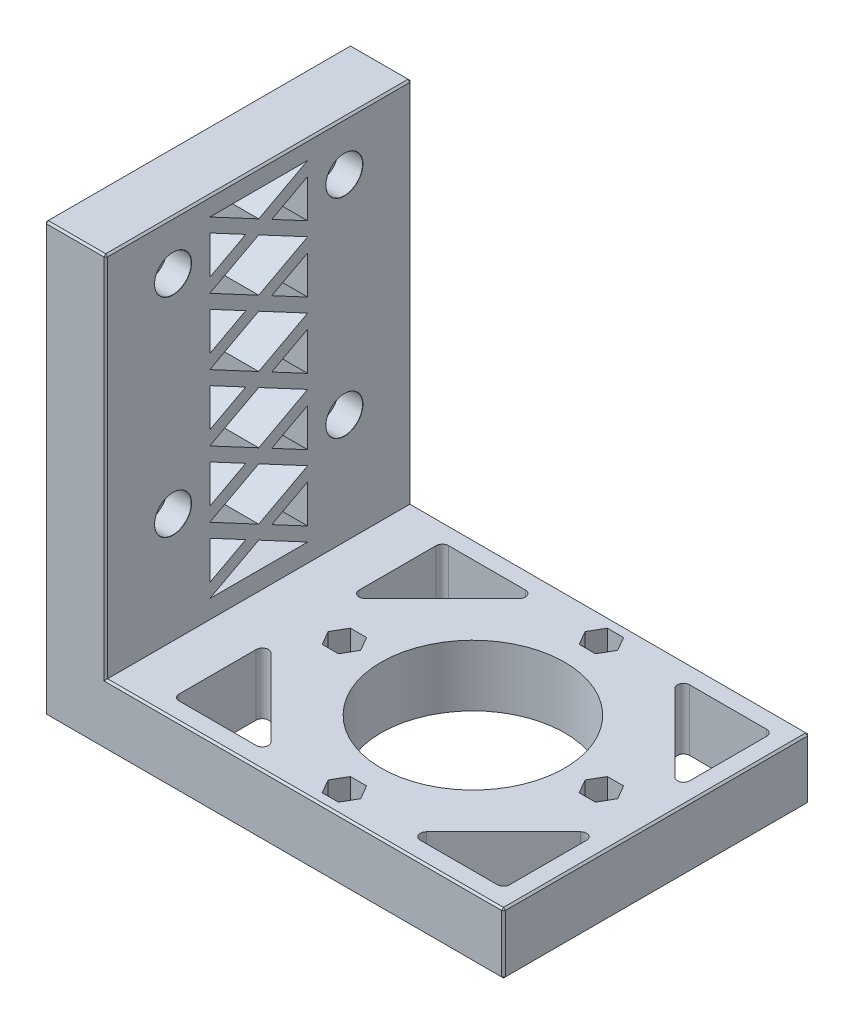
ISO-10303-21;
HEADER;
FILE_DESCRIPTION(('STEP AP214'),'2;1');
FILE_NAME('part.step','',(''),(''),'','','');
FILE_SCHEMA(('AUTOMOTIVE_DESIGN { 1 0 10303 214 1 1 1 1 }'));
ENDSEC;
DATA;
#1=APPLICATION_CONTEXT('core data for automotive mechanical design processes');
#2=APPLICATION_PROTOCOL_DEFINITION('international standard','automotive_design',2000,#1);
#3=PRODUCT_CONTEXT('',#1,'mechanical');
#4=PRODUCT('Part','Part','',(#3));
#5=PRODUCT_RELATED_PRODUCT_CATEGORY('part','',(#4));
#6=PRODUCT_DEFINITION_FORMATION('','',#4);
#7=PRODUCT_DEFINITION_CONTEXT('part definition',#1,'design');
#8=PRODUCT_DEFINITION('design','',#6,#7);
#9=PRODUCT_DEFINITION_SHAPE('','',#8);
#10=(LENGTH_UNIT() NAMED_UNIT(*) SI_UNIT(.MILLI.,.METRE.));
#11=(NAMED_UNIT(*) PLANE_ANGLE_UNIT() SI_UNIT($,.RADIAN.));
#12=(NAMED_UNIT(*) SI_UNIT($,.STERADIAN.) SOLID_ANGLE_UNIT());
#13=UNCERTAINTY_MEASURE_WITH_UNIT(LENGTH_MEASURE(1.E-05),#10,'distance_accuracy_value','');
#14=(GEOMETRIC_REPRESENTATION_CONTEXT(3) GLOBAL_UNCERTAINTY_ASSIGNED_CONTEXT((#13)) GLOBAL_UNIT_ASSIGNED_CONTEXT((#10,
#11,#12)) REPRESENTATION_CONTEXT('',''));
#15=CARTESIAN_POINT('',(0.,0.,0.));
#16=DIRECTION('',(0.,0.,1.));
#17=DIRECTION('',(1.,0.,0.));
#18=AXIS2_PLACEMENT_3D('',#15,#16,#17);
#19=CARTESIAN_POINT('',(0.,13.,8.));
#20=DIRECTION('',(0.,0.,1.));
#21=DIRECTION('',(1.,0.,0.));
#22=AXIS2_PLACEMENT_3D('',#19,#20,#21);
#23=PLANE('',#22);
#24=DIRECTION('',(1.,0.,0.));
#25=VECTOR('',#24,1.);
#26=CARTESIAN_POINT('',(-19.303885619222,15.2666666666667,8.));
#27=LINE('',#26,#25);
#28=CARTESIAN_POINT('',(0.,15.2666666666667,8.));
#29=VERTEX_POINT('',#28);
#30=CARTESIAN_POINT('',(10.,15.2666666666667,8.));
#31=VERTEX_POINT('',#30);
#32=EDGE_CURVE('E1247',#29,#31,#27,.T.);
#33=ORIENTED_EDGE('',*,*,#32,.F.);
#34=DIRECTION('',(0.,-1.,0.));
#35=VECTOR('',#34,1.);
#36=CARTESIAN_POINT('',(0.,13.,8.));
#37=LINE('',#36,#35);
#38=CARTESIAN_POINT('',(0.,21.5333333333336,7.99999999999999));
#39=VERTEX_POINT('',#38);
#40=EDGE_CURVE('E1563',#39,#29,#37,.T.);
#41=ORIENTED_EDGE('',*,*,#40,.F.);
#42=DIRECTION('',(1.,0.,0.));
#43=VECTOR('',#42,1.);
#44=CARTESIAN_POINT('',(-19.3038856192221,21.5333333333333,8.));
#45=LINE('',#44,#43);
#46=CARTESIAN_POINT('',(10.,21.5333333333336,8.));
#47=VERTEX_POINT('',#46);
#48=EDGE_CURVE('E1252',#39,#47,#45,.T.);
#49=ORIENTED_EDGE('',*,*,#48,.T.);
#50=DIRECTION('',(0.,-1.,0.));
#51=VECTOR('',#50,1.);
#52=CARTESIAN_POINT('',(10.,13.,8.));
#53=LINE('',#52,#51);
#54=EDGE_CURVE('E1517',#47,#31,#53,.T.);
#55=ORIENTED_EDGE('',*,*,#54,.T.);
#56=EDGE_LOOP('',(#33,#41,#49,#55));
#57=FACE_BOUND('',#56,.T.);
#58=ADVANCED_FACE('F329',(#57),#23,.F.);
#59=CARTESIAN_POINT('',(0.,13.,-8.));
#60=DIRECTION('',(0.,0.,-1.));
#61=DIRECTION('',(-1.,0.,0.));
#62=AXIS2_PLACEMENT_3D('',#59,#60,#61);
#63=PLANE('',#62);
#64=DIRECTION('',(0.,1.,0.));
#65=VECTOR('',#64,1.);
#66=CARTESIAN_POINT('',(0.,13.,-8.));
#67=LINE('',#66,#65);
#68=CARTESIAN_POINT('',(0.,15.266666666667,-7.99999999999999));
#69=VERTEX_POINT('',#68);
#70=CARTESIAN_POINT('',(0.,21.5333333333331,-7.99999999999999));
#71=VERTEX_POINT('',#70);
#72=EDGE_CURVE('E1573',#69,#71,#67,.T.);
#73=ORIENTED_EDGE('',*,*,#72,.F.);
#74=DIRECTION('',(1.,0.,0.));
#75=VECTOR('',#74,1.);
#76=CARTESIAN_POINT('',(-19.303885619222,15.2666666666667,-8.));
#77=LINE('',#76,#75);
#78=CARTESIAN_POINT('',(10.,15.266666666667,-8.));
#79=VERTEX_POINT('',#78);
#80=EDGE_CURVE('E1259',#69,#79,#77,.T.);
#81=ORIENTED_EDGE('',*,*,#80,.T.);
#82=DIRECTION('',(0.,1.,0.));
#83=VECTOR('',#82,1.);
#84=CARTESIAN_POINT('',(10.,13.,-8.));
#85=LINE('',#84,#83);
#86=CARTESIAN_POINT('',(10.,21.5333333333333,-8.));
#87=VERTEX_POINT('',#86);
#88=EDGE_CURVE('E1588',#79,#87,#85,.T.);
#89=ORIENTED_EDGE('',*,*,#88,.T.);
#90=DIRECTION('',(1.,0.,0.));
#91=VECTOR('',#90,1.);
#92=CARTESIAN_POINT('',(-19.3038856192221,21.5333333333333,-8.));
#93=LINE('',#92,#91);
#94=EDGE_CURVE('E1264',#71,#87,#93,.T.);
#95=ORIENTED_EDGE('',*,*,#94,.F.);
#96=EDGE_LOOP('',(#73,#81,#89,#95));
#97=FACE_BOUND('',#96,.T.);
#98=ADVANCED_FACE('F2088',(#97),#63,.F.);
#99=DIRECTION('',(1.,0.,0.));
#100=VECTOR('',#99,1.);
#101=CARTESIAN_POINT('',(-19.3038856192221,26.0666666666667,8.));
#102=LINE('',#101,#100);
#103=CARTESIAN_POINT('',(0.,26.0666666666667,8.));
#104=VERTEX_POINT('',#103);
#105=CARTESIAN_POINT('',(10.,26.0666666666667,8.));
#106=VERTEX_POINT('',#105);
#107=EDGE_CURVE('E1305',#104,#106,#102,.T.);
#108=ORIENTED_EDGE('',*,*,#107,.F.);
#109=CARTESIAN_POINT('',(0.,32.3333333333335,8.00000000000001));
#110=VERTEX_POINT('',#109);
#111=EDGE_CURVE('E1566',#110,#104,#37,.T.);
#112=ORIENTED_EDGE('',*,*,#111,.F.);
#113=DIRECTION('',(1.,0.,0.));
#114=VECTOR('',#113,1.);
#115=CARTESIAN_POINT('',(-19.3038856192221,32.3333333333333,8.));
#116=LINE('',#115,#114);
#117=CARTESIAN_POINT('',(9.99999999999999,32.3333333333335,8.00000000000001));
#118=VERTEX_POINT('',#117);
#119=EDGE_CURVE('E1310',#110,#118,#116,.T.);
#120=ORIENTED_EDGE('',*,*,#119,.T.);
#121=EDGE_CURVE('E1583',#118,#106,#53,.T.);
#122=ORIENTED_EDGE('',*,*,#121,.T.);
#123=EDGE_LOOP('',(#108,#112,#120,#122));
#124=FACE_BOUND('',#123,.T.);
#125=ADVANCED_FACE('F2091',(#124),#23,.F.);
#126=CARTESIAN_POINT('',(0.,26.0666666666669,-8.));
#127=VERTEX_POINT('',#126);
#128=CARTESIAN_POINT('',(0.,32.3333333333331,-7.99999999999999));
#129=VERTEX_POINT('',#128);
#130=EDGE_CURVE('E1577',#127,#129,#67,.T.);
#131=ORIENTED_EDGE('',*,*,#130,.F.);
#132=DIRECTION('',(1.,0.,0.));
#133=VECTOR('',#132,1.);
#134=CARTESIAN_POINT('',(-19.3038856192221,26.0666666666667,-8.));
#135=LINE('',#134,#133);
#136=CARTESIAN_POINT('',(10.,26.0666666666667,-8.));
#137=VERTEX_POINT('',#136);
#138=EDGE_CURVE('E1323',#127,#137,#135,.T.);
#139=ORIENTED_EDGE('',*,*,#138,.T.);
#140=CARTESIAN_POINT('',(10.,32.3333333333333,-8.));
#141=VERTEX_POINT('',#140);
#142=EDGE_CURVE('E1591',#137,#141,#85,.T.);
#143=ORIENTED_EDGE('',*,*,#142,.T.);
#144=DIRECTION('',(1.,0.,0.));
#145=VECTOR('',#144,1.);
#146=CARTESIAN_POINT('',(-19.3038856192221,32.3333333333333,-8.));
#147=LINE('',#146,#145);
#148=EDGE_CURVE('E1329',#129,#141,#147,.T.);
#149=ORIENTED_EDGE('',*,*,#148,.F.);
#150=EDGE_LOOP('',(#131,#139,#143,#149));
#151=FACE_BOUND('',#150,.T.);
#152=ADVANCED_FACE('F2099',(#151),#63,.F.);
#153=DIRECTION('',(1.,0.,0.));
#154=VECTOR('',#153,1.);
#155=CARTESIAN_POINT('',(-19.3038856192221,36.8666666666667,8.));
#156=LINE('',#155,#154);
#157=CARTESIAN_POINT('',(0.,36.8666666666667,8.));
#158=VERTEX_POINT('',#157);
#159=CARTESIAN_POINT('',(9.99999999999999,36.8666666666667,8.));
#160=VERTEX_POINT('',#159);
#161=EDGE_CURVE('E1370',#158,#160,#156,.T.);
#162=ORIENTED_EDGE('',*,*,#161,.F.);
#163=CARTESIAN_POINT('',(0.,43.1333333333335,8.));
#164=VERTEX_POINT('',#163);
#165=EDGE_CURVE('E2136',#164,#158,#37,.T.);
#166=ORIENTED_EDGE('',*,*,#165,.F.);
#167=DIRECTION('',(1.,0.,0.));
#168=VECTOR('',#167,1.);
#169=CARTESIAN_POINT('',(-19.3038856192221,43.1333333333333,8.));
#170=LINE('',#169,#168);
#171=CARTESIAN_POINT('',(9.99999999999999,43.1333333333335,8.));
#172=VERTEX_POINT('',#171);
#173=EDGE_CURVE('E1375',#164,#172,#170,.T.);
#174=ORIENTED_EDGE('',*,*,#173,.T.);
#175=EDGE_CURVE('E2138',#172,#160,#53,.T.);
#176=ORIENTED_EDGE('',*,*,#175,.T.);
#177=EDGE_LOOP('',(#162,#166,#174,#176));
#178=FACE_BOUND('',#177,.T.);
#179=ADVANCED_FACE('F2106',(#178),#23,.F.);
#180=CARTESIAN_POINT('',(0.,36.8666666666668,-7.99999999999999));
#181=VERTEX_POINT('',#180);
#182=CARTESIAN_POINT('',(0.,43.1333333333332,-7.99999999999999));
#183=VERTEX_POINT('',#182);
#184=EDGE_CURVE('E4374',#181,#183,#67,.T.);
#185=ORIENTED_EDGE('',*,*,#184,.F.);
#186=DIRECTION('',(1.,0.,0.));
#187=VECTOR('',#186,1.);
#188=CARTESIAN_POINT('',(-19.3038856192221,36.8666666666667,-8.));
#189=LINE('',#188,#187);
#190=CARTESIAN_POINT('',(9.99999999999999,36.8666666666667,-8.));
#191=VERTEX_POINT('',#190);
#192=EDGE_CURVE('E1388',#181,#191,#189,.T.);
#193=ORIENTED_EDGE('',*,*,#192,.T.);
#194=CARTESIAN_POINT('',(9.99999999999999,43.1333333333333,-8.));
#195=VERTEX_POINT('',#194);
#196=EDGE_CURVE('E4380',#191,#195,#85,.T.);
#197=ORIENTED_EDGE('',*,*,#196,.T.);
#198=DIRECTION('',(1.,0.,0.));
#199=VECTOR('',#198,1.);
#200=CARTESIAN_POINT('',(-19.3038856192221,43.1333333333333,-8.));
#201=LINE('',#200,#199);
#202=EDGE_CURVE('E1394',#183,#195,#201,.T.);
#203=ORIENTED_EDGE('',*,*,#202,.F.);
#204=EDGE_LOOP('',(#185,#193,#197,#203));
#205=FACE_BOUND('',#204,.T.);
#206=ADVANCED_FACE('F2118',(#205),#63,.F.);
#207=DIRECTION('',(1.,0.,0.));
#208=VECTOR('',#207,1.);
#209=CARTESIAN_POINT('',(-19.3038856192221,47.6666666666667,8.));
#210=LINE('',#209,#208);
#211=CARTESIAN_POINT('',(0.,47.6666666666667,8.));
#212=VERTEX_POINT('',#211);
#213=CARTESIAN_POINT('',(9.99999999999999,47.6666666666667,8.));
#214=VERTEX_POINT('',#213);
#215=EDGE_CURVE('E1435',#212,#214,#210,.T.);
#216=ORIENTED_EDGE('',*,*,#215,.F.);
#217=CARTESIAN_POINT('',(0.,53.9333333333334,8.));
#218=VERTEX_POINT('',#217);
#219=EDGE_CURVE('E2146',#218,#212,#37,.T.);
#220=ORIENTED_EDGE('',*,*,#219,.F.);
#221=DIRECTION('',(1.,0.,0.));
#222=VECTOR('',#221,1.);
#223=CARTESIAN_POINT('',(-19.3038856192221,53.9333333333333,8.));
#224=LINE('',#223,#222);
#225=CARTESIAN_POINT('',(9.99999999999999,53.9333333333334,8.));
#226=VERTEX_POINT('',#225);
#227=EDGE_CURVE('E1440',#218,#226,#224,.T.);
#228=ORIENTED_EDGE('',*,*,#227,.T.);
#229=EDGE_CURVE('E4290',#226,#214,#53,.T.);
#230=ORIENTED_EDGE('',*,*,#229,.T.);
#231=EDGE_LOOP('',(#216,#220,#228,#230));
#232=FACE_BOUND('',#231,.T.);
#233=ADVANCED_FACE('F2110',(#232),#23,.F.);
#234=CARTESIAN_POINT('',(0.,47.6666666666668,-8.));
#235=VERTEX_POINT('',#234);
#236=CARTESIAN_POINT('',(0.,53.9333333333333,-7.99999999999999));
#237=VERTEX_POINT('',#236);
#238=EDGE_CURVE('E4372',#235,#237,#67,.T.);
#239=ORIENTED_EDGE('',*,*,#238,.F.);
#240=DIRECTION('',(1.,0.,0.));
#241=VECTOR('',#240,1.);
#242=CARTESIAN_POINT('',(-19.3038856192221,47.6666666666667,-8.));
#243=LINE('',#242,#241);
#244=CARTESIAN_POINT('',(9.99999999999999,47.6666666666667,-8.));
#245=VERTEX_POINT('',#244);
#246=EDGE_CURVE('E1453',#235,#245,#243,.T.);
#247=ORIENTED_EDGE('',*,*,#246,.T.);
#248=CARTESIAN_POINT('',(9.99999999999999,53.9333333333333,-8.));
#249=VERTEX_POINT('',#248);
#250=EDGE_CURVE('E4381',#245,#249,#85,.T.);
#251=ORIENTED_EDGE('',*,*,#250,.T.);
#252=DIRECTION('',(1.,0.,0.));
#253=VECTOR('',#252,1.);
#254=CARTESIAN_POINT('',(-19.3038856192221,53.9333333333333,-8.));
#255=LINE('',#254,#253);
#256=EDGE_CURVE('E1459',#237,#249,#255,.T.);
#257=ORIENTED_EDGE('',*,*,#256,.F.);
#258=EDGE_LOOP('',(#239,#247,#251,#257));
#259=FACE_BOUND('',#258,.T.);
#260=ADVANCED_FACE('F2108',(#259),#63,.F.);
#261=DIRECTION('',(1.,0.,0.));
#262=VECTOR('',#261,1.);
#263=CARTESIAN_POINT('',(-19.3038856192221,58.4666666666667,8.));
#264=LINE('',#263,#262);
#265=CARTESIAN_POINT('',(0.,58.4666666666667,8.));
#266=VERTEX_POINT('',#265);
#267=CARTESIAN_POINT('',(9.99999999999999,58.4666666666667,8.));
#268=VERTEX_POINT('',#267);
#269=EDGE_CURVE('E1559',#266,#268,#264,.T.);
#270=ORIENTED_EDGE('',*,*,#269,.F.);
#271=CARTESIAN_POINT('',(0.,64.7333333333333,8.));
#272=VERTEX_POINT('',#271);
#273=EDGE_CURVE('E1568',#272,#266,#37,.T.);
#274=ORIENTED_EDGE('',*,*,#273,.F.);
#275=DIRECTION('',(1.,0.,0.));
#276=VECTOR('',#275,1.);
#277=CARTESIAN_POINT('',(-19.3038856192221,64.7333333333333,8.));
#278=LINE('',#277,#276);
#279=CARTESIAN_POINT('',(9.99999999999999,64.7333333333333,8.));
#280=VERTEX_POINT('',#279);
#281=EDGE_CURVE('E1540',#272,#280,#278,.T.);
#282=ORIENTED_EDGE('',*,*,#281,.T.);
#283=EDGE_CURVE('E1584',#280,#268,#53,.T.);
#284=ORIENTED_EDGE('',*,*,#283,.T.);
#285=EDGE_LOOP('',(#270,#274,#282,#284));
#286=FACE_BOUND('',#285,.T.);
#287=ADVANCED_FACE('F2092',(#286),#23,.F.);
#288=CARTESIAN_POINT('',(0.,58.4666666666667,-8.));
#289=VERTEX_POINT('',#288);
#290=CARTESIAN_POINT('',(0.,64.7333333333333,-7.99999999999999));
#291=VERTEX_POINT('',#290);
#292=EDGE_CURVE('E1572',#289,#291,#67,.T.);
#293=ORIENTED_EDGE('',*,*,#292,.F.);
#294=DIRECTION('',(1.,0.,0.));
#295=VECTOR('',#294,1.);
#296=CARTESIAN_POINT('',(-19.3038856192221,58.4666666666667,-8.));
#297=LINE('',#296,#295);
#298=CARTESIAN_POINT('',(9.99999999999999,58.4666666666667,-8.));
#299=VERTEX_POINT('',#298);
#300=EDGE_CURVE('E1548',#289,#299,#297,.T.);
#301=ORIENTED_EDGE('',*,*,#300,.T.);
#302=CARTESIAN_POINT('',(9.99999999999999,64.7333333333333,-8.));
#303=VERTEX_POINT('',#302);
#304=EDGE_CURVE('E1587',#299,#303,#85,.T.);
#305=ORIENTED_EDGE('',*,*,#304,.T.);
#306=DIRECTION('',(1.,0.,0.));
#307=VECTOR('',#306,1.);
#308=CARTESIAN_POINT('',(-19.3038856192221,64.7333333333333,-8.));
#309=LINE('',#308,#307);
#310=EDGE_CURVE('E1544',#291,#303,#309,.T.);
#311=ORIENTED_EDGE('',*,*,#310,.F.);
#312=EDGE_LOOP('',(#293,#301,#305,#311));
#313=FACE_BOUND('',#312,.T.);
#314=ADVANCED_FACE('F2100',(#313),#63,.F.);
#315=CARTESIAN_POINT('',(10.,9.99999999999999,25.));
#316=DIRECTION('',(-1.,0.,0.));
#317=DIRECTION('',(0.,-1.,0.));
#318=AXIS2_PLACEMENT_3D('',#315,#316,#317);
#319=PLANE('',#318);
#320=DIRECTION('',(0.,0.470588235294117,-0.882352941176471));
#321=VECTOR('',#320,1.);
#322=CARTESIAN_POINT('',(10.,15.2076124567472,8.11072664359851));
#323=LINE('',#322,#321);
#324=CARTESIAN_POINT('',(10.,18.4,2.12499999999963));
#325=VERTEX_POINT('',#324);
#326=EDGE_CURVE('E1254',#31,#325,#323,.T.);
#327=ORIENTED_EDGE('',*,*,#326,.F.);
#328=ORIENTED_EDGE('',*,*,#54,.F.);
#329=DIRECTION('',(0.,-0.470588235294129,-0.882352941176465));
#330=VECTOR('',#329,1.);
#331=CARTESIAN_POINT('',(10.,13.4429065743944,-7.16955017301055));
#332=LINE('',#331,#330);
#333=EDGE_CURVE('E1242',#47,#325,#332,.T.);
#334=ORIENTED_EDGE('',*,*,#333,.T.);
#335=EDGE_LOOP('',(#327,#328,#334));
#336=FACE_BOUND('',#335,.T.);
#337=ORIENTED_EDGE('',*,*,#88,.F.);
#338=DIRECTION('',(0.,0.470588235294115,0.882352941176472));
#339=VECTOR('',#338,1.);
#340=CARTESIAN_POINT('',(10.,15.2076124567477,-8.1107266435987));
#341=LINE('',#340,#339);
#342=CARTESIAN_POINT('',(10.,18.4,-2.12500000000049));
#343=VERTEX_POINT('',#342);
#344=EDGE_CURVE('E1274',#79,#343,#341,.T.);
#345=ORIENTED_EDGE('',*,*,#344,.T.);
#346=DIRECTION('',(0.,-0.470588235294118,0.882352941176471));
#347=VECTOR('',#346,1.);
#348=CARTESIAN_POINT('',(10.,13.4429065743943,7.16955017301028));
#349=LINE('',#348,#347);
#350=EDGE_CURVE('E1266',#87,#343,#349,.T.);
#351=ORIENTED_EDGE('',*,*,#350,.F.);
#352=EDGE_LOOP('',(#337,#345,#351));
#353=FACE_BOUND('',#352,.T.);
#354=DIRECTION('',(0.,-0.470588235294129,-0.882352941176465));
#355=VECTOR('',#354,1.);
#356=CARTESIAN_POINT('',(10.,13.4429065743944,-7.16955017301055));
#357=LINE('',#356,#355);
#358=CARTESIAN_POINT('',(10.,17.2666666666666,-3.44342609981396E-13));
#359=VERTEX_POINT('',#358);
#360=CARTESIAN_POINT('',(10.,13.,-8.));
#361=VERTEX_POINT('',#360);
#362=EDGE_CURVE('E1280',#359,#361,#357,.T.);
#363=ORIENTED_EDGE('',*,*,#362,.T.);
#364=DIRECTION('',(0.,0.,-1.));
#365=VECTOR('',#364,1.);
#366=CARTESIAN_POINT('',(10.,13.,-8.));
#367=LINE('',#366,#365);
#368=CARTESIAN_POINT('',(10.,13.,8.));
#369=VERTEX_POINT('',#368);
#370=EDGE_CURVE('E1585',#369,#361,#367,.T.);
#371=ORIENTED_EDGE('',*,*,#370,.F.);
#372=DIRECTION('',(0.,-0.470588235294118,0.882352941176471));
#373=VECTOR('',#372,1.);
#374=CARTESIAN_POINT('',(10.,13.4429065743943,7.16955017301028));
#375=LINE('',#374,#373);
#376=EDGE_CURVE('E1257',#359,#369,#375,.T.);
#377=ORIENTED_EDGE('',*,*,#376,.F.);
#378=EDGE_LOOP('',(#363,#371,#377));
#379=FACE_BOUND('',#378,.T.);
#380=DIRECTION('',(0.,0.470588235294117,-0.882352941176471));
#381=VECTOR('',#380,1.);
#382=CARTESIAN_POINT('',(10.,23.6159169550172,12.5951557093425));
#383=LINE('',#382,#381);
#384=CARTESIAN_POINT('',(10.,29.2,2.12499999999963));
#385=VERTEX_POINT('',#384);
#386=EDGE_CURVE('E1312',#106,#385,#383,.T.);
#387=ORIENTED_EDGE('',*,*,#386,.F.);
#388=ORIENTED_EDGE('',*,*,#121,.F.);
#389=DIRECTION('',(0.,-0.470588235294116,-0.882352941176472));
#390=VECTOR('',#389,1.);
#391=CARTESIAN_POINT('',(10.,21.8512110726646,-11.6539792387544));
#392=LINE('',#391,#390);
#393=EDGE_CURVE('E1300',#118,#385,#392,.T.);
#394=ORIENTED_EDGE('',*,*,#393,.T.);
#395=EDGE_LOOP('',(#387,#388,#394));
#396=FACE_BOUND('',#395,.T.);
#397=DIRECTION('',(0.,-0.470588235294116,-0.882352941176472));
#398=VECTOR('',#397,1.);
#399=CARTESIAN_POINT('',(10.,21.8512110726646,-11.6539792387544));
#400=LINE('',#399,#398);
#401=CARTESIAN_POINT('',(10.,28.0666666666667,-3.65159291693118E-13));
#402=VERTEX_POINT('',#401);
#403=CARTESIAN_POINT('',(10.,23.8000000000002,-8.));
#404=VERTEX_POINT('',#403);
#405=EDGE_CURVE('E1345',#402,#404,#400,.T.);
#406=ORIENTED_EDGE('',*,*,#405,.T.);
#407=DIRECTION('',(0.,0.470588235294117,-0.882352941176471));
#408=VECTOR('',#407,1.);
#409=CARTESIAN_POINT('',(10.,15.2076124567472,8.11072664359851));
#410=LINE('',#409,#408);
#411=CARTESIAN_POINT('',(10.,19.5333333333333,-4.81385764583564E-13));
#412=VERTEX_POINT('',#411);
#413=EDGE_CURVE('E1269',#412,#404,#410,.T.);
#414=ORIENTED_EDGE('',*,*,#413,.F.);
#415=DIRECTION('',(0.,0.470588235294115,0.882352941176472));
#416=VECTOR('',#415,1.);
#417=CARTESIAN_POINT('',(10.,15.2076124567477,-8.1107266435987));
#418=LINE('',#417,#416);
#419=CARTESIAN_POINT('',(10.,23.7999999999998,8.));
#420=VERTEX_POINT('',#419);
#421=EDGE_CURVE('E1248',#412,#420,#418,.T.);
#422=ORIENTED_EDGE('',*,*,#421,.T.);
#423=DIRECTION('',(0.,-0.470588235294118,0.882352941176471));
#424=VECTOR('',#423,1.);
#425=CARTESIAN_POINT('',(10.,21.8512110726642,11.6539792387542));
#426=LINE('',#425,#424);
#427=EDGE_CURVE('E1319',#402,#420,#426,.T.);
#428=ORIENTED_EDGE('',*,*,#427,.F.);
#429=EDGE_LOOP('',(#406,#414,#422,#428));
#430=FACE_BOUND('',#429,.T.);
#431=DIRECTION('',(0.,-0.470588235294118,0.882352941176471));
#432=VECTOR('',#431,1.);
#433=CARTESIAN_POINT('',(10.,21.8512110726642,11.6539792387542));
#434=LINE('',#433,#432);
#435=CARTESIAN_POINT('',(10.,29.2,-2.12500000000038));
#436=VERTEX_POINT('',#435);
#437=EDGE_CURVE('E1331',#141,#436,#434,.T.);
#438=ORIENTED_EDGE('',*,*,#437,.F.);
#439=ORIENTED_EDGE('',*,*,#142,.F.);
#440=DIRECTION('',(0.,0.470588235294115,0.882352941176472));
#441=VECTOR('',#440,1.);
#442=CARTESIAN_POINT('',(10.,23.6159169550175,-12.5951557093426));
#443=LINE('',#442,#441);
#444=EDGE_CURVE('E1339',#137,#436,#443,.T.);
#445=ORIENTED_EDGE('',*,*,#444,.T.);
#446=EDGE_LOOP('',(#438,#439,#445));
#447=FACE_BOUND('',#446,.T.);
#448=DIRECTION('',(0.,0.470588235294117,-0.882352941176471));
#449=VECTOR('',#448,1.);
#450=CARTESIAN_POINT('',(10.,32.0242214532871,17.0795847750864));
#451=LINE('',#450,#449);
#452=CARTESIAN_POINT('',(9.99999999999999,40.,2.12499999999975));
#453=VERTEX_POINT('',#452);
#454=EDGE_CURVE('E1377',#160,#453,#451,.T.);
#455=ORIENTED_EDGE('',*,*,#454,.F.);
#456=ORIENTED_EDGE('',*,*,#175,.F.);
#457=DIRECTION('',(0.,-0.470588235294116,-0.882352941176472));
#458=VECTOR('',#457,1.);
#459=CARTESIAN_POINT('',(10.,30.2595155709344,-16.1384083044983));
#460=LINE('',#459,#458);
#461=EDGE_CURVE('E1365',#172,#453,#460,.T.);
#462=ORIENTED_EDGE('',*,*,#461,.T.);
#463=EDGE_LOOP('',(#455,#456,#462));
#464=FACE_BOUND('',#463,.T.);
#465=DIRECTION('',(0.,-0.470588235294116,-0.882352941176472));
#466=VECTOR('',#465,1.);
#467=CARTESIAN_POINT('',(10.,30.2595155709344,-16.1384083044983));
#468=LINE('',#467,#466);
#469=CARTESIAN_POINT('',(9.99999999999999,38.8666666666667,-2.65412691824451E-13));
#470=VERTEX_POINT('',#469);
#471=CARTESIAN_POINT('',(9.99999999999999,34.6000000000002,-8.));
#472=VERTEX_POINT('',#471);
#473=EDGE_CURVE('E1410',#470,#472,#468,.T.);
#474=ORIENTED_EDGE('',*,*,#473,.T.);
#475=DIRECTION('',(0.,0.470588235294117,-0.882352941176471));
#476=VECTOR('',#475,1.);
#477=CARTESIAN_POINT('',(10.,23.6159169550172,12.5951557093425));
#478=LINE('',#477,#476);
#479=CARTESIAN_POINT('',(10.,30.3333333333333,-3.84241249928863E-13));
#480=VERTEX_POINT('',#479);
#481=EDGE_CURVE('E1334',#480,#472,#478,.T.);
#482=ORIENTED_EDGE('',*,*,#481,.F.);
#483=DIRECTION('',(0.,0.470588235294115,0.882352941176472));
#484=VECTOR('',#483,1.);
#485=CARTESIAN_POINT('',(10.,23.6159169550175,-12.5951557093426));
#486=LINE('',#485,#484);
#487=CARTESIAN_POINT('',(9.99999999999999,34.5999999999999,8.00000000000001));
#488=VERTEX_POINT('',#487);
#489=EDGE_CURVE('E1306',#480,#488,#486,.T.);
#490=ORIENTED_EDGE('',*,*,#489,.T.);
#491=DIRECTION('',(0.,-0.470588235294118,0.882352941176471));
#492=VECTOR('',#491,1.);
#493=CARTESIAN_POINT('',(10.,30.2595155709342,16.1384083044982));
#494=LINE('',#493,#492);
#495=EDGE_CURVE('E1384',#470,#488,#494,.T.);
#496=ORIENTED_EDGE('',*,*,#495,.F.);
#497=EDGE_LOOP('',(#474,#482,#490,#496));
#498=FACE_BOUND('',#497,.T.);
#499=DIRECTION('',(0.,-0.470588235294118,0.882352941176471));
#500=VECTOR('',#499,1.);
#501=CARTESIAN_POINT('',(10.,30.2595155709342,16.1384083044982));
#502=LINE('',#501,#500);
#503=CARTESIAN_POINT('',(9.99999999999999,40.,-2.12500000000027));
#504=VERTEX_POINT('',#503);
#505=EDGE_CURVE('E1396',#195,#504,#502,.T.);
#506=ORIENTED_EDGE('',*,*,#505,.F.);
#507=ORIENTED_EDGE('',*,*,#196,.F.);
#508=DIRECTION('',(0.,0.470588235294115,0.882352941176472));
#509=VECTOR('',#508,1.);
#510=CARTESIAN_POINT('',(10.,32.0242214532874,-17.0795847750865));
#511=LINE('',#510,#509);
#512=EDGE_CURVE('E1404',#191,#504,#511,.T.);
#513=ORIENTED_EDGE('',*,*,#512,.T.);
#514=EDGE_LOOP('',(#506,#507,#513));
#515=FACE_BOUND('',#514,.T.);
#516=DIRECTION('',(0.,0.470588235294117,-0.882352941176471));
#517=VECTOR('',#516,1.);
#518=CARTESIAN_POINT('',(9.99999999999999,40.4325259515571,21.5640138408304));
#519=LINE('',#518,#517);
#520=CARTESIAN_POINT('',(9.99999999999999,50.8,2.12499999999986));
#521=VERTEX_POINT('',#520);
#522=EDGE_CURVE('E1442',#214,#521,#519,.T.);
#523=ORIENTED_EDGE('',*,*,#522,.F.);
#524=ORIENTED_EDGE('',*,*,#229,.F.);
#525=DIRECTION('',(0.,-0.470588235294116,-0.882352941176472));
#526=VECTOR('',#525,1.);
#527=CARTESIAN_POINT('',(9.99999999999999,38.6678200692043,-20.6228373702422));
#528=LINE('',#527,#526);
#529=EDGE_CURVE('E1430',#226,#521,#528,.T.);
#530=ORIENTED_EDGE('',*,*,#529,.T.);
#531=EDGE_LOOP('',(#523,#524,#530));
#532=FACE_BOUND('',#531,.T.);
#533=DIRECTION('',(0.,-0.470588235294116,-0.882352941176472));
#534=VECTOR('',#533,1.);
#535=CARTESIAN_POINT('',(9.99999999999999,38.6678200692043,-20.6228373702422));
#536=LINE('',#535,#534);
#537=CARTESIAN_POINT('',(9.99999999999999,49.6666666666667,-1.59594559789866E-13));
#538=VERTEX_POINT('',#537);
#539=CARTESIAN_POINT('',(9.99999999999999,45.4000000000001,-8.));
#540=VERTEX_POINT('',#539);
#541=EDGE_CURVE('E1475',#538,#540,#536,.T.);
#542=ORIENTED_EDGE('',*,*,#541,.T.);
#543=DIRECTION('',(0.,0.470588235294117,-0.882352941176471));
#544=VECTOR('',#543,1.);
#545=CARTESIAN_POINT('',(10.,32.0242214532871,17.0795847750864));
#546=LINE('',#545,#544);
#547=CARTESIAN_POINT('',(9.99999999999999,41.1333333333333,-2.63677968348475E-13));
#548=VERTEX_POINT('',#547);
#549=EDGE_CURVE('E1399',#548,#540,#546,.T.);
#550=ORIENTED_EDGE('',*,*,#549,.F.);
#551=DIRECTION('',(0.,0.470588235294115,0.882352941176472));
#552=VECTOR('',#551,1.);
#553=CARTESIAN_POINT('',(10.,32.0242214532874,-17.0795847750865));
#554=LINE('',#553,#552);
#555=CARTESIAN_POINT('',(9.99999999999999,45.3999999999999,8.));
#556=VERTEX_POINT('',#555);
#557=EDGE_CURVE('E1371',#548,#556,#554,.T.);
#558=ORIENTED_EDGE('',*,*,#557,.T.);
#559=DIRECTION('',(0.,-0.470588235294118,0.882352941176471));
#560=VECTOR('',#559,1.);
#561=CARTESIAN_POINT('',(9.99999999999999,38.6678200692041,20.6228373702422));
#562=LINE('',#561,#560);
#563=EDGE_CURVE('E1449',#538,#556,#562,.T.);
#564=ORIENTED_EDGE('',*,*,#563,.F.);
#565=EDGE_LOOP('',(#542,#550,#558,#564));
#566=FACE_BOUND('',#565,.T.);
#567=DIRECTION('',(0.,-0.470588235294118,0.882352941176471));
#568=VECTOR('',#567,1.);
#569=CARTESIAN_POINT('',(9.99999999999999,38.6678200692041,20.6228373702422));
#570=LINE('',#569,#568);
#571=CARTESIAN_POINT('',(9.99999999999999,50.8,-2.12500000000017));
#572=VERTEX_POINT('',#571);
#573=EDGE_CURVE('E1461',#249,#572,#570,.T.);
#574=ORIENTED_EDGE('',*,*,#573,.F.);
#575=ORIENTED_EDGE('',*,*,#250,.F.);
#576=DIRECTION('',(0.,0.470588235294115,0.882352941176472));
#577=VECTOR('',#576,1.);
#578=CARTESIAN_POINT('',(9.99999999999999,40.4325259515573,-21.5640138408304));
#579=LINE('',#578,#577);
#580=EDGE_CURVE('E1469',#245,#572,#579,.T.);
#581=ORIENTED_EDGE('',*,*,#580,.T.);
#582=EDGE_LOOP('',(#574,#575,#581));
#583=FACE_BOUND('',#582,.T.);
#584=DIRECTION('',(0.,0.470588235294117,-0.882352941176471));
#585=VECTOR('',#584,1.);
#586=CARTESIAN_POINT('',(9.99999999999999,48.840830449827,26.0484429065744));
#587=LINE('',#586,#585);
#588=CARTESIAN_POINT('',(9.99999999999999,61.6,2.12499999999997));
#589=VERTEX_POINT('',#588);
#590=EDGE_CURVE('E1520',#268,#589,#587,.T.);
#591=ORIENTED_EDGE('',*,*,#590,.F.);
#592=ORIENTED_EDGE('',*,*,#283,.F.);
#593=DIRECTION('',(0.,-0.470588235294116,-0.882352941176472));
#594=VECTOR('',#593,1.);
#595=CARTESIAN_POINT('',(9.99999999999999,47.0761245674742,-25.1072664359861));
#596=LINE('',#595,#594);
#597=EDGE_CURVE('E1495',#280,#589,#596,.T.);
#598=ORIENTED_EDGE('',*,*,#597,.T.);
#599=EDGE_LOOP('',(#591,#592,#598));
#600=FACE_BOUND('',#599,.T.);
#601=DIRECTION('',(0.,-0.470588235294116,-0.882352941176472));
#602=VECTOR('',#601,1.);
#603=CARTESIAN_POINT('',(9.99999999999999,47.0761245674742,-25.1072664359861));
#604=LINE('',#603,#602);
#605=CARTESIAN_POINT('',(9.99999999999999,60.4666666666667,0.));
#606=VERTEX_POINT('',#605);
#607=CARTESIAN_POINT('',(9.99999999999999,56.2,-8.));
#608=VERTEX_POINT('',#607);
#609=EDGE_CURVE('E1525',#606,#608,#604,.T.);
#610=ORIENTED_EDGE('',*,*,#609,.T.);
#611=DIRECTION('',(0.,0.470588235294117,-0.882352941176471));
#612=VECTOR('',#611,1.);
#613=CARTESIAN_POINT('',(9.99999999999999,40.4325259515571,21.5640138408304));
#614=LINE('',#613,#612);
#615=CARTESIAN_POINT('',(9.99999999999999,51.9333333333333,-1.40512601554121E-13));
#616=VERTEX_POINT('',#615);
#617=EDGE_CURVE('E1464',#616,#608,#614,.T.);
#618=ORIENTED_EDGE('',*,*,#617,.F.);
#619=DIRECTION('',(0.,0.470588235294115,0.882352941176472));
#620=VECTOR('',#619,1.);
#621=CARTESIAN_POINT('',(9.99999999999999,40.4325259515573,-21.5640138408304));
#622=LINE('',#621,#620);
#623=CARTESIAN_POINT('',(9.99999999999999,56.2,8.));
#624=VERTEX_POINT('',#623);
#625=EDGE_CURVE('E1436',#616,#624,#622,.T.);
#626=ORIENTED_EDGE('',*,*,#625,.T.);
#627=DIRECTION('',(0.,-0.470588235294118,0.882352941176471));
#628=VECTOR('',#627,1.);
#629=CARTESIAN_POINT('',(9.99999999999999,47.076124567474,25.1072664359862));
#630=LINE('',#629,#628);
#631=EDGE_CURVE('E1523',#606,#624,#630,.T.);
#632=ORIENTED_EDGE('',*,*,#631,.F.);
#633=EDGE_LOOP('',(#610,#618,#626,#632));
#634=FACE_BOUND('',#633,.T.);
#635=DIRECTION('',(0.,-0.470588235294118,0.882352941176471));
#636=VECTOR('',#635,1.);
#637=CARTESIAN_POINT('',(9.99999999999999,47.076124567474,25.1072664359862));
#638=LINE('',#637,#636);
#639=CARTESIAN_POINT('',(9.99999999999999,61.6,-2.12500000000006));
#640=VERTEX_POINT('',#639);
#641=EDGE_CURVE('E1531',#303,#640,#638,.T.);
#642=ORIENTED_EDGE('',*,*,#641,.F.);
#643=ORIENTED_EDGE('',*,*,#304,.F.);
#644=DIRECTION('',(0.,0.470588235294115,0.882352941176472));
#645=VECTOR('',#644,1.);
#646=CARTESIAN_POINT('',(9.99999999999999,48.8408304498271,-26.0484429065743));
#647=LINE('',#646,#645);
#648=EDGE_CURVE('E1528',#299,#640,#647,.T.);
#649=ORIENTED_EDGE('',*,*,#648,.T.);
#650=EDGE_LOOP('',(#642,#643,#649));
#651=FACE_BOUND('',#650,.T.);
#652=DIRECTION('',(0.,0.470588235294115,0.882352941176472));
#653=VECTOR('',#652,1.);
#654=CARTESIAN_POINT('',(9.99999999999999,48.8408304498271,-26.0484429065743));
#655=LINE('',#654,#653);
#656=CARTESIAN_POINT('',(9.99999999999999,62.7333333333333,0.));
#657=VERTEX_POINT('',#656);
#658=CARTESIAN_POINT('',(9.99999999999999,67.,8.));
#659=VERTEX_POINT('',#658);
#660=EDGE_CURVE('E1536',#657,#659,#655,.T.);
#661=ORIENTED_EDGE('',*,*,#660,.T.);
#662=DIRECTION('',(0.,0.,1.));
#663=VECTOR('',#662,1.);
#664=CARTESIAN_POINT('',(9.99999999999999,67.,-8.));
#665=LINE('',#664,#663);
#666=CARTESIAN_POINT('',(9.99999999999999,67.,-8.));
#667=VERTEX_POINT('',#666);
#668=EDGE_CURVE('E1567',#667,#659,#665,.T.);
#669=ORIENTED_EDGE('',*,*,#668,.F.);
#670=DIRECTION('',(0.,0.470588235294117,-0.882352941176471));
#671=VECTOR('',#670,1.);
#672=CARTESIAN_POINT('',(9.99999999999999,48.840830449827,26.0484429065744));
#673=LINE('',#672,#671);
#674=EDGE_CURVE('E1534',#657,#667,#673,.T.);
#675=ORIENTED_EDGE('',*,*,#674,.F.);
#676=EDGE_LOOP('',(#661,#669,#675));
#677=FACE_BOUND('',#676,.T.);
#678=CARTESIAN_POINT('',(10.,28.,-14.));
#679=DIRECTION('',(1.,0.,0.));
#680=DIRECTION('',(0.,0.,-1.));
#681=AXIS2_PLACEMENT_3D('',#678,#679,#680);
#682=CIRCLE('',#681,3.025);
#683=CARTESIAN_POINT('',(10.,28.,-17.025));
#684=VERTEX_POINT('',#683);
#685=EDGE_CURVE('E1812',#684,#684,#682,.T.);
#686=ORIENTED_EDGE('',*,*,#685,.F.);
#687=EDGE_LOOP('',(#686));
#688=FACE_BOUND('',#687,.T.);
#689=CARTESIAN_POINT('',(9.99999999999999,62.,-14.));
#690=DIRECTION('',(1.,0.,0.));
#691=DIRECTION('',(0.,0.,-1.));
#692=AXIS2_PLACEMENT_3D('',#689,#690,#691);
#693=CIRCLE('',#692,3.02500000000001);
#694=CARTESIAN_POINT('',(9.99999999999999,62.,-17.025));
#695=VERTEX_POINT('',#694);
#696=EDGE_CURVE('E1827',#695,#695,#693,.T.);
#697=ORIENTED_EDGE('',*,*,#696,.F.);
#698=EDGE_LOOP('',(#697));
#699=FACE_BOUND('',#698,.T.);
#700=CARTESIAN_POINT('',(10.,28.,14.));
#701=DIRECTION('',(1.,0.,0.));
#702=DIRECTION('',(0.,0.,-1.));
#703=AXIS2_PLACEMENT_3D('',#700,#701,#702);
#704=CIRCLE('',#703,3.025);
#705=CARTESIAN_POINT('',(10.,28.,10.975));
#706=VERTEX_POINT('',#705);
#707=EDGE_CURVE('E1842',#706,#706,#704,.T.);
#708=ORIENTED_EDGE('',*,*,#707,.F.);
#709=EDGE_LOOP('',(#708));
#710=FACE_BOUND('',#709,.T.);
#711=DIRECTION('',(0.,0.,-1.));
#712=VECTOR('',#711,1.);
#713=CARTESIAN_POINT('',(10.,9.99999999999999,25.));
#714=LINE('',#713,#712);
#715=CARTESIAN_POINT('',(10.,9.99999999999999,24.7));
#716=VERTEX_POINT('',#715);
#717=CARTESIAN_POINT('',(10.,9.99999999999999,-24.7));
#718=VERTEX_POINT('',#717);
#719=EDGE_CURVE('E1857',#716,#718,#714,.T.);
#720=ORIENTED_EDGE('',*,*,#719,.T.);
#721=DIRECTION('',(0.,1.,0.));
#722=VECTOR('',#721,1.);
#723=CARTESIAN_POINT('',(10.,9.99999999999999,-24.7));
#724=LINE('',#723,#722);
#725=CARTESIAN_POINT('',(9.99999999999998,69.7,-24.7));
#726=VERTEX_POINT('',#725);
#727=EDGE_CURVE('E1907',#718,#726,#724,.T.);
#728=ORIENTED_EDGE('',*,*,#727,.T.);
#729=DIRECTION('',(0.,0.,1.));
#730=VECTOR('',#729,1.);
#731=CARTESIAN_POINT('',(9.99999999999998,69.7,25.));
#732=LINE('',#731,#730);
#733=CARTESIAN_POINT('',(9.99999999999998,69.7,24.7));
#734=VERTEX_POINT('',#733);
#735=EDGE_CURVE('E1905',#726,#734,#732,.T.);
#736=ORIENTED_EDGE('',*,*,#735,.T.);
#737=DIRECTION('',(0.,-1.,0.));
#738=VECTOR('',#737,1.);
#739=CARTESIAN_POINT('',(10.,9.99999999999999,24.7));
#740=LINE('',#739,#738);
#741=EDGE_CURVE('E1903',#734,#716,#740,.T.);
#742=ORIENTED_EDGE('',*,*,#741,.T.);
#743=EDGE_LOOP('',(#720,#728,#736,#742));
#744=FACE_BOUND('',#743,.T.);
#745=CARTESIAN_POINT('',(9.99999999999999,62.,14.));
#746=DIRECTION('',(1.,0.,0.));
#747=DIRECTION('',(0.,0.,-1.));
#748=AXIS2_PLACEMENT_3D('',#745,#746,#747);
#749=CIRCLE('',#748,3.02500000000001);
#750=CARTESIAN_POINT('',(9.99999999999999,62.,10.975));
#751=VERTEX_POINT('',#750);
#752=EDGE_CURVE('E1644',#751,#751,#749,.T.);
#753=ORIENTED_EDGE('',*,*,#752,.F.);
#754=EDGE_LOOP('',(#753));
#755=FACE_BOUND('',#754,.T.);
#756=ADVANCED_FACE('F2115',(#336,#353,#379,#396,#430,#447,#464,#498,#515,#532,#566,#583,#600,
#634,#651,#677,#688,#699,#710,#744,#755),#319,.F.);
#757=CARTESIAN_POINT('',(9.99999999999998,70.,25.));
#758=DIRECTION('',(0.,-1.,0.));
#759=DIRECTION('',(0.,0.,-1.));
#760=AXIS2_PLACEMENT_3D('',#757,#758,#759);
#761=PLANE('',#760);
#762=DIRECTION('',(1.,0.,0.));
#763=VECTOR('',#762,1.);
#764=CARTESIAN_POINT('',(9.99999999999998,70.,24.7));
#765=LINE('',#764,#763);
#766=CARTESIAN_POINT('',(0.299999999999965,70.,24.7));
#767=VERTEX_POINT('',#766);
#768=CARTESIAN_POINT('',(9.7,70.,24.7));
#769=VERTEX_POINT('',#768);
#770=EDGE_CURVE('E1894',#767,#769,#765,.T.);
#771=ORIENTED_EDGE('',*,*,#770,.T.);
#772=DIRECTION('',(0.,0.,-1.));
#773=VECTOR('',#772,1.);
#774=CARTESIAN_POINT('',(9.7,70.,25.));
#775=LINE('',#774,#773);
#776=CARTESIAN_POINT('',(9.7,70.,-24.7));
#777=VERTEX_POINT('',#776);
#778=EDGE_CURVE('E1900',#769,#777,#775,.T.);
#779=ORIENTED_EDGE('',*,*,#778,.T.);
#780=DIRECTION('',(-1.,0.,0.));
#781=VECTOR('',#780,1.);
#782=CARTESIAN_POINT('',(9.99999999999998,70.,-24.7));
#783=LINE('',#782,#781);
#784=CARTESIAN_POINT('',(0.299999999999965,70.,-24.7));
#785=VERTEX_POINT('',#784);
#786=EDGE_CURVE('E1898',#777,#785,#783,.T.);
#787=ORIENTED_EDGE('',*,*,#786,.T.);
#788=DIRECTION('',(0.,0.,1.));
#789=VECTOR('',#788,1.);
#790=CARTESIAN_POINT('',(0.299999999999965,70.,25.));
#791=LINE('',#790,#789);
#792=EDGE_CURVE('E1896',#785,#767,#791,.T.);
#793=ORIENTED_EDGE('',*,*,#792,.T.);
#794=EDGE_LOOP('',(#771,#779,#787,#793));
#795=FACE_BOUND('',#794,.T.);
#796=ADVANCED_FACE('F2322',(#795),#761,.F.);
#797=CARTESIAN_POINT('',(0.,70.,25.));
#798=DIRECTION('',(1.,0.,0.));
#799=DIRECTION('',(0.,1.,0.));
#800=AXIS2_PLACEMENT_3D('',#797,#798,#799);
#801=PLANE('',#800);
#802=DIRECTION('',(0.,0.470588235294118,-0.882352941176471));
#803=VECTOR('',#802,1.);
#804=CARTESIAN_POINT('',(0.,13.4429065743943,7.16955017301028));
#805=LINE('',#804,#803);
#806=CARTESIAN_POINT('',(0.,13.,8.));
#807=VERTEX_POINT('',#806);
#808=CARTESIAN_POINT('',(0.,17.2666666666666,-3.43475248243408E-13));
#809=VERTEX_POINT('',#808);
#810=EDGE_CURVE('E1258',#807,#809,#805,.T.);
#811=ORIENTED_EDGE('',*,*,#810,.F.);
#812=DIRECTION('',(0.,0.,-1.));
#813=VECTOR('',#812,1.);
#814=CARTESIAN_POINT('',(0.,13.,-8.));
#815=LINE('',#814,#813);
#816=CARTESIAN_POINT('',(0.,13.,-7.99999999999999));
#817=VERTEX_POINT('',#816);
#818=EDGE_CURVE('E1569',#807,#817,#815,.T.);
#819=ORIENTED_EDGE('',*,*,#818,.T.);
#820=DIRECTION('',(0.,0.470588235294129,0.882352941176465));
#821=VECTOR('',#820,1.);
#822=CARTESIAN_POINT('',(0.,13.4429065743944,-7.16955017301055));
#823=LINE('',#822,#821);
#824=EDGE_CURVE('E1298',#817,#809,#823,.T.);
#825=ORIENTED_EDGE('',*,*,#824,.T.);
#826=EDGE_LOOP('',(#811,#819,#825));
#827=FACE_BOUND('',#826,.T.);
#828=DIRECTION('',(0.,-0.470588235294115,-0.882352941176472));
#829=VECTOR('',#828,1.);
#830=CARTESIAN_POINT('',(0.,15.2076124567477,-8.1107266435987));
#831=LINE('',#830,#829);
#832=CARTESIAN_POINT('',(0.,18.4,-2.12500000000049));
#833=VERTEX_POINT('',#832);
#834=EDGE_CURVE('E1292',#833,#69,#831,.T.);
#835=ORIENTED_EDGE('',*,*,#834,.T.);
#836=ORIENTED_EDGE('',*,*,#72,.T.);
#837=DIRECTION('',(0.,0.470588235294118,-0.882352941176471));
#838=VECTOR('',#837,1.);
#839=CARTESIAN_POINT('',(0.,13.4429065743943,7.16955017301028));
#840=LINE('',#839,#838);
#841=EDGE_CURVE('E1263',#833,#71,#840,.T.);
#842=ORIENTED_EDGE('',*,*,#841,.F.);
#843=EDGE_LOOP('',(#835,#836,#842));
#844=FACE_BOUND('',#843,.T.);
#845=DIRECTION('',(0.,-0.470588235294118,0.882352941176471));
#846=VECTOR('',#845,1.);
#847=CARTESIAN_POINT('',(0.,15.2076124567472,8.11072664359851));
#848=LINE('',#847,#846);
#849=CARTESIAN_POINT('',(0.,23.8000000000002,-8.));
#850=VERTEX_POINT('',#849);
#851=CARTESIAN_POINT('',(0.,19.5333333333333,-4.80518402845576E-13));
#852=VERTEX_POINT('',#851);
#853=EDGE_CURVE('E1270',#850,#852,#848,.T.);
#854=ORIENTED_EDGE('',*,*,#853,.F.);
#855=DIRECTION('',(0.,0.470588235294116,0.882352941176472));
#856=VECTOR('',#855,1.);
#857=CARTESIAN_POINT('',(0.,21.8512110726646,-11.6539792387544));
#858=LINE('',#857,#856);
#859=CARTESIAN_POINT('',(0.,28.0666666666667,-3.66026653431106E-13));
#860=VERTEX_POINT('',#859);
#861=EDGE_CURVE('E1363',#850,#860,#858,.T.);
#862=ORIENTED_EDGE('',*,*,#861,.T.);
#863=DIRECTION('',(0.,0.470588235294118,-0.882352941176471));
#864=VECTOR('',#863,1.);
#865=CARTESIAN_POINT('',(0.,21.8512110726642,11.6539792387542));
#866=LINE('',#865,#864);
#867=CARTESIAN_POINT('',(0.,23.7999999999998,8.00000000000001));
#868=VERTEX_POINT('',#867);
#869=EDGE_CURVE('E1316',#868,#860,#866,.T.);
#870=ORIENTED_EDGE('',*,*,#869,.F.);
#871=DIRECTION('',(0.,-0.470588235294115,-0.882352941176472));
#872=VECTOR('',#871,1.);
#873=CARTESIAN_POINT('',(0.,15.2076124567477,-8.1107266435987));
#874=LINE('',#873,#872);
#875=EDGE_CURVE('E1290',#868,#852,#874,.T.);
#876=ORIENTED_EDGE('',*,*,#875,.T.);
#877=EDGE_LOOP('',(#854,#862,#870,#876));
#878=FACE_BOUND('',#877,.T.);
#879=ORIENTED_EDGE('',*,*,#40,.T.);
#880=DIRECTION('',(0.,-0.470588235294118,0.882352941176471));
#881=VECTOR('',#880,1.);
#882=CARTESIAN_POINT('',(0.,15.2076124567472,8.11072664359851));
#883=LINE('',#882,#881);
#884=CARTESIAN_POINT('',(0.,18.4,2.12499999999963));
#885=VERTEX_POINT('',#884);
#886=EDGE_CURVE('E1245',#885,#29,#883,.T.);
#887=ORIENTED_EDGE('',*,*,#886,.F.);
#888=DIRECTION('',(0.,0.470588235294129,0.882352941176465));
#889=VECTOR('',#888,1.);
#890=CARTESIAN_POINT('',(0.,13.4429065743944,-7.16955017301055));
#891=LINE('',#890,#889);
#892=EDGE_CURVE('E1251',#885,#39,#891,.T.);
#893=ORIENTED_EDGE('',*,*,#892,.T.);
#894=EDGE_LOOP('',(#879,#887,#893));
#895=FACE_BOUND('',#894,.T.);
#896=DIRECTION('',(0.,-0.470588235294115,-0.882352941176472));
#897=VECTOR('',#896,1.);
#898=CARTESIAN_POINT('',(0.,23.6159169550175,-12.5951557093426));
#899=LINE('',#898,#897);
#900=CARTESIAN_POINT('',(0.,29.2,-2.12500000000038));
#901=VERTEX_POINT('',#900);
#902=EDGE_CURVE('E1357',#901,#127,#899,.T.);
#903=ORIENTED_EDGE('',*,*,#902,.T.);
#904=ORIENTED_EDGE('',*,*,#130,.T.);
#905=DIRECTION('',(0.,0.470588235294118,-0.882352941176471));
#906=VECTOR('',#905,1.);
#907=CARTESIAN_POINT('',(0.,21.8512110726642,11.6539792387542));
#908=LINE('',#907,#906);
#909=EDGE_CURVE('E1328',#901,#129,#908,.T.);
#910=ORIENTED_EDGE('',*,*,#909,.F.);
#911=EDGE_LOOP('',(#903,#904,#910));
#912=FACE_BOUND('',#911,.T.);
#913=DIRECTION('',(0.,-0.470588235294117,0.882352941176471));
#914=VECTOR('',#913,1.);
#915=CARTESIAN_POINT('',(0.,23.6159169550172,12.5951557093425));
#916=LINE('',#915,#914);
#917=CARTESIAN_POINT('',(0.,34.6000000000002,-8.));
#918=VERTEX_POINT('',#917);
#919=CARTESIAN_POINT('',(0.,30.3333333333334,-3.83373888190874E-13));
#920=VERTEX_POINT('',#919);
#921=EDGE_CURVE('E1335',#918,#920,#916,.T.);
#922=ORIENTED_EDGE('',*,*,#921,.F.);
#923=DIRECTION('',(0.,0.470588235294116,0.882352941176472));
#924=VECTOR('',#923,1.);
#925=CARTESIAN_POINT('',(0.,30.2595155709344,-16.1384083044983));
#926=LINE('',#925,#924);
#927=CARTESIAN_POINT('',(0.,38.8666666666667,-2.63677968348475E-13));
#928=VERTEX_POINT('',#927);
#929=EDGE_CURVE('E1428',#918,#928,#926,.T.);
#930=ORIENTED_EDGE('',*,*,#929,.T.);
#931=DIRECTION('',(0.,0.470588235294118,-0.882352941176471));
#932=VECTOR('',#931,1.);
#933=CARTESIAN_POINT('',(0.,30.2595155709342,16.1384083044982));
#934=LINE('',#933,#932);
#935=CARTESIAN_POINT('',(0.,34.5999999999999,8.));
#936=VERTEX_POINT('',#935);
#937=EDGE_CURVE('E1381',#936,#928,#934,.T.);
#938=ORIENTED_EDGE('',*,*,#937,.F.);
#939=DIRECTION('',(0.,-0.470588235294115,-0.882352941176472));
#940=VECTOR('',#939,1.);
#941=CARTESIAN_POINT('',(0.,23.6159169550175,-12.5951557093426));
#942=LINE('',#941,#940);
#943=EDGE_CURVE('E1355',#936,#920,#942,.T.);
#944=ORIENTED_EDGE('',*,*,#943,.T.);
#945=EDGE_LOOP('',(#922,#930,#938,#944));
#946=FACE_BOUND('',#945,.T.);
#947=ORIENTED_EDGE('',*,*,#111,.T.);
#948=DIRECTION('',(0.,-0.470588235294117,0.882352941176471));
#949=VECTOR('',#948,1.);
#950=CARTESIAN_POINT('',(0.,23.6159169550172,12.5951557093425));
#951=LINE('',#950,#949);
#952=CARTESIAN_POINT('',(0.,29.2,2.12499999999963));
#953=VERTEX_POINT('',#952);
#954=EDGE_CURVE('E1303',#953,#104,#951,.T.);
#955=ORIENTED_EDGE('',*,*,#954,.F.);
#956=DIRECTION('',(0.,0.470588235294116,0.882352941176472));
#957=VECTOR('',#956,1.);
#958=CARTESIAN_POINT('',(0.,21.8512110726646,-11.6539792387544));
#959=LINE('',#958,#957);
#960=EDGE_CURVE('E1309',#953,#110,#959,.T.);
#961=ORIENTED_EDGE('',*,*,#960,.T.);
#962=EDGE_LOOP('',(#947,#955,#961));
#963=FACE_BOUND('',#962,.T.);
#964=DIRECTION('',(0.,-0.470588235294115,-0.882352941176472));
#965=VECTOR('',#964,1.);
#966=CARTESIAN_POINT('',(0.,32.0242214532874,-17.0795847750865));
#967=LINE('',#966,#965);
#968=CARTESIAN_POINT('',(0.,40.,-2.12500000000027));
#969=VERTEX_POINT('',#968);
#970=EDGE_CURVE('E1422',#969,#181,#967,.T.);
#971=ORIENTED_EDGE('',*,*,#970,.T.);
#972=ORIENTED_EDGE('',*,*,#184,.T.);
#973=DIRECTION('',(0.,0.470588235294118,-0.882352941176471));
#974=VECTOR('',#973,1.);
#975=CARTESIAN_POINT('',(0.,30.2595155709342,16.1384083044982));
#976=LINE('',#975,#974);
#977=EDGE_CURVE('E1393',#969,#183,#976,.T.);
#978=ORIENTED_EDGE('',*,*,#977,.F.);
#979=EDGE_LOOP('',(#971,#972,#978));
#980=FACE_BOUND('',#979,.T.);
#981=DIRECTION('',(0.,-0.470588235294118,0.882352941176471));
#982=VECTOR('',#981,1.);
#983=CARTESIAN_POINT('',(0.,32.0242214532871,17.0795847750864));
#984=LINE('',#983,#982);
#985=CARTESIAN_POINT('',(0.,45.4000000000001,-8.));
#986=VERTEX_POINT('',#985);
#987=CARTESIAN_POINT('',(0.,41.1333333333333,-2.63677968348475E-13));
#988=VERTEX_POINT('',#987);
#989=EDGE_CURVE('E1400',#986,#988,#984,.T.);
#990=ORIENTED_EDGE('',*,*,#989,.F.);
#991=DIRECTION('',(0.,0.470588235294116,0.882352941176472));
#992=VECTOR('',#991,1.);
#993=CARTESIAN_POINT('',(0.,38.6678200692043,-20.6228373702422));
#994=LINE('',#993,#992);
#995=CARTESIAN_POINT('',(0.,49.6666666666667,-1.59594559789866E-13));
#996=VERTEX_POINT('',#995);
#997=EDGE_CURVE('E1493',#986,#996,#994,.T.);
#998=ORIENTED_EDGE('',*,*,#997,.T.);
#999=DIRECTION('',(0.,0.470588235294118,-0.882352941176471));
#1000=VECTOR('',#999,1.);
#1001=CARTESIAN_POINT('',(0.,38.6678200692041,20.6228373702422));
#1002=LINE('',#1001,#1000);
#1003=CARTESIAN_POINT('',(0.,45.3999999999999,8.00000000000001));
#1004=VERTEX_POINT('',#1003);
#1005=EDGE_CURVE('E1446',#1004,#996,#1002,.T.);
#1006=ORIENTED_EDGE('',*,*,#1005,.F.);
#1007=DIRECTION('',(0.,-0.470588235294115,-0.882352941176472));
#1008=VECTOR('',#1007,1.);
#1009=CARTESIAN_POINT('',(0.,32.0242214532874,-17.0795847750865));
#1010=LINE('',#1009,#1008);
#1011=EDGE_CURVE('E1420',#1004,#988,#1010,.T.);
#1012=ORIENTED_EDGE('',*,*,#1011,.T.);
#1013=EDGE_LOOP('',(#990,#998,#1006,#1012));
#1014=FACE_BOUND('',#1013,.T.);
#1015=ORIENTED_EDGE('',*,*,#165,.T.);
#1016=DIRECTION('',(0.,-0.470588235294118,0.882352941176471));
#1017=VECTOR('',#1016,1.);
#1018=CARTESIAN_POINT('',(0.,32.0242214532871,17.0795847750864));
#1019=LINE('',#1018,#1017);
#1020=CARTESIAN_POINT('',(0.,40.,2.12499999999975));
#1021=VERTEX_POINT('',#1020);
#1022=EDGE_CURVE('E1368',#1021,#158,#1019,.T.);
#1023=ORIENTED_EDGE('',*,*,#1022,.F.);
#1024=DIRECTION('',(0.,0.470588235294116,0.882352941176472));
#1025=VECTOR('',#1024,1.);
#1026=CARTESIAN_POINT('',(0.,30.2595155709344,-16.1384083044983));
#1027=LINE('',#1026,#1025);
#1028=EDGE_CURVE('E1374',#1021,#164,#1027,.T.);
#1029=ORIENTED_EDGE('',*,*,#1028,.T.);
#1030=EDGE_LOOP('',(#1015,#1023,#1029));
#1031=FACE_BOUND('',#1030,.T.);
#1032=DIRECTION('',(0.,-0.470588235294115,-0.882352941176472));
#1033=VECTOR('',#1032,1.);
#1034=CARTESIAN_POINT('',(0.,40.4325259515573,-21.5640138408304));
#1035=LINE('',#1034,#1033);
#1036=CARTESIAN_POINT('',(0.,50.8,-2.12500000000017));
#1037=VERTEX_POINT('',#1036);
#1038=EDGE_CURVE('E1487',#1037,#235,#1035,.T.);
#1039=ORIENTED_EDGE('',*,*,#1038,.T.);
#1040=ORIENTED_EDGE('',*,*,#238,.T.);
#1041=DIRECTION('',(0.,0.470588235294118,-0.882352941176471));
#1042=VECTOR('',#1041,1.);
#1043=CARTESIAN_POINT('',(0.,38.6678200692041,20.6228373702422));
#1044=LINE('',#1043,#1042);
#1045=EDGE_CURVE('E1458',#1037,#237,#1044,.T.);
#1046=ORIENTED_EDGE('',*,*,#1045,.F.);
#1047=EDGE_LOOP('',(#1039,#1040,#1046));
#1048=FACE_BOUND('',#1047,.T.);
#1049=DIRECTION('',(0.,-0.470588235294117,0.882352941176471));
#1050=VECTOR('',#1049,1.);
#1051=CARTESIAN_POINT('',(0.,40.4325259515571,21.5640138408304));
#1052=LINE('',#1051,#1050);
#1053=CARTESIAN_POINT('',(0.,56.2,-8.));
#1054=VERTEX_POINT('',#1053);
#1055=CARTESIAN_POINT('',(0.,51.9333333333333,-1.42247325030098E-13));
#1056=VERTEX_POINT('',#1055);
#1057=EDGE_CURVE('E1465',#1054,#1056,#1052,.T.);
#1058=ORIENTED_EDGE('',*,*,#1057,.F.);
#1059=DIRECTION('',(0.,0.470588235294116,0.882352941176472));
#1060=VECTOR('',#1059,1.);
#1061=CARTESIAN_POINT('',(0.,47.0761245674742,-25.1072664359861));
#1062=LINE('',#1061,#1060);
#1063=CARTESIAN_POINT('',(0.,60.4666666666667,0.));
#1064=VERTEX_POINT('',#1063);
#1065=EDGE_CURVE('E1501',#1054,#1064,#1062,.T.);
#1066=ORIENTED_EDGE('',*,*,#1065,.T.);
#1067=DIRECTION('',(0.,0.470588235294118,-0.882352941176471));
#1068=VECTOR('',#1067,1.);
#1069=CARTESIAN_POINT('',(0.,47.076124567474,25.1072664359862));
#1070=LINE('',#1069,#1068);
#1071=CARTESIAN_POINT('',(0.,56.2,8.));
#1072=VERTEX_POINT('',#1071);
#1073=EDGE_CURVE('E1498',#1072,#1064,#1070,.T.);
#1074=ORIENTED_EDGE('',*,*,#1073,.F.);
#1075=DIRECTION('',(0.,-0.470588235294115,-0.882352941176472));
#1076=VECTOR('',#1075,1.);
#1077=CARTESIAN_POINT('',(0.,40.4325259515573,-21.5640138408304));
#1078=LINE('',#1077,#1076);
#1079=EDGE_CURVE('E1485',#1072,#1056,#1078,.T.);
#1080=ORIENTED_EDGE('',*,*,#1079,.T.);
#1081=EDGE_LOOP('',(#1058,#1066,#1074,#1080));
#1082=FACE_BOUND('',#1081,.T.);
#1083=ORIENTED_EDGE('',*,*,#219,.T.);
#1084=DIRECTION('',(0.,-0.470588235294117,0.882352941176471));
#1085=VECTOR('',#1084,1.);
#1086=CARTESIAN_POINT('',(0.,40.4325259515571,21.5640138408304));
#1087=LINE('',#1086,#1085);
#1088=CARTESIAN_POINT('',(0.,50.8,2.12499999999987));
#1089=VERTEX_POINT('',#1088);
#1090=EDGE_CURVE('E1433',#1089,#212,#1087,.T.);
#1091=ORIENTED_EDGE('',*,*,#1090,.F.);
#1092=DIRECTION('',(0.,0.470588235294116,0.882352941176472));
#1093=VECTOR('',#1092,1.);
#1094=CARTESIAN_POINT('',(0.,38.6678200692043,-20.6228373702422));
#1095=LINE('',#1094,#1093);
#1096=EDGE_CURVE('E1439',#1089,#218,#1095,.T.);
#1097=ORIENTED_EDGE('',*,*,#1096,.T.);
#1098=EDGE_LOOP('',(#1083,#1091,#1097));
#1099=FACE_BOUND('',#1098,.T.);
#1100=DIRECTION('',(0.,0.470588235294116,0.882352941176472));
#1101=VECTOR('',#1100,1.);
#1102=CARTESIAN_POINT('',(0.,47.0761245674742,-25.1072664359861));
#1103=LINE('',#1102,#1101);
#1104=CARTESIAN_POINT('',(0.,61.6,2.12499999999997));
#1105=VERTEX_POINT('',#1104);
#1106=EDGE_CURVE('E1514',#1105,#272,#1103,.T.);
#1107=ORIENTED_EDGE('',*,*,#1106,.T.);
#1108=ORIENTED_EDGE('',*,*,#273,.T.);
#1109=DIRECTION('',(0.,-0.470588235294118,0.882352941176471));
#1110=VECTOR('',#1109,1.);
#1111=CARTESIAN_POINT('',(0.,48.840830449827,26.0484429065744));
#1112=LINE('',#1111,#1110);
#1113=EDGE_CURVE('E1502',#1105,#266,#1112,.T.);
#1114=ORIENTED_EDGE('',*,*,#1113,.F.);
#1115=EDGE_LOOP('',(#1107,#1108,#1114));
#1116=FACE_BOUND('',#1115,.T.);
#1117=DIRECTION('',(0.,-0.470588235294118,0.882352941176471));
#1118=VECTOR('',#1117,1.);
#1119=CARTESIAN_POINT('',(0.,48.840830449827,26.0484429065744));
#1120=LINE('',#1119,#1118);
#1121=CARTESIAN_POINT('',(0.,67.,-8.));
#1122=VERTEX_POINT('',#1121);
#1123=CARTESIAN_POINT('',(0.,62.7333333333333,0.));
#1124=VERTEX_POINT('',#1123);
#1125=EDGE_CURVE('E1509',#1122,#1124,#1120,.T.);
#1126=ORIENTED_EDGE('',*,*,#1125,.F.);
#1127=DIRECTION('',(0.,0.,1.));
#1128=VECTOR('',#1127,1.);
#1129=CARTESIAN_POINT('',(0.,67.,-8.));
#1130=LINE('',#1129,#1128);
#1131=CARTESIAN_POINT('',(0.,67.,8.));
#1132=VERTEX_POINT('',#1131);
#1133=EDGE_CURVE('E1576',#1122,#1132,#1130,.T.);
#1134=ORIENTED_EDGE('',*,*,#1133,.T.);
#1135=DIRECTION('',(0.,-0.470588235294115,-0.882352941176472));
#1136=VECTOR('',#1135,1.);
#1137=CARTESIAN_POINT('',(0.,48.8408304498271,-26.0484429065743));
#1138=LINE('',#1137,#1136);
#1139=EDGE_CURVE('E1512',#1132,#1124,#1138,.T.);
#1140=ORIENTED_EDGE('',*,*,#1139,.T.);
#1141=EDGE_LOOP('',(#1126,#1134,#1140));
#1142=FACE_BOUND('',#1141,.T.);
#1143=ORIENTED_EDGE('',*,*,#292,.T.);
#1144=DIRECTION('',(0.,0.470588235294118,-0.882352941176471));
#1145=VECTOR('',#1144,1.);
#1146=CARTESIAN_POINT('',(0.,47.076124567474,25.1072664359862));
#1147=LINE('',#1146,#1145);
#1148=CARTESIAN_POINT('',(0.,61.6,-2.12500000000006));
#1149=VERTEX_POINT('',#1148);
#1150=EDGE_CURVE('E1507',#1149,#291,#1147,.T.);
#1151=ORIENTED_EDGE('',*,*,#1150,.F.);
#1152=DIRECTION('',(0.,-0.470588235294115,-0.882352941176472));
#1153=VECTOR('',#1152,1.);
#1154=CARTESIAN_POINT('',(0.,48.8408304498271,-26.0484429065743));
#1155=LINE('',#1154,#1153);
#1156=EDGE_CURVE('E1504',#1149,#289,#1155,.T.);
#1157=ORIENTED_EDGE('',*,*,#1156,.T.);
#1158=EDGE_LOOP('',(#1143,#1151,#1157));
#1159=FACE_BOUND('',#1158,.T.);
#1160=DIRECTION('',(0.,-1.,0.));
#1161=VECTOR('',#1160,1.);
#1162=CARTESIAN_POINT('',(0.,70.,-24.7));
#1163=LINE('',#1162,#1161);
#1164=CARTESIAN_POINT('',(0.,69.7,-24.7));
#1165=VERTEX_POINT('',#1164);
#1166=CARTESIAN_POINT('',(0.,0.299999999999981,-24.7));
#1167=VERTEX_POINT('',#1166);
#1168=EDGE_CURVE('E1873',#1165,#1167,#1163,.T.);
#1169=ORIENTED_EDGE('',*,*,#1168,.T.);
#1170=DIRECTION('',(0.,0.,1.));
#1171=VECTOR('',#1170,1.);
#1172=CARTESIAN_POINT('',(0.,0.299999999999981,25.));
#1173=LINE('',#1172,#1171);
#1174=CARTESIAN_POINT('',(0.,0.299999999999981,24.7));
#1175=VERTEX_POINT('',#1174);
#1176=EDGE_CURVE('E1875',#1167,#1175,#1173,.T.);
#1177=ORIENTED_EDGE('',*,*,#1176,.T.);
#1178=DIRECTION('',(0.,1.,0.));
#1179=VECTOR('',#1178,1.);
#1180=CARTESIAN_POINT('',(0.,70.,24.7));
#1181=LINE('',#1180,#1179);
#1182=CARTESIAN_POINT('',(0.,69.7,24.7));
#1183=VERTEX_POINT('',#1182);
#1184=EDGE_CURVE('E1869',#1175,#1183,#1181,.T.);
#1185=ORIENTED_EDGE('',*,*,#1184,.T.);
#1186=DIRECTION('',(0.,0.,-1.));
#1187=VECTOR('',#1186,1.);
#1188=CARTESIAN_POINT('',(0.,69.7,25.));
#1189=LINE('',#1188,#1187);
#1190=EDGE_CURVE('E1871',#1183,#1165,#1189,.T.);
#1191=ORIENTED_EDGE('',*,*,#1190,.T.);
#1192=EDGE_LOOP('',(#1169,#1177,#1185,#1191));
#1193=FACE_BOUND('',#1192,.T.);
#1194=CARTESIAN_POINT('',(0.,62.,14.));
#1195=DIRECTION('',(1.,0.,0.));
#1196=DIRECTION('',(0.,1.,0.));
#1197=AXIS2_PLACEMENT_3D('',#1194,#1195,#1196);
#1198=CIRCLE('',#1197,1.7);
#1199=CARTESIAN_POINT('',(0.,63.7,14.));
#1200=VERTEX_POINT('',#1199);
#1201=EDGE_CURVE('E1809',#1200,#1200,#1198,.T.);
#1202=ORIENTED_EDGE('',*,*,#1201,.T.);
#1203=EDGE_LOOP('',(#1202));
#1204=FACE_BOUND('',#1203,.T.);
#1205=CARTESIAN_POINT('',(0.,28.,-14.));
#1206=DIRECTION('',(1.,0.,0.));
#1207=DIRECTION('',(0.,1.,0.));
#1208=AXIS2_PLACEMENT_3D('',#1205,#1206,#1207);
#1209=CIRCLE('',#1208,1.7);
#1210=CARTESIAN_POINT('',(0.,29.7,-14.));
#1211=VERTEX_POINT('',#1210);
#1212=EDGE_CURVE('E1824',#1211,#1211,#1209,.T.);
#1213=ORIENTED_EDGE('',*,*,#1212,.T.);
#1214=EDGE_LOOP('',(#1213));
#1215=FACE_BOUND('',#1214,.T.);
#1216=CARTESIAN_POINT('',(0.,62.,-14.));
#1217=DIRECTION('',(1.,0.,0.));
#1218=DIRECTION('',(0.,1.,0.));
#1219=AXIS2_PLACEMENT_3D('',#1216,#1217,#1218);
#1220=CIRCLE('',#1219,1.7);
#1221=CARTESIAN_POINT('',(0.,63.7,-14.));
#1222=VERTEX_POINT('',#1221);
#1223=EDGE_CURVE('E1839',#1222,#1222,#1220,.T.);
#1224=ORIENTED_EDGE('',*,*,#1223,.T.);
#1225=EDGE_LOOP('',(#1224));
#1226=FACE_BOUND('',#1225,.T.);
#1227=CARTESIAN_POINT('',(0.,28.,14.));
#1228=DIRECTION('',(1.,0.,0.));
#1229=DIRECTION('',(0.,1.,0.));
#1230=AXIS2_PLACEMENT_3D('',#1227,#1228,#1229);
#1231=CIRCLE('',#1230,1.7);
#1232=CARTESIAN_POINT('',(0.,29.7,14.));
#1233=VERTEX_POINT('',#1232);
#1234=EDGE_CURVE('E1854',#1233,#1233,#1231,.T.);
#1235=ORIENTED_EDGE('',*,*,#1234,.T.);
#1236=EDGE_LOOP('',(#1235));
#1237=FACE_BOUND('',#1236,.T.);
#1238=ADVANCED_FACE('F2142',(#827,#844,#878,#895,#912,#946,#963,#980,#1014,#1031,#1048,#1082,
#1099,#1116,#1142,#1159,#1193,#1204,#1215,#1226,#1237),#801,.F.);
#1239=CARTESIAN_POINT('',(0.,0.,25.));
#1240=DIRECTION('',(0.,1.,0.));
#1241=DIRECTION('',(0.,0.,1.));
#1242=AXIS2_PLACEMENT_3D('',#1239,#1240,#1241);
#1243=PLANE('',#1242);
#1244=DIRECTION('',(-1.,0.,0.));
#1245=VECTOR('',#1244,1.);
#1246=CARTESIAN_POINT('',(31.5857864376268,0.,-22.));
#1247=LINE('',#1246,#1245);
#1248=CARTESIAN_POINT('',(31.5857864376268,0.,-22.));
#1249=VERTEX_POINT('',#1248);
#1250=CARTESIAN_POINT('',(19.,0.,-22.));
#1251=VERTEX_POINT('',#1250);
#1252=EDGE_CURVE('E1151',#1249,#1251,#1247,.T.);
#1253=ORIENTED_EDGE('',*,*,#1252,.T.);
#1254=CARTESIAN_POINT('',(19.,0.,-21.));
#1255=DIRECTION('',(0.,1.,0.));
#1256=DIRECTION('',(1.,0.,0.));
#1257=AXIS2_PLACEMENT_3D('',#1254,#1255,#1256);
#1258=CIRCLE('',#1257,1.);
#1259=CARTESIAN_POINT('',(18.,0.,-21.));
#1260=VERTEX_POINT('',#1259);
#1261=EDGE_CURVE('E1166',#1251,#1260,#1258,.T.);
#1262=ORIENTED_EDGE('',*,*,#1261,.T.);
#1263=DIRECTION('',(0.,0.,1.));
#1264=VECTOR('',#1263,1.);
#1265=CARTESIAN_POINT('',(18.,0.,-21.));
#1266=LINE('',#1265,#1264);
#1267=CARTESIAN_POINT('',(18.,0.,-8.41421356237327));
#1268=VERTEX_POINT('',#1267);
#1269=EDGE_CURVE('E1188',#1260,#1268,#1266,.T.);
#1270=ORIENTED_EDGE('',*,*,#1269,.T.);
#1271=CARTESIAN_POINT('',(19.,0.,-8.41421356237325));
#1272=DIRECTION('',(0.,1.,0.));
#1273=DIRECTION('',(1.,0.,0.));
#1274=AXIS2_PLACEMENT_3D('',#1271,#1272,#1273);
#1275=CIRCLE('',#1274,1.);
#1276=CARTESIAN_POINT('',(19.7071067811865,0.,-7.70710678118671));
#1277=VERTEX_POINT('',#1276);
#1278=EDGE_CURVE('E347',#1268,#1277,#1275,.T.);
#1279=ORIENTED_EDGE('',*,*,#1278,.T.);
#1280=DIRECTION('',(0.707106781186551,0.,-0.707106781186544));
#1281=VECTOR('',#1280,1.);
#1282=CARTESIAN_POINT('',(19.7071067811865,0.,-7.70710678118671));
#1283=LINE('',#1282,#1281);
#1284=CARTESIAN_POINT('',(32.2928932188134,0.,-20.2928932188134));
#1285=VERTEX_POINT('',#1284);
#1286=EDGE_CURVE('E1184',#1277,#1285,#1283,.T.);
#1287=ORIENTED_EDGE('',*,*,#1286,.T.);
#1288=CARTESIAN_POINT('',(31.5857864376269,0.,-21.));
#1289=DIRECTION('',(0.,1.,0.));
#1290=DIRECTION('',(-1.,0.,0.));
#1291=AXIS2_PLACEMENT_3D('',#1288,#1289,#1290);
#1292=CIRCLE('',#1291,1.);
#1293=EDGE_CURVE('E1181',#1285,#1249,#1292,.T.);
#1294=ORIENTED_EDGE('',*,*,#1293,.T.);
#1295=EDGE_LOOP('',(#1253,#1262,#1270,#1279,#1287,#1294));
#1296=FACE_BOUND('',#1295,.T.);
#1297=DIRECTION('',(0.707106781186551,0.,0.707106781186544));
#1298=VECTOR('',#1297,1.);
#1299=CARTESIAN_POINT('',(70.2928932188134,0.,-7.70710678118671));
#1300=LINE('',#1299,#1298);
#1301=CARTESIAN_POINT('',(57.7071067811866,0.,-20.2928932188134));
#1302=VERTEX_POINT('',#1301);
#1303=CARTESIAN_POINT('',(70.2928932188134,0.,-7.70710678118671));
#1304=VERTEX_POINT('',#1303);
#1305=EDGE_CURVE('E1105',#1302,#1304,#1300,.T.);
#1306=ORIENTED_EDGE('',*,*,#1305,.T.);
#1307=CARTESIAN_POINT('',(71.,0.,-8.41421356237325));
#1308=DIRECTION('',(0.,1.,0.));
#1309=DIRECTION('',(1.,0.,0.));
#1310=AXIS2_PLACEMENT_3D('',#1307,#1308,#1309);
#1311=CIRCLE('',#1310,1.);
#1312=CARTESIAN_POINT('',(72.,0.,-8.41421356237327));
#1313=VERTEX_POINT('',#1312);
#1314=EDGE_CURVE('E1121',#1304,#1313,#1311,.T.);
#1315=ORIENTED_EDGE('',*,*,#1314,.T.);
#1316=DIRECTION('',(0.,0.,-1.));
#1317=VECTOR('',#1316,1.);
#1318=CARTESIAN_POINT('',(72.,0.,-21.));
#1319=LINE('',#1318,#1317);
#1320=CARTESIAN_POINT('',(72.,0.,-21.));
#1321=VERTEX_POINT('',#1320);
#1322=EDGE_CURVE('E1143',#1313,#1321,#1319,.T.);
#1323=ORIENTED_EDGE('',*,*,#1322,.T.);
#1324=CARTESIAN_POINT('',(71.,0.,-21.));
#1325=DIRECTION('',(0.,1.,0.));
#1326=DIRECTION('',(1.,0.,0.));
#1327=AXIS2_PLACEMENT_3D('',#1324,#1325,#1326);
#1328=CIRCLE('',#1327,1.);
#1329=CARTESIAN_POINT('',(71.,0.,-22.));
#1330=VERTEX_POINT('',#1329);
#1331=EDGE_CURVE('E355',#1321,#1330,#1328,.T.);
#1332=ORIENTED_EDGE('',*,*,#1331,.T.);
#1333=DIRECTION('',(-1.,0.,0.));
#1334=VECTOR('',#1333,1.);
#1335=CARTESIAN_POINT('',(58.4142135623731,0.,-22.));
#1336=LINE('',#1335,#1334);
#1337=CARTESIAN_POINT('',(58.4142135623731,0.,-22.));
#1338=VERTEX_POINT('',#1337);
#1339=EDGE_CURVE('E1139',#1330,#1338,#1336,.T.);
#1340=ORIENTED_EDGE('',*,*,#1339,.T.);
#1341=CARTESIAN_POINT('',(58.4142135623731,0.,-21.));
#1342=DIRECTION('',(0.,1.,0.));
#1343=DIRECTION('',(-1.,0.,0.));
#1344=AXIS2_PLACEMENT_3D('',#1341,#1342,#1343);
#1345=CIRCLE('',#1344,1.);
#1346=EDGE_CURVE('E1136',#1338,#1302,#1345,.T.);
#1347=ORIENTED_EDGE('',*,*,#1346,.T.);
#1348=EDGE_LOOP('',(#1306,#1315,#1323,#1332,#1340,#1347));
#1349=FACE_BOUND('',#1348,.T.);
#1350=DIRECTION('',(-0.707106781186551,0.,0.707106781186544));
#1351=VECTOR('',#1350,1.);
#1352=CARTESIAN_POINT('',(70.2928932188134,0.,7.70710678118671));
#1353=LINE('',#1352,#1351);
#1354=CARTESIAN_POINT('',(70.2928932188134,0.,7.70710678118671));
#1355=VERTEX_POINT('',#1354);
#1356=CARTESIAN_POINT('',(57.7071067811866,0.,20.2928932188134));
#1357=VERTEX_POINT('',#1356);
#1358=EDGE_CURVE('E1086',#1355,#1357,#1353,.T.);
#1359=ORIENTED_EDGE('',*,*,#1358,.T.);
#1360=CARTESIAN_POINT('',(58.4142135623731,0.,21.));
#1361=DIRECTION('',(0.,1.,0.));
#1362=DIRECTION('',(-1.,0.,0.));
#1363=AXIS2_PLACEMENT_3D('',#1360,#1361,#1362);
#1364=CIRCLE('',#1363,1.);
#1365=CARTESIAN_POINT('',(58.4142135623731,0.,22.));
#1366=VERTEX_POINT('',#1365);
#1367=EDGE_CURVE('E1057',#1357,#1366,#1364,.T.);
#1368=ORIENTED_EDGE('',*,*,#1367,.T.);
#1369=DIRECTION('',(1.,0.,0.));
#1370=VECTOR('',#1369,1.);
#1371=CARTESIAN_POINT('',(58.4142135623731,0.,22.));
#1372=LINE('',#1371,#1370);
#1373=CARTESIAN_POINT('',(71.,0.,22.));
#1374=VERTEX_POINT('',#1373);
#1375=EDGE_CURVE('E1098',#1366,#1374,#1372,.T.);
#1376=ORIENTED_EDGE('',*,*,#1375,.T.);
#1377=CARTESIAN_POINT('',(71.,0.,21.));
#1378=DIRECTION('',(0.,1.,0.));
#1379=DIRECTION('',(1.,0.,0.));
#1380=AXIS2_PLACEMENT_3D('',#1377,#1378,#1379);
#1381=CIRCLE('',#1380,1.);
#1382=CARTESIAN_POINT('',(72.,0.,21.));
#1383=VERTEX_POINT('',#1382);
#1384=EDGE_CURVE('E1095',#1374,#1383,#1381,.T.);
#1385=ORIENTED_EDGE('',*,*,#1384,.T.);
#1386=DIRECTION('',(0.,0.,-1.));
#1387=VECTOR('',#1386,1.);
#1388=CARTESIAN_POINT('',(72.,0.,21.));
#1389=LINE('',#1388,#1387);
#1390=CARTESIAN_POINT('',(72.,0.,8.41421356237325));
#1391=VERTEX_POINT('',#1390);
#1392=EDGE_CURVE('E1092',#1383,#1391,#1389,.T.);
#1393=ORIENTED_EDGE('',*,*,#1392,.T.);
#1394=CARTESIAN_POINT('',(71.,0.,8.41421356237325));
#1395=DIRECTION('',(0.,1.,0.));
#1396=DIRECTION('',(1.,0.,0.));
#1397=AXIS2_PLACEMENT_3D('',#1394,#1395,#1396);
#1398=CIRCLE('',#1397,1.);
#1399=EDGE_CURVE('E1088',#1391,#1355,#1398,.T.);
#1400=ORIENTED_EDGE('',*,*,#1399,.T.);
#1401=EDGE_LOOP('',(#1359,#1368,#1376,#1385,#1393,#1400));
#1402=FACE_BOUND('',#1401,.T.);
#1403=DIRECTION('',(0.,0.,1.));
#1404=VECTOR('',#1403,1.);
#1405=CARTESIAN_POINT('',(18.,0.,21.));
#1406=LINE('',#1405,#1404);
#1407=CARTESIAN_POINT('',(18.,0.,8.41421356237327));
#1408=VERTEX_POINT('',#1407);
#1409=CARTESIAN_POINT('',(18.,0.,21.));
#1410=VERTEX_POINT('',#1409);
#1411=EDGE_CURVE('E1209',#1408,#1410,#1406,.T.);
#1412=ORIENTED_EDGE('',*,*,#1411,.T.);
#1413=CARTESIAN_POINT('',(19.,0.,21.));
#1414=DIRECTION('',(0.,1.,0.));
#1415=DIRECTION('',(1.,0.,0.));
#1416=AXIS2_PLACEMENT_3D('',#1413,#1414,#1415);
#1417=CIRCLE('',#1416,1.);
#1418=CARTESIAN_POINT('',(19.,0.,22.));
#1419=VERTEX_POINT('',#1418);
#1420=EDGE_CURVE('E1193',#1410,#1419,#1417,.T.);
#1421=ORIENTED_EDGE('',*,*,#1420,.T.);
#1422=DIRECTION('',(1.,0.,0.));
#1423=VECTOR('',#1422,1.);
#1424=CARTESIAN_POINT('',(31.5857864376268,0.,22.));
#1425=LINE('',#1424,#1423);
#1426=CARTESIAN_POINT('',(31.5857864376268,0.,22.));
#1427=VERTEX_POINT('',#1426);
#1428=EDGE_CURVE('E1196',#1419,#1427,#1425,.T.);
#1429=ORIENTED_EDGE('',*,*,#1428,.T.);
#1430=CARTESIAN_POINT('',(31.5857864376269,0.,21.));
#1431=DIRECTION('',(0.,1.,0.));
#1432=DIRECTION('',(-1.,0.,0.));
#1433=AXIS2_PLACEMENT_3D('',#1430,#1431,#1432);
#1434=CIRCLE('',#1433,1.);
#1435=CARTESIAN_POINT('',(32.2928932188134,0.,20.2928932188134));
#1436=VERTEX_POINT('',#1435);
#1437=EDGE_CURVE('E1200',#1427,#1436,#1434,.T.);
#1438=ORIENTED_EDGE('',*,*,#1437,.T.);
#1439=DIRECTION('',(-0.707106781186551,0.,-0.707106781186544));
#1440=VECTOR('',#1439,1.);
#1441=CARTESIAN_POINT('',(19.7071067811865,0.,7.70710678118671));
#1442=LINE('',#1441,#1440);
#1443=CARTESIAN_POINT('',(19.7071067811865,0.,7.70710678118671));
#1444=VERTEX_POINT('',#1443);
#1445=EDGE_CURVE('E1203',#1436,#1444,#1442,.T.);
#1446=ORIENTED_EDGE('',*,*,#1445,.T.);
#1447=CARTESIAN_POINT('',(19.,0.,8.41421356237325));
#1448=DIRECTION('',(0.,1.,0.));
#1449=DIRECTION('',(1.,0.,0.));
#1450=AXIS2_PLACEMENT_3D('',#1447,#1448,#1449);
#1451=CIRCLE('',#1450,1.);
#1452=EDGE_CURVE('E1206',#1444,#1408,#1451,.T.);
#1453=ORIENTED_EDGE('',*,*,#1452,.T.);
#1454=EDGE_LOOP('',(#1412,#1421,#1429,#1438,#1446,#1453));
#1455=FACE_BOUND('',#1454,.T.);
#1456=CARTESIAN_POINT('',(45.,0.,0.));
#1457=DIRECTION('',(0.,1.,0.));
#1458=DIRECTION('',(-1.,0.,0.));
#1459=AXIS2_PLACEMENT_3D('',#1456,#1457,#1458);
#1460=CIRCLE('',#1459,15.);
#1461=CARTESIAN_POINT('',(30.,0.,0.));
#1462=VERTEX_POINT('',#1461);
#1463=EDGE_CURVE('E1239',#1462,#1462,#1460,.T.);
#1464=ORIENTED_EDGE('',*,*,#1463,.T.);
#1465=EDGE_LOOP('',(#1464));
#1466=FACE_BOUND('',#1465,.T.);
#1467=DIRECTION('',(0.,0.,-1.));
#1468=VECTOR('',#1467,1.);
#1469=CARTESIAN_POINT('',(0.299999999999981,0.,25.));
#1470=LINE('',#1469,#1468);
#1471=CARTESIAN_POINT('',(0.299999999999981,0.,24.7));
#1472=VERTEX_POINT('',#1471);
#1473=CARTESIAN_POINT('',(0.299999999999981,0.,-24.7));
#1474=VERTEX_POINT('',#1473);
#1475=EDGE_CURVE('E1864',#1472,#1474,#1470,.T.);
#1476=ORIENTED_EDGE('',*,*,#1475,.T.);
#1477=DIRECTION('',(1.,0.,0.));
#1478=VECTOR('',#1477,1.);
#1479=CARTESIAN_POINT('',(0.,0.,-24.7));
#1480=LINE('',#1479,#1478);
#1481=CARTESIAN_POINT('',(74.7,0.,-24.7));
#1482=VERTEX_POINT('',#1481);
#1483=EDGE_CURVE('E1867',#1474,#1482,#1480,.T.);
#1484=ORIENTED_EDGE('',*,*,#1483,.T.);
#1485=DIRECTION('',(0.,0.,1.));
#1486=VECTOR('',#1485,1.);
#1487=CARTESIAN_POINT('',(74.7,0.,25.));
#1488=LINE('',#1487,#1486);
#1489=CARTESIAN_POINT('',(74.7,0.,24.7));
#1490=VERTEX_POINT('',#1489);
#1491=EDGE_CURVE('E1862',#1482,#1490,#1488,.T.);
#1492=ORIENTED_EDGE('',*,*,#1491,.T.);
#1493=DIRECTION('',(-1.,0.,0.));
#1494=VECTOR('',#1493,1.);
#1495=CARTESIAN_POINT('',(0.,0.,24.7));
#1496=LINE('',#1495,#1494);
#1497=EDGE_CURVE('E1860',#1490,#1472,#1496,.T.);
#1498=ORIENTED_EDGE('',*,*,#1497,.T.);
#1499=EDGE_LOOP('',(#1476,#1484,#1492,#1498));
#1500=FACE_BOUND('',#1499,.T.);
#1501=ADVANCED_FACE('F2053',(#1296,#1349,#1402,#1455,#1466,#1500),#1243,.F.);
#1502=CARTESIAN_POINT('',(75.,0.,25.));
#1503=DIRECTION('',(-1.,0.,0.));
#1504=DIRECTION('',(0.,0.,1.));
#1505=AXIS2_PLACEMENT_3D('',#1502,#1503,#1504);
#1506=PLANE('',#1505);
#1507=DIRECTION('',(0.,0.,-1.));
#1508=VECTOR('',#1507,1.);
#1509=CARTESIAN_POINT('',(75.,0.299999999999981,25.));
#1510=LINE('',#1509,#1508);
#1511=CARTESIAN_POINT('',(75.,0.299999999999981,24.7));
#1512=VERTEX_POINT('',#1511);
#1513=CARTESIAN_POINT('',(75.,0.299999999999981,-24.7));
#1514=VERTEX_POINT('',#1513);
#1515=EDGE_CURVE('E1882',#1512,#1514,#1510,.T.);
#1516=ORIENTED_EDGE('',*,*,#1515,.T.);
#1517=DIRECTION('',(0.,1.,0.));
#1518=VECTOR('',#1517,1.);
#1519=CARTESIAN_POINT('',(75.,0.,-24.7));
#1520=LINE('',#1519,#1518);
#1521=CARTESIAN_POINT('',(75.,9.70000000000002,-24.7));
#1522=VERTEX_POINT('',#1521);
#1523=EDGE_CURVE('E1885',#1514,#1522,#1520,.T.);
#1524=ORIENTED_EDGE('',*,*,#1523,.T.);
#1525=DIRECTION('',(0.,0.,1.));
#1526=VECTOR('',#1525,1.);
#1527=CARTESIAN_POINT('',(75.,9.70000000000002,25.));
#1528=LINE('',#1527,#1526);
#1529=CARTESIAN_POINT('',(75.,9.70000000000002,24.7));
#1530=VERTEX_POINT('',#1529);
#1531=EDGE_CURVE('E1880',#1522,#1530,#1528,.T.);
#1532=ORIENTED_EDGE('',*,*,#1531,.T.);
#1533=DIRECTION('',(0.,-1.,0.));
#1534=VECTOR('',#1533,1.);
#1535=CARTESIAN_POINT('',(75.,0.,24.7));
#1536=LINE('',#1535,#1534);
#1537=EDGE_CURVE('E1878',#1530,#1512,#1536,.T.);
#1538=ORIENTED_EDGE('',*,*,#1537,.T.);
#1539=EDGE_LOOP('',(#1516,#1524,#1532,#1538));
#1540=FACE_BOUND('',#1539,.T.);
#1541=ADVANCED_FACE('F2063',(#1540),#1506,.F.);
#1542=CARTESIAN_POINT('',(75.,10.,25.));
#1543=DIRECTION('',(0.,-1.,0.));
#1544=DIRECTION('',(1.,0.,0.));
#1545=AXIS2_PLACEMENT_3D('',#1542,#1543,#1544);
#1546=PLANE('',#1545);
#1547=DIRECTION('',(0.,0.,1.));
#1548=VECTOR('',#1547,1.);
#1549=CARTESIAN_POINT('',(18.,10.,-21.));
#1550=LINE('',#1549,#1548);
#1551=CARTESIAN_POINT('',(18.,9.99999999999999,-21.));
#1552=VERTEX_POINT('',#1551);
#1553=CARTESIAN_POINT('',(18.,10.,-8.41421356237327));
#1554=VERTEX_POINT('',#1553);
#1555=EDGE_CURVE('E1175',#1552,#1554,#1550,.T.);
#1556=ORIENTED_EDGE('',*,*,#1555,.F.);
#1557=CARTESIAN_POINT('',(19.,10.,-21.));
#1558=DIRECTION('',(0.,1.,0.));
#1559=DIRECTION('',(1.,0.,0.));
#1560=AXIS2_PLACEMENT_3D('',#1557,#1558,#1559);
#1561=CIRCLE('',#1560,1.);
#1562=CARTESIAN_POINT('',(19.,10.,-22.));
#1563=VERTEX_POINT('',#1562);
#1564=EDGE_CURVE('E1116',#1563,#1552,#1561,.T.);
#1565=ORIENTED_EDGE('',*,*,#1564,.F.);
#1566=DIRECTION('',(-1.,0.,0.));
#1567=VECTOR('',#1566,1.);
#1568=CARTESIAN_POINT('',(31.5857864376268,10.,-22.));
#1569=LINE('',#1568,#1567);
#1570=CARTESIAN_POINT('',(31.5857864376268,10.,-22.));
#1571=VERTEX_POINT('',#1570);
#1572=EDGE_CURVE('E1162',#1571,#1563,#1569,.T.);
#1573=ORIENTED_EDGE('',*,*,#1572,.F.);
#1574=CARTESIAN_POINT('',(31.5857864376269,10.,-21.));
#1575=DIRECTION('',(0.,1.,0.));
#1576=DIRECTION('',(-1.,0.,0.));
#1577=AXIS2_PLACEMENT_3D('',#1574,#1575,#1576);
#1578=CIRCLE('',#1577,1.);
#1579=CARTESIAN_POINT('',(32.2928932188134,10.,-20.2928932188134));
#1580=VERTEX_POINT('',#1579);
#1581=EDGE_CURVE('E1165',#1580,#1571,#1578,.T.);
#1582=ORIENTED_EDGE('',*,*,#1581,.F.);
#1583=DIRECTION('',(0.707106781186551,0.,-0.707106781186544));
#1584=VECTOR('',#1583,1.);
#1585=CARTESIAN_POINT('',(19.7071067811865,10.,-7.70710678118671));
#1586=LINE('',#1585,#1584);
#1587=CARTESIAN_POINT('',(19.7071067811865,10.,-7.70710678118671));
#1588=VERTEX_POINT('',#1587);
#1589=EDGE_CURVE('E1169',#1588,#1580,#1586,.T.);
#1590=ORIENTED_EDGE('',*,*,#1589,.F.);
#1591=CARTESIAN_POINT('',(19.,10.,-8.41421356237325));
#1592=DIRECTION('',(0.,1.,0.));
#1593=DIRECTION('',(1.,0.,0.));
#1594=AXIS2_PLACEMENT_3D('',#1591,#1592,#1593);
#1595=CIRCLE('',#1594,1.);
#1596=EDGE_CURVE('E1172',#1554,#1588,#1595,.T.);
#1597=ORIENTED_EDGE('',*,*,#1596,.F.);
#1598=EDGE_LOOP('',(#1556,#1565,#1573,#1582,#1590,#1597));
#1599=FACE_BOUND('',#1598,.T.);
#1600=DIRECTION('',(0.,0.,-1.));
#1601=VECTOR('',#1600,1.);
#1602=CARTESIAN_POINT('',(72.,10.,-21.));
#1603=LINE('',#1602,#1601);
#1604=CARTESIAN_POINT('',(72.,10.,-8.41421356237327));
#1605=VERTEX_POINT('',#1604);
#1606=CARTESIAN_POINT('',(72.,10.,-21.));
#1607=VERTEX_POINT('',#1606);
#1608=EDGE_CURVE('E1130',#1605,#1607,#1603,.T.);
#1609=ORIENTED_EDGE('',*,*,#1608,.F.);
#1610=CARTESIAN_POINT('',(71.,10.,-8.41421356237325));
#1611=DIRECTION('',(0.,1.,0.));
#1612=DIRECTION('',(1.,0.,0.));
#1613=AXIS2_PLACEMENT_3D('',#1610,#1611,#1612);
#1614=CIRCLE('',#1613,1.);
#1615=CARTESIAN_POINT('',(70.2928932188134,10.,-7.70710678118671));
#1616=VERTEX_POINT('',#1615);
#1617=EDGE_CURVE('E1062',#1616,#1605,#1614,.T.);
#1618=ORIENTED_EDGE('',*,*,#1617,.F.);
#1619=DIRECTION('',(0.707106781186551,0.,0.707106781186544));
#1620=VECTOR('',#1619,1.);
#1621=CARTESIAN_POINT('',(70.2928932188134,10.,-7.70710678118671));
#1622=LINE('',#1621,#1620);
#1623=CARTESIAN_POINT('',(57.7071067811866,10.,-20.2928932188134));
#1624=VERTEX_POINT('',#1623);
#1625=EDGE_CURVE('E1117',#1624,#1616,#1622,.T.);
#1626=ORIENTED_EDGE('',*,*,#1625,.F.);
#1627=CARTESIAN_POINT('',(58.4142135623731,10.,-21.));
#1628=DIRECTION('',(0.,1.,0.));
#1629=DIRECTION('',(-1.,0.,0.));
#1630=AXIS2_PLACEMENT_3D('',#1627,#1628,#1629);
#1631=CIRCLE('',#1630,1.);
#1632=CARTESIAN_POINT('',(58.4142135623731,10.,-22.));
#1633=VERTEX_POINT('',#1632);
#1634=EDGE_CURVE('E1120',#1633,#1624,#1631,.T.);
#1635=ORIENTED_EDGE('',*,*,#1634,.F.);
#1636=DIRECTION('',(-1.,0.,0.));
#1637=VECTOR('',#1636,1.);
#1638=CARTESIAN_POINT('',(58.4142135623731,10.,-22.));
#1639=LINE('',#1638,#1637);
#1640=CARTESIAN_POINT('',(71.,10.,-22.));
#1641=VERTEX_POINT('',#1640);
#1642=EDGE_CURVE('E1124',#1641,#1633,#1639,.T.);
#1643=ORIENTED_EDGE('',*,*,#1642,.F.);
#1644=CARTESIAN_POINT('',(71.,10.,-21.));
#1645=DIRECTION('',(0.,1.,0.));
#1646=DIRECTION('',(1.,0.,0.));
#1647=AXIS2_PLACEMENT_3D('',#1644,#1645,#1646);
#1648=CIRCLE('',#1647,1.);
#1649=EDGE_CURVE('E1127',#1607,#1641,#1648,.T.);
#1650=ORIENTED_EDGE('',*,*,#1649,.F.);
#1651=EDGE_LOOP('',(#1609,#1618,#1626,#1635,#1643,#1650));
#1652=FACE_BOUND('',#1651,.T.);
#1653=DIRECTION('',(1.,0.,0.));
#1654=VECTOR('',#1653,1.);
#1655=CARTESIAN_POINT('',(58.4142135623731,10.,22.));
#1656=LINE('',#1655,#1654);
#1657=CARTESIAN_POINT('',(58.4142135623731,10.,22.));
#1658=VERTEX_POINT('',#1657);
#1659=CARTESIAN_POINT('',(71.,10.,22.));
#1660=VERTEX_POINT('',#1659);
#1661=EDGE_CURVE('E1077',#1658,#1660,#1656,.T.);
#1662=ORIENTED_EDGE('',*,*,#1661,.F.);
#1663=CARTESIAN_POINT('',(58.4142135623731,10.,21.));
#1664=DIRECTION('',(0.,1.,0.));
#1665=DIRECTION('',(-1.,0.,0.));
#1666=AXIS2_PLACEMENT_3D('',#1663,#1664,#1665);
#1667=CIRCLE('',#1666,1.);
#1668=CARTESIAN_POINT('',(57.7071067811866,10.,20.2928932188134));
#1669=VERTEX_POINT('',#1668);
#1670=EDGE_CURVE('E1054',#1669,#1658,#1667,.T.);
#1671=ORIENTED_EDGE('',*,*,#1670,.F.);
#1672=DIRECTION('',(-0.707106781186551,0.,0.707106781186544));
#1673=VECTOR('',#1672,1.);
#1674=CARTESIAN_POINT('',(70.2928932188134,10.,7.70710678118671));
#1675=LINE('',#1674,#1673);
#1676=CARTESIAN_POINT('',(70.2928932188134,10.,7.70710678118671));
#1677=VERTEX_POINT('',#1676);
#1678=EDGE_CURVE('E1065',#1677,#1669,#1675,.T.);
#1679=ORIENTED_EDGE('',*,*,#1678,.F.);
#1680=CARTESIAN_POINT('',(71.,10.,8.41421356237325));
#1681=DIRECTION('',(0.,1.,0.));
#1682=DIRECTION('',(1.,0.,0.));
#1683=AXIS2_PLACEMENT_3D('',#1680,#1681,#1682);
#1684=CIRCLE('',#1683,1.);
#1685=CARTESIAN_POINT('',(72.,10.,8.41421356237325));
#1686=VERTEX_POINT('',#1685);
#1687=EDGE_CURVE('E1070',#1686,#1677,#1684,.T.);
#1688=ORIENTED_EDGE('',*,*,#1687,.F.);
#1689=DIRECTION('',(0.,0.,-1.));
#1690=VECTOR('',#1689,1.);
#1691=CARTESIAN_POINT('',(72.,10.,21.));
#1692=LINE('',#1691,#1690);
#1693=CARTESIAN_POINT('',(72.,10.,21.));
#1694=VERTEX_POINT('',#1693);
#1695=EDGE_CURVE('E3873',#1694,#1686,#1692,.T.);
#1696=ORIENTED_EDGE('',*,*,#1695,.F.);
#1697=CARTESIAN_POINT('',(71.,10.,21.));
#1698=DIRECTION('',(0.,1.,0.));
#1699=DIRECTION('',(1.,0.,0.));
#1700=AXIS2_PLACEMENT_3D('',#1697,#1698,#1699);
#1701=CIRCLE('',#1700,1.);
#1702=EDGE_CURVE('E1082',#1660,#1694,#1701,.T.);
#1703=ORIENTED_EDGE('',*,*,#1702,.F.);
#1704=EDGE_LOOP('',(#1662,#1671,#1679,#1688,#1696,#1703));
#1705=FACE_BOUND('',#1704,.T.);
#1706=DIRECTION('',(1.,0.,0.));
#1707=VECTOR('',#1706,1.);
#1708=CARTESIAN_POINT('',(31.5857864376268,10.,22.));
#1709=LINE('',#1708,#1707);
#1710=CARTESIAN_POINT('',(19.,9.99999999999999,22.));
#1711=VERTEX_POINT('',#1710);
#1712=CARTESIAN_POINT('',(31.5857864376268,10.,22.));
#1713=VERTEX_POINT('',#1712);
#1714=EDGE_CURVE('E1080',#1711,#1713,#1709,.T.);
#1715=ORIENTED_EDGE('',*,*,#1714,.F.);
#1716=CARTESIAN_POINT('',(19.,10.,21.));
#1717=DIRECTION('',(0.,1.,0.));
#1718=DIRECTION('',(1.,0.,0.));
#1719=AXIS2_PLACEMENT_3D('',#1716,#1717,#1718);
#1720=CIRCLE('',#1719,1.);
#1721=CARTESIAN_POINT('',(18.,10.,21.));
#1722=VERTEX_POINT('',#1721);
#1723=EDGE_CURVE('E1078',#1722,#1711,#1720,.T.);
#1724=ORIENTED_EDGE('',*,*,#1723,.F.);
#1725=DIRECTION('',(0.,0.,1.));
#1726=VECTOR('',#1725,1.);
#1727=CARTESIAN_POINT('',(18.,10.,21.));
#1728=LINE('',#1727,#1726);
#1729=CARTESIAN_POINT('',(18.,10.,8.41421356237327));
#1730=VERTEX_POINT('',#1729);
#1731=EDGE_CURVE('E1197',#1730,#1722,#1728,.T.);
#1732=ORIENTED_EDGE('',*,*,#1731,.F.);
#1733=CARTESIAN_POINT('',(19.,10.,8.41421356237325));
#1734=DIRECTION('',(0.,1.,0.));
#1735=DIRECTION('',(1.,0.,0.));
#1736=AXIS2_PLACEMENT_3D('',#1733,#1734,#1735);
#1737=CIRCLE('',#1736,1.);
#1738=CARTESIAN_POINT('',(19.7071067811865,10.,7.70710678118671));
#1739=VERTEX_POINT('',#1738);
#1740=EDGE_CURVE('E1221',#1739,#1730,#1737,.T.);
#1741=ORIENTED_EDGE('',*,*,#1740,.F.);
#1742=DIRECTION('',(-0.707106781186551,0.,-0.707106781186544));
#1743=VECTOR('',#1742,1.);
#1744=CARTESIAN_POINT('',(19.7071067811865,10.,7.70710678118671));
#1745=LINE('',#1744,#1743);
#1746=CARTESIAN_POINT('',(32.2928932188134,10.,20.2928932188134));
#1747=VERTEX_POINT('',#1746);
#1748=EDGE_CURVE('E1218',#1747,#1739,#1745,.T.);
#1749=ORIENTED_EDGE('',*,*,#1748,.F.);
#1750=CARTESIAN_POINT('',(31.5857864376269,10.,21.));
#1751=DIRECTION('',(0.,1.,0.));
#1752=DIRECTION('',(-1.,0.,0.));
#1753=AXIS2_PLACEMENT_3D('',#1750,#1751,#1752);
#1754=CIRCLE('',#1753,1.);
#1755=EDGE_CURVE('E1215',#1713,#1747,#1754,.T.);
#1756=ORIENTED_EDGE('',*,*,#1755,.F.);
#1757=EDGE_LOOP('',(#1715,#1724,#1732,#1741,#1749,#1756));
#1758=FACE_BOUND('',#1757,.T.);
#1759=CARTESIAN_POINT('',(45.,10.,0.));
#1760=DIRECTION('',(0.,1.,0.));
#1761=DIRECTION('',(-1.,0.,0.));
#1762=AXIS2_PLACEMENT_3D('',#1759,#1760,#1761);
#1763=CIRCLE('',#1762,15.);
#1764=CARTESIAN_POINT('',(30.,10.,0.));
#1765=VERTEX_POINT('',#1764);
#1766=EDGE_CURVE('E1228',#1765,#1765,#1763,.T.);
#1767=ORIENTED_EDGE('',*,*,#1766,.F.);
#1768=EDGE_LOOP('',(#1767));
#1769=FACE_BOUND('',#1768,.T.);
#1770=DIRECTION('',(-0.5,0.,-0.866025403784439));
#1771=VECTOR('',#1770,1.);
#1772=CARTESIAN_POINT('',(26.6558112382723,10.,0.));
#1773=LINE('',#1772,#1771);
#1774=CARTESIAN_POINT('',(26.6558112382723,10.,0.));
#1775=VERTEX_POINT('',#1774);
#1776=CARTESIAN_POINT('',(25.3279056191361,10.,-2.30000000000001));
#1777=VERTEX_POINT('',#1776);
#1778=EDGE_CURVE('E1627',#1775,#1777,#1773,.T.);
#1779=ORIENTED_EDGE('',*,*,#1778,.F.);
#1780=DIRECTION('',(0.5,0.,-0.866025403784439));
#1781=VECTOR('',#1780,1.);
#1782=CARTESIAN_POINT('',(25.3279056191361,10.,2.3));
#1783=LINE('',#1782,#1781);
#1784=CARTESIAN_POINT('',(25.3279056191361,10.,2.3));
#1785=VERTEX_POINT('',#1784);
#1786=EDGE_CURVE('E1625',#1785,#1775,#1783,.T.);
#1787=ORIENTED_EDGE('',*,*,#1786,.F.);
#1788=DIRECTION('',(1.,0.,0.));
#1789=VECTOR('',#1788,1.);
#1790=CARTESIAN_POINT('',(22.6720943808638,10.,2.3));
#1791=LINE('',#1790,#1789);
#1792=CARTESIAN_POINT('',(22.6720943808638,10.,2.3));
#1793=VERTEX_POINT('',#1792);
#1794=EDGE_CURVE('E1609',#1793,#1785,#1791,.T.);
#1795=ORIENTED_EDGE('',*,*,#1794,.F.);
#1796=DIRECTION('',(0.5,0.,0.866025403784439));
#1797=VECTOR('',#1796,1.);
#1798=CARTESIAN_POINT('',(21.3441887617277,10.,0.));
#1799=LINE('',#1798,#1797);
#1800=CARTESIAN_POINT('',(21.3441887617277,10.,0.));
#1801=VERTEX_POINT('',#1800);
#1802=EDGE_CURVE('E1637',#1801,#1793,#1799,.T.);
#1803=ORIENTED_EDGE('',*,*,#1802,.F.);
#1804=DIRECTION('',(-0.5,0.,0.866025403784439));
#1805=VECTOR('',#1804,1.);
#1806=CARTESIAN_POINT('',(22.6720943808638,10.,-2.30000000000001));
#1807=LINE('',#1806,#1805);
#1808=CARTESIAN_POINT('',(22.6720943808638,10.,-2.30000000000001));
#1809=VERTEX_POINT('',#1808);
#1810=EDGE_CURVE('E1634',#1809,#1801,#1807,.T.);
#1811=ORIENTED_EDGE('',*,*,#1810,.F.);
#1812=DIRECTION('',(-1.,0.,0.));
#1813=VECTOR('',#1812,1.);
#1814=CARTESIAN_POINT('',(25.3279056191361,10.,-2.30000000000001));
#1815=LINE('',#1814,#1813);
#1816=EDGE_CURVE('E1631',#1777,#1809,#1815,.T.);
#1817=ORIENTED_EDGE('',*,*,#1816,.F.);
#1818=EDGE_LOOP('',(#1779,#1787,#1795,#1803,#1811,#1817));
#1819=FACE_BOUND('',#1818,.T.);
#1820=DIRECTION('',(-0.500000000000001,0.,-0.866025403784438));
#1821=VECTOR('',#1820,1.);
#1822=CARTESIAN_POINT('',(47.6558112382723,10.,-21.));
#1823=LINE('',#1822,#1821);
#1824=CARTESIAN_POINT('',(47.6558112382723,10.,-21.));
#1825=VERTEX_POINT('',#1824);
#1826=CARTESIAN_POINT('',(46.3279056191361,10.,-23.3));
#1827=VERTEX_POINT('',#1826);
#1828=EDGE_CURVE('E1683',#1825,#1827,#1823,.T.);
#1829=ORIENTED_EDGE('',*,*,#1828,.F.);
#1830=DIRECTION('',(0.500000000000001,0.,-0.866025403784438));
#1831=VECTOR('',#1830,1.);
#1832=CARTESIAN_POINT('',(46.3279056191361,10.,-18.7));
#1833=LINE('',#1832,#1831);
#1834=CARTESIAN_POINT('',(46.3279056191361,10.,-18.7));
#1835=VERTEX_POINT('',#1834);
#1836=EDGE_CURVE('E1628',#1835,#1825,#1833,.T.);
#1837=ORIENTED_EDGE('',*,*,#1836,.F.);
#1838=DIRECTION('',(1.,0.,0.));
#1839=VECTOR('',#1838,1.);
#1840=CARTESIAN_POINT('',(43.6720943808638,10.,-18.7));
#1841=LINE('',#1840,#1839);
#1842=CARTESIAN_POINT('',(43.6720943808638,10.,-18.7));
#1843=VERTEX_POINT('',#1842);
#1844=EDGE_CURVE('E1670',#1843,#1835,#1841,.T.);
#1845=ORIENTED_EDGE('',*,*,#1844,.F.);
#1846=DIRECTION('',(0.5,0.,0.866025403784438));
#1847=VECTOR('',#1846,1.);
#1848=CARTESIAN_POINT('',(42.3441887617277,10.,-21.));
#1849=LINE('',#1848,#1847);
#1850=CARTESIAN_POINT('',(42.3441887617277,10.,-21.));
#1851=VERTEX_POINT('',#1850);
#1852=EDGE_CURVE('E1673',#1851,#1843,#1849,.T.);
#1853=ORIENTED_EDGE('',*,*,#1852,.F.);
#1854=DIRECTION('',(-0.5,0.,0.866025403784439));
#1855=VECTOR('',#1854,1.);
#1856=CARTESIAN_POINT('',(43.6720943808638,10.,-23.3));
#1857=LINE('',#1856,#1855);
#1858=CARTESIAN_POINT('',(43.6720943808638,10.,-23.3));
#1859=VERTEX_POINT('',#1858);
#1860=EDGE_CURVE('E1677',#1859,#1851,#1857,.T.);
#1861=ORIENTED_EDGE('',*,*,#1860,.F.);
#1862=DIRECTION('',(-1.,0.,0.));
#1863=VECTOR('',#1862,1.);
#1864=CARTESIAN_POINT('',(46.3279056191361,10.,-23.3));
#1865=LINE('',#1864,#1863);
#1866=EDGE_CURVE('E1680',#1827,#1859,#1865,.T.);
#1867=ORIENTED_EDGE('',*,*,#1866,.F.);
#1868=EDGE_LOOP('',(#1829,#1837,#1845,#1853,#1861,#1867));
#1869=FACE_BOUND('',#1868,.T.);
#1870=DIRECTION('',(0.500000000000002,0.,0.866025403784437));
#1871=VECTOR('',#1870,1.);
#1872=CARTESIAN_POINT('',(63.3441887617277,10.,0.));
#1873=LINE('',#1872,#1871);
#1874=CARTESIAN_POINT('',(63.3441887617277,10.,0.));
#1875=VERTEX_POINT('',#1874);
#1876=CARTESIAN_POINT('',(64.6720943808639,10.,2.3));
#1877=VERTEX_POINT('',#1876);
#1878=EDGE_CURVE('E1731',#1875,#1877,#1873,.T.);
#1879=ORIENTED_EDGE('',*,*,#1878,.F.);
#1880=DIRECTION('',(-0.499999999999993,0.,0.866025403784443));
#1881=VECTOR('',#1880,1.);
#1882=CARTESIAN_POINT('',(64.6720943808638,10.,-2.29999999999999));
#1883=LINE('',#1882,#1881);
#1884=CARTESIAN_POINT('',(64.6720943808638,10.,-2.29999999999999));
#1885=VERTEX_POINT('',#1884);
#1886=EDGE_CURVE('E1669',#1885,#1875,#1883,.T.);
#1887=ORIENTED_EDGE('',*,*,#1886,.F.);
#1888=DIRECTION('',(-1.,0.,0.));
#1889=VECTOR('',#1888,1.);
#1890=CARTESIAN_POINT('',(67.3279056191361,10.,-2.29999999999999));
#1891=LINE('',#1890,#1889);
#1892=CARTESIAN_POINT('',(67.3279056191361,10.,-2.29999999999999));
#1893=VERTEX_POINT('',#1892);
#1894=EDGE_CURVE('E1718',#1893,#1885,#1891,.T.);
#1895=ORIENTED_EDGE('',*,*,#1894,.F.);
#1896=DIRECTION('',(-0.500000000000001,0.,-0.866025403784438));
#1897=VECTOR('',#1896,1.);
#1898=CARTESIAN_POINT('',(68.6558112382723,10.,0.));
#1899=LINE('',#1898,#1897);
#1900=CARTESIAN_POINT('',(68.6558112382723,10.,0.));
#1901=VERTEX_POINT('',#1900);
#1902=EDGE_CURVE('E1721',#1901,#1893,#1899,.T.);
#1903=ORIENTED_EDGE('',*,*,#1902,.F.);
#1904=DIRECTION('',(0.499999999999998,0.,-0.86602540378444));
#1905=VECTOR('',#1904,1.);
#1906=CARTESIAN_POINT('',(67.3279056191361,10.,2.3));
#1907=LINE('',#1906,#1905);
#1908=CARTESIAN_POINT('',(67.3279056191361,10.,2.3));
#1909=VERTEX_POINT('',#1908);
#1910=EDGE_CURVE('E1725',#1909,#1901,#1907,.T.);
#1911=ORIENTED_EDGE('',*,*,#1910,.F.);
#1912=DIRECTION('',(1.,0.,0.));
#1913=VECTOR('',#1912,1.);
#1914=CARTESIAN_POINT('',(64.6720943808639,10.,2.3));
#1915=LINE('',#1914,#1913);
#1916=EDGE_CURVE('E1728',#1877,#1909,#1915,.T.);
#1917=ORIENTED_EDGE('',*,*,#1916,.F.);
#1918=EDGE_LOOP('',(#1879,#1887,#1895,#1903,#1911,#1917));
#1919=FACE_BOUND('',#1918,.T.);
#1920=DIRECTION('',(-0.499999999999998,0.,-0.86602540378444));
#1921=VECTOR('',#1920,1.);
#1922=CARTESIAN_POINT('',(47.6558112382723,10.,21.));
#1923=LINE('',#1922,#1921);
#1924=CARTESIAN_POINT('',(47.6558112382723,10.,21.));
#1925=VERTEX_POINT('',#1924);
#1926=CARTESIAN_POINT('',(46.3279056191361,10.,18.7));
#1927=VERTEX_POINT('',#1926);
#1928=EDGE_CURVE('E1778',#1925,#1927,#1923,.T.);
#1929=ORIENTED_EDGE('',*,*,#1928,.F.);
#1930=DIRECTION('',(0.499999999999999,0.,-0.866025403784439));
#1931=VECTOR('',#1930,1.);
#1932=CARTESIAN_POINT('',(46.3279056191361,10.,23.3));
#1933=LINE('',#1932,#1931);
#1934=CARTESIAN_POINT('',(46.3279056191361,10.,23.3));
#1935=VERTEX_POINT('',#1934);
#1936=EDGE_CURVE('E1717',#1935,#1925,#1933,.T.);
#1937=ORIENTED_EDGE('',*,*,#1936,.F.);
#1938=DIRECTION('',(1.,0.,0.));
#1939=VECTOR('',#1938,1.);
#1940=CARTESIAN_POINT('',(43.6720943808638,10.,23.3));
#1941=LINE('',#1940,#1939);
#1942=CARTESIAN_POINT('',(43.6720943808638,10.,23.3));
#1943=VERTEX_POINT('',#1942);
#1944=EDGE_CURVE('E1765',#1943,#1935,#1941,.T.);
#1945=ORIENTED_EDGE('',*,*,#1944,.F.);
#1946=DIRECTION('',(0.499999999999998,0.,0.86602540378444));
#1947=VECTOR('',#1946,1.);
#1948=CARTESIAN_POINT('',(42.3441887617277,10.,21.));
#1949=LINE('',#1948,#1947);
#1950=CARTESIAN_POINT('',(42.3441887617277,10.,21.));
#1951=VERTEX_POINT('',#1950);
#1952=EDGE_CURVE('E1768',#1951,#1943,#1949,.T.);
#1953=ORIENTED_EDGE('',*,*,#1952,.F.);
#1954=DIRECTION('',(-0.500000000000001,0.,0.866025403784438));
#1955=VECTOR('',#1954,1.);
#1956=CARTESIAN_POINT('',(43.6720943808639,10.,18.7));
#1957=LINE('',#1956,#1955);
#1958=CARTESIAN_POINT('',(43.6720943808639,10.,18.7));
#1959=VERTEX_POINT('',#1958);
#1960=EDGE_CURVE('E1772',#1959,#1951,#1957,.T.);
#1961=ORIENTED_EDGE('',*,*,#1960,.F.);
#1962=DIRECTION('',(-1.,0.,0.));
#1963=VECTOR('',#1962,1.);
#1964=CARTESIAN_POINT('',(46.3279056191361,10.,18.7));
#1965=LINE('',#1964,#1963);
#1966=EDGE_CURVE('E1775',#1927,#1959,#1965,.T.);
#1967=ORIENTED_EDGE('',*,*,#1966,.F.);
#1968=EDGE_LOOP('',(#1929,#1937,#1945,#1953,#1961,#1967));
#1969=FACE_BOUND('',#1968,.T.);
#1970=DIRECTION('',(0.,0.,-1.));
#1971=VECTOR('',#1970,1.);
#1972=CARTESIAN_POINT('',(74.7,10.,25.));
#1973=LINE('',#1972,#1971);
#1974=CARTESIAN_POINT('',(74.7,10.,24.7));
#1975=VERTEX_POINT('',#1974);
#1976=CARTESIAN_POINT('',(74.7,10.,-24.7));
#1977=VERTEX_POINT('',#1976);
#1978=EDGE_CURVE('E1889',#1975,#1977,#1973,.T.);
#1979=ORIENTED_EDGE('',*,*,#1978,.T.);
#1980=DIRECTION('',(-1.,0.,0.));
#1981=VECTOR('',#1980,1.);
#1982=CARTESIAN_POINT('',(75.,10.,-24.7));
#1983=LINE('',#1982,#1981);
#1984=EDGE_CURVE('E1892',#1977,#718,#1983,.T.);
#1985=ORIENTED_EDGE('',*,*,#1984,.T.);
#1986=ORIENTED_EDGE('',*,*,#719,.F.);
#1987=DIRECTION('',(1.,0.,0.));
#1988=VECTOR('',#1987,1.);
#1989=CARTESIAN_POINT('',(75.,10.,24.7));
#1990=LINE('',#1989,#1988);
#1991=EDGE_CURVE('E1887',#716,#1975,#1990,.T.);
#1992=ORIENTED_EDGE('',*,*,#1991,.T.);
#1993=EDGE_LOOP('',(#1979,#1985,#1986,#1992));
#1994=FACE_BOUND('',#1993,.T.);
#1995=ADVANCED_FACE('F1073',(#1599,#1652,#1705,#1758,#1769,#1819,#1869,#1919,#1969,#1994),#1546,.F.);
#1996=CARTESIAN_POINT('',(0.,0.,25.));
#1997=DIRECTION('',(0.,0.,1.));
#1998=DIRECTION('',(1.,0.,0.));
#1999=AXIS2_PLACEMENT_3D('',#1996,#1997,#1998);
#2000=PLANE('',#1999);
#2001=DIRECTION('',(-1.,0.,0.));
#2002=VECTOR('',#2001,1.);
#2003=CARTESIAN_POINT('',(10.,9.70000000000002,25.));
#2004=LINE('',#2003,#2002);
#2005=CARTESIAN_POINT('',(74.7,9.70000000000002,25.));
#2006=VERTEX_POINT('',#2005);
#2007=CARTESIAN_POINT('',(9.70000000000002,9.70000000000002,25.));
#2008=VERTEX_POINT('',#2007);
#2009=EDGE_CURVE('E339',#2006,#2008,#2004,.T.);
#2010=ORIENTED_EDGE('',*,*,#2009,.T.);
#2011=DIRECTION('',(0.,1.,0.));
#2012=VECTOR('',#2011,1.);
#2013=CARTESIAN_POINT('',(9.7,70.,25.));
#2014=LINE('',#2013,#2012);
#2015=CARTESIAN_POINT('',(9.7,69.7,25.));
#2016=VERTEX_POINT('',#2015);
#2017=EDGE_CURVE('E12',#2008,#2016,#2014,.T.);
#2018=ORIENTED_EDGE('',*,*,#2017,.T.);
#2019=DIRECTION('',(-1.,0.,0.));
#2020=VECTOR('',#2019,1.);
#2021=CARTESIAN_POINT('',(0.,69.7,25.));
#2022=LINE('',#2021,#2020);
#2023=CARTESIAN_POINT('',(0.299999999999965,69.7,25.));
#2024=VERTEX_POINT('',#2023);
#2025=EDGE_CURVE('E1922',#2016,#2024,#2022,.T.);
#2026=ORIENTED_EDGE('',*,*,#2025,.T.);
#2027=DIRECTION('',(0.,-1.,0.));
#2028=VECTOR('',#2027,1.);
#2029=CARTESIAN_POINT('',(0.299999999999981,0.,25.));
#2030=LINE('',#2029,#2028);
#2031=CARTESIAN_POINT('',(0.299999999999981,0.299999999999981,25.));
#2032=VERTEX_POINT('',#2031);
#2033=EDGE_CURVE('E1924',#2024,#2032,#2030,.T.);
#2034=ORIENTED_EDGE('',*,*,#2033,.T.);
#2035=DIRECTION('',(1.,0.,0.));
#2036=VECTOR('',#2035,1.);
#2037=CARTESIAN_POINT('',(75.,0.299999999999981,25.));
#2038=LINE('',#2037,#2036);
#2039=CARTESIAN_POINT('',(74.7,0.299999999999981,25.));
#2040=VERTEX_POINT('',#2039);
#2041=EDGE_CURVE('E1926',#2032,#2040,#2038,.T.);
#2042=ORIENTED_EDGE('',*,*,#2041,.T.);
#2043=DIRECTION('',(0.,1.,0.));
#2044=VECTOR('',#2043,1.);
#2045=CARTESIAN_POINT('',(74.7,10.,25.));
#2046=LINE('',#2045,#2044);
#2047=EDGE_CURVE('E1928',#2040,#2006,#2046,.T.);
#2048=ORIENTED_EDGE('',*,*,#2047,.T.);
#2049=EDGE_LOOP('',(#2010,#2018,#2026,#2034,#2042,#2048));
#2050=FACE_BOUND('',#2049,.T.);
#2051=ADVANCED_FACE('F2033',(#2050),#2000,.T.);
#2052=CARTESIAN_POINT('',(0.,0.,-25.));
#2053=DIRECTION('',(0.,0.,1.));
#2054=DIRECTION('',(1.,0.,0.));
#2055=AXIS2_PLACEMENT_3D('',#2052,#2053,#2054);
#2056=PLANE('',#2055);
#2057=DIRECTION('',(-1.,0.,0.));
#2058=VECTOR('',#2057,1.);
#2059=CARTESIAN_POINT('',(0.,0.299999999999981,-25.));
#2060=LINE('',#2059,#2058);
#2061=CARTESIAN_POINT('',(74.7,0.299999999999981,-25.));
#2062=VERTEX_POINT('',#2061);
#2063=CARTESIAN_POINT('',(0.299999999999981,0.299999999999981,-25.));
#2064=VERTEX_POINT('',#2063);
#2065=EDGE_CURVE('E1917',#2062,#2064,#2060,.T.);
#2066=ORIENTED_EDGE('',*,*,#2065,.T.);
#2067=DIRECTION('',(0.,1.,0.));
#2068=VECTOR('',#2067,1.);
#2069=CARTESIAN_POINT('',(0.299999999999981,0.,-25.));
#2070=LINE('',#2069,#2068);
#2071=CARTESIAN_POINT('',(0.299999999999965,69.7,-25.));
#2072=VERTEX_POINT('',#2071);
#2073=EDGE_CURVE('E1919',#2064,#2072,#2070,.T.);
#2074=ORIENTED_EDGE('',*,*,#2073,.T.);
#2075=DIRECTION('',(1.,0.,0.));
#2076=VECTOR('',#2075,1.);
#2077=CARTESIAN_POINT('',(0.,69.7,-25.));
#2078=LINE('',#2077,#2076);
#2079=CARTESIAN_POINT('',(9.7,69.7,-25.));
#2080=VERTEX_POINT('',#2079);
#2081=EDGE_CURVE('E1909',#2072,#2080,#2078,.T.);
#2082=ORIENTED_EDGE('',*,*,#2081,.T.);
#2083=DIRECTION('',(0.,-1.,0.));
#2084=VECTOR('',#2083,1.);
#2085=CARTESIAN_POINT('',(9.70000000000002,0.,-25.));
#2086=LINE('',#2085,#2084);
#2087=CARTESIAN_POINT('',(9.70000000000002,9.70000000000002,-25.));
#2088=VERTEX_POINT('',#2087);
#2089=EDGE_CURVE('E1911',#2080,#2088,#2086,.T.);
#2090=ORIENTED_EDGE('',*,*,#2089,.T.);
#2091=DIRECTION('',(1.,0.,0.));
#2092=VECTOR('',#2091,1.);
#2093=CARTESIAN_POINT('',(0.,9.70000000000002,-25.));
#2094=LINE('',#2093,#2092);
#2095=CARTESIAN_POINT('',(74.7,9.70000000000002,-25.));
#2096=VERTEX_POINT('',#2095);
#2097=EDGE_CURVE('E1913',#2088,#2096,#2094,.T.);
#2098=ORIENTED_EDGE('',*,*,#2097,.T.);
#2099=DIRECTION('',(0.,-1.,0.));
#2100=VECTOR('',#2099,1.);
#2101=CARTESIAN_POINT('',(74.7,0.,-25.));
#2102=LINE('',#2101,#2100);
#2103=EDGE_CURVE('E1915',#2096,#2062,#2102,.T.);
#2104=ORIENTED_EDGE('',*,*,#2103,.T.);
#2105=EDGE_LOOP('',(#2066,#2074,#2082,#2090,#2098,#2104));
#2106=FACE_BOUND('',#2105,.T.);
#2107=ADVANCED_FACE('F2466',(#2106),#2056,.F.);
#2108=CARTESIAN_POINT('',(10.,28.,14.));
#2109=DIRECTION('',(1.,0.,0.));
#2110=DIRECTION('',(0.,0.,-1.));
#2111=AXIS2_PLACEMENT_3D('',#2108,#2109,#2110);
#2112=CYLINDRICAL_SURFACE('',#2111,1.7);
#2113=ORIENTED_EDGE('',*,*,#1234,.F.);
#2114=EDGE_LOOP('',(#2113));
#2115=FACE_BOUND('',#2114,.T.);
#2116=CARTESIAN_POINT('',(6.,28.,14.));
#2117=DIRECTION('',(1.,0.,0.));
#2118=DIRECTION('',(0.,0.,-1.));
#2119=AXIS2_PLACEMENT_3D('',#2116,#2117,#2118);
#2120=CIRCLE('',#2119,1.7);
#2121=CARTESIAN_POINT('',(6.,28.,12.3));
#2122=VERTEX_POINT('',#2121);
#2123=EDGE_CURVE('E1851',#2122,#2122,#2120,.T.);
#2124=ORIENTED_EDGE('',*,*,#2123,.T.);
#2125=EDGE_LOOP('',(#2124));
#2126=FACE_BOUND('',#2125,.T.);
#2127=ADVANCED_FACE('F2462',(#2115,#2126),#2112,.F.);
#2128=CARTESIAN_POINT('',(6.,31.,14.));
#2129=DIRECTION('',(-1.,0.,0.));
#2130=DIRECTION('',(0.,0.,1.));
#2131=AXIS2_PLACEMENT_3D('',#2128,#2129,#2130);
#2132=PLANE('',#2131);
#2133=ORIENTED_EDGE('',*,*,#2123,.F.);
#2134=EDGE_LOOP('',(#2133));
#2135=FACE_BOUND('',#2134,.T.);
#2136=CARTESIAN_POINT('',(6.,28.,14.));
#2137=DIRECTION('',(1.,0.,0.));
#2138=DIRECTION('',(0.,0.,-1.));
#2139=AXIS2_PLACEMENT_3D('',#2136,#2137,#2138);
#2140=CIRCLE('',#2139,3.);
#2141=CARTESIAN_POINT('',(6.,28.,11.));
#2142=VERTEX_POINT('',#2141);
#2143=EDGE_CURVE('E1848',#2142,#2142,#2140,.T.);
#2144=ORIENTED_EDGE('',*,*,#2143,.T.);
#2145=EDGE_LOOP('',(#2144));
#2146=FACE_BOUND('',#2145,.T.);
#2147=ADVANCED_FACE('F2458',(#2135,#2146),#2132,.F.);
#2148=CARTESIAN_POINT('',(10.,28.,14.));
#2149=DIRECTION('',(1.,0.,0.));
#2150=DIRECTION('',(0.,0.,-1.));
#2151=AXIS2_PLACEMENT_3D('',#2148,#2149,#2150);
#2152=CYLINDRICAL_SURFACE('',#2151,3.);
#2153=ORIENTED_EDGE('',*,*,#2143,.F.);
#2154=EDGE_LOOP('',(#2153));
#2155=FACE_BOUND('',#2154,.T.);
#2156=CARTESIAN_POINT('',(9.975,28.,14.));
#2157=DIRECTION('',(1.,0.,0.));
#2158=DIRECTION('',(0.,0.,-1.));
#2159=AXIS2_PLACEMENT_3D('',#2156,#2157,#2158);
#2160=CIRCLE('',#2159,3.);
#2161=CARTESIAN_POINT('',(9.975,28.,11.));
#2162=VERTEX_POINT('',#2161);
#2163=EDGE_CURVE('E1845',#2162,#2162,#2160,.T.);
#2164=ORIENTED_EDGE('',*,*,#2163,.T.);
#2165=EDGE_LOOP('',(#2164));
#2166=FACE_BOUND('',#2165,.T.);
#2167=ADVANCED_FACE('F2454',(#2155,#2166),#2152,.F.);
#2168=CARTESIAN_POINT('',(10.,28.,14.));
#2169=DIRECTION('',(1.,0.,0.));
#2170=DIRECTION('',(0.,0.,-1.));
#2171=AXIS2_PLACEMENT_3D('',#2168,#2169,#2170);
#2172=CONICAL_SURFACE('',#2171,3.025,0.785398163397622);
#2173=ORIENTED_EDGE('',*,*,#2163,.F.);
#2174=EDGE_LOOP('',(#2173));
#2175=FACE_BOUND('',#2174,.T.);
#2176=ORIENTED_EDGE('',*,*,#707,.T.);
#2177=EDGE_LOOP('',(#2176));
#2178=FACE_BOUND('',#2177,.T.);
#2179=ADVANCED_FACE('F2450',(#2175,#2178),#2172,.F.);
#2180=CARTESIAN_POINT('',(9.99999999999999,62.,-14.));
#2181=DIRECTION('',(1.,0.,0.));
#2182=DIRECTION('',(0.,0.,-1.));
#2183=AXIS2_PLACEMENT_3D('',#2180,#2181,#2182);
#2184=CYLINDRICAL_SURFACE('',#2183,1.7);
#2185=ORIENTED_EDGE('',*,*,#1223,.F.);
#2186=EDGE_LOOP('',(#2185));
#2187=FACE_BOUND('',#2186,.T.);
#2188=CARTESIAN_POINT('',(5.99999999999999,62.,-14.));
#2189=DIRECTION('',(1.,0.,0.));
#2190=DIRECTION('',(0.,0.,-1.));
#2191=AXIS2_PLACEMENT_3D('',#2188,#2189,#2190);
#2192=CIRCLE('',#2191,1.7);
#2193=CARTESIAN_POINT('',(5.99999999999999,62.,-15.7));
#2194=VERTEX_POINT('',#2193);
#2195=EDGE_CURVE('E1836',#2194,#2194,#2192,.T.);
#2196=ORIENTED_EDGE('',*,*,#2195,.T.);
#2197=EDGE_LOOP('',(#2196));
#2198=FACE_BOUND('',#2197,.T.);
#2199=ADVANCED_FACE('F2446',(#2187,#2198),#2184,.F.);
#2200=CARTESIAN_POINT('',(5.99999999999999,65.,-14.));
#2201=DIRECTION('',(-1.,0.,0.));
#2202=DIRECTION('',(0.,0.,1.));
#2203=AXIS2_PLACEMENT_3D('',#2200,#2201,#2202);
#2204=PLANE('',#2203);
#2205=ORIENTED_EDGE('',*,*,#2195,.F.);
#2206=EDGE_LOOP('',(#2205));
#2207=FACE_BOUND('',#2206,.T.);
#2208=CARTESIAN_POINT('',(5.99999999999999,62.,-14.));
#2209=DIRECTION('',(1.,0.,0.));
#2210=DIRECTION('',(0.,0.,-1.));
#2211=AXIS2_PLACEMENT_3D('',#2208,#2209,#2210);
#2212=CIRCLE('',#2211,3.);
#2213=CARTESIAN_POINT('',(5.99999999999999,62.,-17.));
#2214=VERTEX_POINT('',#2213);
#2215=EDGE_CURVE('E1833',#2214,#2214,#2212,.T.);
#2216=ORIENTED_EDGE('',*,*,#2215,.T.);
#2217=EDGE_LOOP('',(#2216));
#2218=FACE_BOUND('',#2217,.T.);
#2219=ADVANCED_FACE('F2442',(#2207,#2218),#2204,.F.);
#2220=CARTESIAN_POINT('',(9.99999999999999,62.,-14.));
#2221=DIRECTION('',(1.,0.,0.));
#2222=DIRECTION('',(0.,0.,-1.));
#2223=AXIS2_PLACEMENT_3D('',#2220,#2221,#2222);
#2224=CYLINDRICAL_SURFACE('',#2223,3.);
#2225=ORIENTED_EDGE('',*,*,#2215,.F.);
#2226=EDGE_LOOP('',(#2225));
#2227=FACE_BOUND('',#2226,.T.);
#2228=CARTESIAN_POINT('',(9.975,62.,-14.));
#2229=DIRECTION('',(1.,0.,0.));
#2230=DIRECTION('',(0.,0.,-1.));
#2231=AXIS2_PLACEMENT_3D('',#2228,#2229,#2230);
#2232=CIRCLE('',#2231,3.);
#2233=CARTESIAN_POINT('',(9.975,62.,-17.));
#2234=VERTEX_POINT('',#2233);
#2235=EDGE_CURVE('E1830',#2234,#2234,#2232,.T.);
#2236=ORIENTED_EDGE('',*,*,#2235,.T.);
#2237=EDGE_LOOP('',(#2236));
#2238=FACE_BOUND('',#2237,.T.);
#2239=ADVANCED_FACE('F2438',(#2227,#2238),#2224,.F.);
#2240=CARTESIAN_POINT('',(9.99999999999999,62.,-14.));
#2241=DIRECTION('',(1.,0.,0.));
#2242=DIRECTION('',(0.,0.,-1.));
#2243=AXIS2_PLACEMENT_3D('',#2240,#2241,#2242);
#2244=CONICAL_SURFACE('',#2243,3.02500000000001,0.78539816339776);
#2245=ORIENTED_EDGE('',*,*,#2235,.F.);
#2246=EDGE_LOOP('',(#2245));
#2247=FACE_BOUND('',#2246,.T.);
#2248=ORIENTED_EDGE('',*,*,#696,.T.);
#2249=EDGE_LOOP('',(#2248));
#2250=FACE_BOUND('',#2249,.T.);
#2251=ADVANCED_FACE('F2434',(#2247,#2250),#2244,.F.);
#2252=CARTESIAN_POINT('',(10.,28.,-14.));
#2253=DIRECTION('',(1.,0.,0.));
#2254=DIRECTION('',(0.,0.,-1.));
#2255=AXIS2_PLACEMENT_3D('',#2252,#2253,#2254);
#2256=CYLINDRICAL_SURFACE('',#2255,1.7);
#2257=ORIENTED_EDGE('',*,*,#1212,.F.);
#2258=EDGE_LOOP('',(#2257));
#2259=FACE_BOUND('',#2258,.T.);
#2260=CARTESIAN_POINT('',(6.,28.,-14.));
#2261=DIRECTION('',(1.,0.,0.));
#2262=DIRECTION('',(0.,0.,-1.));
#2263=AXIS2_PLACEMENT_3D('',#2260,#2261,#2262);
#2264=CIRCLE('',#2263,1.7);
#2265=CARTESIAN_POINT('',(6.,28.,-15.7));
#2266=VERTEX_POINT('',#2265);
#2267=EDGE_CURVE('E1821',#2266,#2266,#2264,.T.);
#2268=ORIENTED_EDGE('',*,*,#2267,.T.);
#2269=EDGE_LOOP('',(#2268));
#2270=FACE_BOUND('',#2269,.T.);
#2271=ADVANCED_FACE('F2430',(#2259,#2270),#2256,.F.);
#2272=CARTESIAN_POINT('',(6.,31.,-14.));
#2273=DIRECTION('',(-1.,0.,0.));
#2274=DIRECTION('',(0.,0.,1.));
#2275=AXIS2_PLACEMENT_3D('',#2272,#2273,#2274);
#2276=PLANE('',#2275);
#2277=ORIENTED_EDGE('',*,*,#2267,.F.);
#2278=EDGE_LOOP('',(#2277));
#2279=FACE_BOUND('',#2278,.T.);
#2280=CARTESIAN_POINT('',(6.,28.,-14.));
#2281=DIRECTION('',(1.,0.,0.));
#2282=DIRECTION('',(0.,0.,-1.));
#2283=AXIS2_PLACEMENT_3D('',#2280,#2281,#2282);
#2284=CIRCLE('',#2283,3.);
#2285=CARTESIAN_POINT('',(6.,28.,-17.));
#2286=VERTEX_POINT('',#2285);
#2287=EDGE_CURVE('E1818',#2286,#2286,#2284,.T.);
#2288=ORIENTED_EDGE('',*,*,#2287,.T.);
#2289=EDGE_LOOP('',(#2288));
#2290=FACE_BOUND('',#2289,.T.);
#2291=ADVANCED_FACE('F2426',(#2279,#2290),#2276,.F.);
#2292=CARTESIAN_POINT('',(10.,28.,-14.));
#2293=DIRECTION('',(1.,0.,0.));
#2294=DIRECTION('',(0.,0.,-1.));
#2295=AXIS2_PLACEMENT_3D('',#2292,#2293,#2294);
#2296=CYLINDRICAL_SURFACE('',#2295,3.);
#2297=ORIENTED_EDGE('',*,*,#2287,.F.);
#2298=EDGE_LOOP('',(#2297));
#2299=FACE_BOUND('',#2298,.T.);
#2300=CARTESIAN_POINT('',(9.975,28.,-14.));
#2301=DIRECTION('',(1.,0.,0.));
#2302=DIRECTION('',(0.,0.,-1.));
#2303=AXIS2_PLACEMENT_3D('',#2300,#2301,#2302);
#2304=CIRCLE('',#2303,3.);
#2305=CARTESIAN_POINT('',(9.975,28.,-17.));
#2306=VERTEX_POINT('',#2305);
#2307=EDGE_CURVE('E1815',#2306,#2306,#2304,.T.);
#2308=ORIENTED_EDGE('',*,*,#2307,.T.);
#2309=EDGE_LOOP('',(#2308));
#2310=FACE_BOUND('',#2309,.T.);
#2311=ADVANCED_FACE('F2422',(#2299,#2310),#2296,.F.);
#2312=CARTESIAN_POINT('',(10.,28.,-14.));
#2313=DIRECTION('',(1.,0.,0.));
#2314=DIRECTION('',(0.,0.,-1.));
#2315=AXIS2_PLACEMENT_3D('',#2312,#2313,#2314);
#2316=CONICAL_SURFACE('',#2315,3.025,0.785398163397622);
#2317=ORIENTED_EDGE('',*,*,#2307,.F.);
#2318=EDGE_LOOP('',(#2317));
#2319=FACE_BOUND('',#2318,.T.);
#2320=ORIENTED_EDGE('',*,*,#685,.T.);
#2321=EDGE_LOOP('',(#2320));
#2322=FACE_BOUND('',#2321,.T.);
#2323=ADVANCED_FACE('F2418',(#2319,#2322),#2316,.F.);
#2324=CARTESIAN_POINT('',(9.99999999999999,62.,14.));
#2325=DIRECTION('',(1.,0.,0.));
#2326=DIRECTION('',(0.,0.,-1.));
#2327=AXIS2_PLACEMENT_3D('',#2324,#2325,#2326);
#2328=CYLINDRICAL_SURFACE('',#2327,1.7);
#2329=ORIENTED_EDGE('',*,*,#1201,.F.);
#2330=EDGE_LOOP('',(#2329));
#2331=FACE_BOUND('',#2330,.T.);
#2332=CARTESIAN_POINT('',(5.99999999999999,62.,14.));
#2333=DIRECTION('',(1.,0.,0.));
#2334=DIRECTION('',(0.,0.,-1.));
#2335=AXIS2_PLACEMENT_3D('',#2332,#2333,#2334);
#2336=CIRCLE('',#2335,1.7);
#2337=CARTESIAN_POINT('',(5.99999999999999,62.,12.3));
#2338=VERTEX_POINT('',#2337);
#2339=EDGE_CURVE('E1806',#2338,#2338,#2336,.T.);
#2340=ORIENTED_EDGE('',*,*,#2339,.T.);
#2341=EDGE_LOOP('',(#2340));
#2342=FACE_BOUND('',#2341,.T.);
#2343=ADVANCED_FACE('F2414',(#2331,#2342),#2328,.F.);
#2344=CARTESIAN_POINT('',(5.99999999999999,65.,14.));
#2345=DIRECTION('',(-1.,0.,0.));
#2346=DIRECTION('',(0.,0.,1.));
#2347=AXIS2_PLACEMENT_3D('',#2344,#2345,#2346);
#2348=PLANE('',#2347);
#2349=ORIENTED_EDGE('',*,*,#2339,.F.);
#2350=EDGE_LOOP('',(#2349));
#2351=FACE_BOUND('',#2350,.T.);
#2352=CARTESIAN_POINT('',(5.99999999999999,62.,14.));
#2353=DIRECTION('',(1.,0.,0.));
#2354=DIRECTION('',(0.,0.,-1.));
#2355=AXIS2_PLACEMENT_3D('',#2352,#2353,#2354);
#2356=CIRCLE('',#2355,3.);
#2357=CARTESIAN_POINT('',(5.99999999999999,62.,11.));
#2358=VERTEX_POINT('',#2357);
#2359=EDGE_CURVE('E1803',#2358,#2358,#2356,.T.);
#2360=ORIENTED_EDGE('',*,*,#2359,.T.);
#2361=EDGE_LOOP('',(#2360));
#2362=FACE_BOUND('',#2361,.T.);
#2363=ADVANCED_FACE('F2404',(#2351,#2362),#2348,.F.);
#2364=CARTESIAN_POINT('',(9.99999999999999,62.,14.));
#2365=DIRECTION('',(1.,0.,0.));
#2366=DIRECTION('',(0.,0.,-1.));
#2367=AXIS2_PLACEMENT_3D('',#2364,#2365,#2366);
#2368=CYLINDRICAL_SURFACE('',#2367,3.);
#2369=ORIENTED_EDGE('',*,*,#2359,.F.);
#2370=EDGE_LOOP('',(#2369));
#2371=FACE_BOUND('',#2370,.T.);
#2372=CARTESIAN_POINT('',(9.975,62.,14.));
#2373=DIRECTION('',(1.,0.,0.));
#2374=DIRECTION('',(0.,0.,-1.));
#2375=AXIS2_PLACEMENT_3D('',#2372,#2373,#2374);
#2376=CIRCLE('',#2375,3.);
#2377=CARTESIAN_POINT('',(9.975,62.,11.));
#2378=VERTEX_POINT('',#2377);
#2379=EDGE_CURVE('E1800',#2378,#2378,#2376,.T.);
#2380=ORIENTED_EDGE('',*,*,#2379,.T.);
#2381=EDGE_LOOP('',(#2380));
#2382=FACE_BOUND('',#2381,.T.);
#2383=ADVANCED_FACE('F2394',(#2371,#2382),#2368,.F.);
#2384=CARTESIAN_POINT('',(9.99999999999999,62.,14.));
#2385=DIRECTION('',(1.,0.,0.));
#2386=DIRECTION('',(0.,0.,-1.));
#2387=AXIS2_PLACEMENT_3D('',#2384,#2385,#2386);
#2388=CONICAL_SURFACE('',#2387,3.02500000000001,0.78539816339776);
#2389=ORIENTED_EDGE('',*,*,#2379,.F.);
#2390=EDGE_LOOP('',(#2389));
#2391=FACE_BOUND('',#2390,.T.);
#2392=ORIENTED_EDGE('',*,*,#752,.T.);
#2393=EDGE_LOOP('',(#2392));
#2394=FACE_BOUND('',#2393,.T.);
#2395=ADVANCED_FACE('F2391',(#2391,#2394),#2388,.F.);
#2396=CARTESIAN_POINT('',(46.3279056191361,5.,23.3));
#2397=DIRECTION('',(0.866025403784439,0.,0.499999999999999));
#2398=DIRECTION('',(0.499999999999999,0.,-0.866025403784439));
#2399=AXIS2_PLACEMENT_3D('',#2396,#2397,#2398);
#2400=PLANE('',#2399);
#2401=ORIENTED_EDGE('',*,*,#1936,.T.);
#2402=DIRECTION('',(0.,1.,0.));
#2403=VECTOR('',#2402,1.);
#2404=CARTESIAN_POINT('',(47.6558112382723,5.,21.));
#2405=LINE('',#2404,#2403);
#2406=CARTESIAN_POINT('',(47.6558112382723,5.,21.));
#2407=VERTEX_POINT('',#2406);
#2408=EDGE_CURVE('E1751',#2407,#1925,#2405,.T.);
#2409=ORIENTED_EDGE('',*,*,#2408,.F.);
#2410=DIRECTION('',(0.499999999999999,0.,-0.866025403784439));
#2411=VECTOR('',#2410,1.);
#2412=CARTESIAN_POINT('',(46.3279056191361,5.,23.3));
#2413=LINE('',#2412,#2411);
#2414=CARTESIAN_POINT('',(46.3279056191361,5.,23.3));
#2415=VERTEX_POINT('',#2414);
#2416=EDGE_CURVE('E1769',#2415,#2407,#2413,.T.);
#2417=ORIENTED_EDGE('',*,*,#2416,.F.);
#2418=DIRECTION('',(0.,1.,0.));
#2419=VECTOR('',#2418,1.);
#2420=CARTESIAN_POINT('',(46.3279056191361,5.,23.3));
#2421=LINE('',#2420,#2419);
#2422=EDGE_CURVE('E1763',#2415,#1935,#2421,.T.);
#2423=ORIENTED_EDGE('',*,*,#2422,.T.);
#2424=EDGE_LOOP('',(#2401,#2409,#2417,#2423));
#2425=FACE_BOUND('',#2424,.T.);
#2426=ADVANCED_FACE('F2393',(#2425),#2400,.F.);
#2427=CARTESIAN_POINT('',(43.6720943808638,5.,23.3));
#2428=DIRECTION('',(0.,0.,1.));
#2429=DIRECTION('',(1.,0.,0.));
#2430=AXIS2_PLACEMENT_3D('',#2427,#2428,#2429);
#2431=PLANE('',#2430);
#2432=ORIENTED_EDGE('',*,*,#1944,.T.);
#2433=ORIENTED_EDGE('',*,*,#2422,.F.);
#2434=DIRECTION('',(1.,0.,0.));
#2435=VECTOR('',#2434,1.);
#2436=CARTESIAN_POINT('',(43.6720943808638,5.,23.3));
#2437=LINE('',#2436,#2435);
#2438=CARTESIAN_POINT('',(43.6720943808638,5.,23.3));
#2439=VERTEX_POINT('',#2438);
#2440=EDGE_CURVE('E1754',#2439,#2415,#2437,.T.);
#2441=ORIENTED_EDGE('',*,*,#2440,.F.);
#2442=DIRECTION('',(0.,1.,0.));
#2443=VECTOR('',#2442,1.);
#2444=CARTESIAN_POINT('',(43.6720943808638,5.,23.3));
#2445=LINE('',#2444,#2443);
#2446=EDGE_CURVE('E1761',#2439,#1943,#2445,.T.);
#2447=ORIENTED_EDGE('',*,*,#2446,.T.);
#2448=EDGE_LOOP('',(#2432,#2433,#2441,#2447));
#2449=FACE_BOUND('',#2448,.T.);
#2450=ADVANCED_FACE('F2401',(#2449),#2431,.F.);
#2451=CARTESIAN_POINT('',(42.3441887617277,5.,21.));
#2452=DIRECTION('',(-0.86602540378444,0.,0.499999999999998));
#2453=DIRECTION('',(0.499999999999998,0.,0.86602540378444));
#2454=AXIS2_PLACEMENT_3D('',#2451,#2452,#2453);
#2455=PLANE('',#2454);
#2456=ORIENTED_EDGE('',*,*,#1952,.T.);
#2457=ORIENTED_EDGE('',*,*,#2446,.F.);
#2458=DIRECTION('',(0.499999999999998,0.,0.86602540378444));
#2459=VECTOR('',#2458,1.);
#2460=CARTESIAN_POINT('',(42.3441887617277,5.,21.));
#2461=LINE('',#2460,#2459);
#2462=CARTESIAN_POINT('',(42.3441887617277,5.,21.));
#2463=VERTEX_POINT('',#2462);
#2464=EDGE_CURVE('E1784',#2463,#2439,#2461,.T.);
#2465=ORIENTED_EDGE('',*,*,#2464,.F.);
#2466=DIRECTION('',(0.,1.,0.));
#2467=VECTOR('',#2466,1.);
#2468=CARTESIAN_POINT('',(42.3441887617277,5.,21.));
#2469=LINE('',#2468,#2467);
#2470=EDGE_CURVE('E1759',#2463,#1951,#2469,.T.);
#2471=ORIENTED_EDGE('',*,*,#2470,.T.);
#2472=EDGE_LOOP('',(#2456,#2457,#2465,#2471));
#2473=FACE_BOUND('',#2472,.T.);
#2474=ADVANCED_FACE('F2733',(#2473),#2455,.F.);
#2475=CARTESIAN_POINT('',(43.6720943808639,5.,18.7));
#2476=DIRECTION('',(-0.866025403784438,0.,-0.500000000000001));
#2477=DIRECTION('',(-0.500000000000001,0.,0.866025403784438));
#2478=AXIS2_PLACEMENT_3D('',#2475,#2476,#2477);
#2479=PLANE('',#2478);
#2480=ORIENTED_EDGE('',*,*,#1960,.T.);
#2481=ORIENTED_EDGE('',*,*,#2470,.F.);
#2482=DIRECTION('',(-0.500000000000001,0.,0.866025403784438));
#2483=VECTOR('',#2482,1.);
#2484=CARTESIAN_POINT('',(43.6720943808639,5.,18.7));
#2485=LINE('',#2484,#2483);
#2486=CARTESIAN_POINT('',(43.6720943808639,5.,18.7));
#2487=VERTEX_POINT('',#2486);
#2488=EDGE_CURVE('E1787',#2487,#2463,#2485,.T.);
#2489=ORIENTED_EDGE('',*,*,#2488,.F.);
#2490=DIRECTION('',(0.,1.,0.));
#2491=VECTOR('',#2490,1.);
#2492=CARTESIAN_POINT('',(43.6720943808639,5.,18.7));
#2493=LINE('',#2492,#2491);
#2494=EDGE_CURVE('E1757',#2487,#1959,#2493,.T.);
#2495=ORIENTED_EDGE('',*,*,#2494,.T.);
#2496=EDGE_LOOP('',(#2480,#2481,#2489,#2495));
#2497=FACE_BOUND('',#2496,.T.);
#2498=ADVANCED_FACE('F2729',(#2497),#2479,.F.);
#2499=CARTESIAN_POINT('',(46.3279056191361,5.,18.7));
#2500=DIRECTION('',(0.,0.,-1.));
#2501=DIRECTION('',(-1.,0.,0.));
#2502=AXIS2_PLACEMENT_3D('',#2499,#2500,#2501);
#2503=PLANE('',#2502);
#2504=ORIENTED_EDGE('',*,*,#1966,.T.);
#2505=ORIENTED_EDGE('',*,*,#2494,.F.);
#2506=DIRECTION('',(-1.,0.,0.));
#2507=VECTOR('',#2506,1.);
#2508=CARTESIAN_POINT('',(46.3279056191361,5.,18.7));
#2509=LINE('',#2508,#2507);
#2510=CARTESIAN_POINT('',(46.3279056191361,5.,18.7));
#2511=VERTEX_POINT('',#2510);
#2512=EDGE_CURVE('E1790',#2511,#2487,#2509,.T.);
#2513=ORIENTED_EDGE('',*,*,#2512,.F.);
#2514=DIRECTION('',(0.,1.,0.));
#2515=VECTOR('',#2514,1.);
#2516=CARTESIAN_POINT('',(46.3279056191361,5.,18.7));
#2517=LINE('',#2516,#2515);
#2518=EDGE_CURVE('E1755',#2511,#1927,#2517,.T.);
#2519=ORIENTED_EDGE('',*,*,#2518,.T.);
#2520=EDGE_LOOP('',(#2504,#2505,#2513,#2519));
#2521=FACE_BOUND('',#2520,.T.);
#2522=ADVANCED_FACE('F2725',(#2521),#2503,.F.);
#2523=CARTESIAN_POINT('',(47.6558112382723,5.,21.));
#2524=DIRECTION('',(0.86602540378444,0.,-0.499999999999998));
#2525=DIRECTION('',(-0.499999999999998,0.,-0.86602540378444));
#2526=AXIS2_PLACEMENT_3D('',#2523,#2524,#2525);
#2527=PLANE('',#2526);
#2528=ORIENTED_EDGE('',*,*,#1928,.T.);
#2529=ORIENTED_EDGE('',*,*,#2518,.F.);
#2530=DIRECTION('',(-0.499999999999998,0.,-0.86602540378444));
#2531=VECTOR('',#2530,1.);
#2532=CARTESIAN_POINT('',(47.6558112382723,5.,21.));
#2533=LINE('',#2532,#2531);
#2534=EDGE_CURVE('E1793',#2407,#2511,#2533,.T.);
#2535=ORIENTED_EDGE('',*,*,#2534,.F.);
#2536=ORIENTED_EDGE('',*,*,#2408,.T.);
#2537=EDGE_LOOP('',(#2528,#2529,#2535,#2536));
#2538=FACE_BOUND('',#2537,.T.);
#2539=ADVANCED_FACE('F2722',(#2538),#2527,.F.);
#2540=CARTESIAN_POINT('',(0.,5.,0.));
#2541=DIRECTION('',(0.,1.,0.));
#2542=DIRECTION('',(0.,0.,1.));
#2543=AXIS2_PLACEMENT_3D('',#2540,#2541,#2542);
#2544=PLANE('',#2543);
#2545=ORIENTED_EDGE('',*,*,#2416,.T.);
#2546=ORIENTED_EDGE('',*,*,#2534,.T.);
#2547=ORIENTED_EDGE('',*,*,#2512,.T.);
#2548=ORIENTED_EDGE('',*,*,#2488,.T.);
#2549=ORIENTED_EDGE('',*,*,#2464,.T.);
#2550=ORIENTED_EDGE('',*,*,#2440,.T.);
#2551=EDGE_LOOP('',(#2545,#2546,#2547,#2548,#2549,#2550));
#2552=FACE_BOUND('',#2551,.T.);
#2553=ADVANCED_FACE('F2409',(#2552),#2544,.T.);
#2554=CARTESIAN_POINT('',(64.6720943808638,5.,-2.29999999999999));
#2555=DIRECTION('',(-0.866025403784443,0.,-0.499999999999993));
#2556=DIRECTION('',(-0.499999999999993,0.,0.866025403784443));
#2557=AXIS2_PLACEMENT_3D('',#2554,#2555,#2556);
#2558=PLANE('',#2557);
#2559=ORIENTED_EDGE('',*,*,#1886,.T.);
#2560=DIRECTION('',(0.,1.,0.));
#2561=VECTOR('',#2560,1.);
#2562=CARTESIAN_POINT('',(63.3441887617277,5.,0.));
#2563=LINE('',#2562,#2561);
#2564=CARTESIAN_POINT('',(63.3441887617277,5.,0.));
#2565=VERTEX_POINT('',#2564);
#2566=EDGE_CURVE('E1703',#2565,#1875,#2563,.T.);
#2567=ORIENTED_EDGE('',*,*,#2566,.F.);
#2568=DIRECTION('',(-0.499999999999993,0.,0.866025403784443));
#2569=VECTOR('',#2568,1.);
#2570=CARTESIAN_POINT('',(64.6720943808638,5.,-2.29999999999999));
#2571=LINE('',#2570,#2569);
#2572=CARTESIAN_POINT('',(64.6720943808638,5.,-2.29999999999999));
#2573=VERTEX_POINT('',#2572);
#2574=EDGE_CURVE('E1722',#2573,#2565,#2571,.T.);
#2575=ORIENTED_EDGE('',*,*,#2574,.F.);
#2576=DIRECTION('',(0.,1.,0.));
#2577=VECTOR('',#2576,1.);
#2578=CARTESIAN_POINT('',(64.6720943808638,5.,-2.29999999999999));
#2579=LINE('',#2578,#2577);
#2580=EDGE_CURVE('E1715',#2573,#1885,#2579,.T.);
#2581=ORIENTED_EDGE('',*,*,#2580,.T.);
#2582=EDGE_LOOP('',(#2559,#2567,#2575,#2581));
#2583=FACE_BOUND('',#2582,.T.);
#2584=ADVANCED_FACE('F2695',(#2583),#2558,.F.);
#2585=CARTESIAN_POINT('',(67.3279056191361,5.,-2.29999999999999));
#2586=DIRECTION('',(0.,0.,-1.));
#2587=DIRECTION('',(-1.,0.,0.));
#2588=AXIS2_PLACEMENT_3D('',#2585,#2586,#2587);
#2589=PLANE('',#2588);
#2590=ORIENTED_EDGE('',*,*,#1894,.T.);
#2591=ORIENTED_EDGE('',*,*,#2580,.F.);
#2592=DIRECTION('',(-1.,0.,0.));
#2593=VECTOR('',#2592,1.);
#2594=CARTESIAN_POINT('',(67.3279056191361,5.,-2.29999999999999));
#2595=LINE('',#2594,#2593);
#2596=CARTESIAN_POINT('',(67.3279056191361,5.,-2.29999999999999));
#2597=VERTEX_POINT('',#2596);
#2598=EDGE_CURVE('E1706',#2597,#2573,#2595,.T.);
#2599=ORIENTED_EDGE('',*,*,#2598,.F.);
#2600=DIRECTION('',(0.,1.,0.));
#2601=VECTOR('',#2600,1.);
#2602=CARTESIAN_POINT('',(67.3279056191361,5.,-2.29999999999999));
#2603=LINE('',#2602,#2601);
#2604=EDGE_CURVE('E1713',#2597,#1893,#2603,.T.);
#2605=ORIENTED_EDGE('',*,*,#2604,.T.);
#2606=EDGE_LOOP('',(#2590,#2591,#2599,#2605));
#2607=FACE_BOUND('',#2606,.T.);
#2608=ADVANCED_FACE('F2698',(#2607),#2589,.F.);
#2609=CARTESIAN_POINT('',(68.6558112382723,5.,0.));
#2610=DIRECTION('',(0.866025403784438,0.,-0.500000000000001));
#2611=DIRECTION('',(-0.500000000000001,0.,-0.866025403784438));
#2612=AXIS2_PLACEMENT_3D('',#2609,#2610,#2611);
#2613=PLANE('',#2612);
#2614=ORIENTED_EDGE('',*,*,#1902,.T.);
#2615=ORIENTED_EDGE('',*,*,#2604,.F.);
#2616=DIRECTION('',(-0.500000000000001,0.,-0.866025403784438));
#2617=VECTOR('',#2616,1.);
#2618=CARTESIAN_POINT('',(68.6558112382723,5.,0.));
#2619=LINE('',#2618,#2617);
#2620=CARTESIAN_POINT('',(68.6558112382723,5.,0.));
#2621=VERTEX_POINT('',#2620);
#2622=EDGE_CURVE('E1737',#2621,#2597,#2619,.T.);
#2623=ORIENTED_EDGE('',*,*,#2622,.F.);
#2624=DIRECTION('',(0.,1.,0.));
#2625=VECTOR('',#2624,1.);
#2626=CARTESIAN_POINT('',(68.6558112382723,5.,0.));
#2627=LINE('',#2626,#2625);
#2628=EDGE_CURVE('E1711',#2621,#1901,#2627,.T.);
#2629=ORIENTED_EDGE('',*,*,#2628,.T.);
#2630=EDGE_LOOP('',(#2614,#2615,#2623,#2629));
#2631=FACE_BOUND('',#2630,.T.);
#2632=ADVANCED_FACE('F2711',(#2631),#2613,.F.);
#2633=CARTESIAN_POINT('',(67.3279056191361,5.,2.3));
#2634=DIRECTION('',(0.86602540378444,0.,0.499999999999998));
#2635=DIRECTION('',(0.499999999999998,0.,-0.86602540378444));
#2636=AXIS2_PLACEMENT_3D('',#2633,#2634,#2635);
#2637=PLANE('',#2636);
#2638=ORIENTED_EDGE('',*,*,#1910,.T.);
#2639=ORIENTED_EDGE('',*,*,#2628,.F.);
#2640=DIRECTION('',(0.499999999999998,0.,-0.86602540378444));
#2641=VECTOR('',#2640,1.);
#2642=CARTESIAN_POINT('',(67.3279056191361,5.,2.3));
#2643=LINE('',#2642,#2641);
#2644=CARTESIAN_POINT('',(67.3279056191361,5.,2.3));
#2645=VERTEX_POINT('',#2644);
#2646=EDGE_CURVE('E1740',#2645,#2621,#2643,.T.);
#2647=ORIENTED_EDGE('',*,*,#2646,.F.);
#2648=DIRECTION('',(0.,1.,0.));
#2649=VECTOR('',#2648,1.);
#2650=CARTESIAN_POINT('',(67.3279056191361,5.,2.3));
#2651=LINE('',#2650,#2649);
#2652=EDGE_CURVE('E1709',#2645,#1909,#2651,.T.);
#2653=ORIENTED_EDGE('',*,*,#2652,.T.);
#2654=EDGE_LOOP('',(#2638,#2639,#2647,#2653));
#2655=FACE_BOUND('',#2654,.T.);
#2656=ADVANCED_FACE('F2707',(#2655),#2637,.F.);
#2657=CARTESIAN_POINT('',(64.6720943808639,5.,2.3));
#2658=DIRECTION('',(0.,0.,1.));
#2659=DIRECTION('',(1.,0.,0.));
#2660=AXIS2_PLACEMENT_3D('',#2657,#2658,#2659);
#2661=PLANE('',#2660);
#2662=ORIENTED_EDGE('',*,*,#1916,.T.);
#2663=ORIENTED_EDGE('',*,*,#2652,.F.);
#2664=DIRECTION('',(1.,0.,0.));
#2665=VECTOR('',#2664,1.);
#2666=CARTESIAN_POINT('',(64.6720943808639,5.,2.3));
#2667=LINE('',#2666,#2665);
#2668=CARTESIAN_POINT('',(64.6720943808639,5.,2.3));
#2669=VERTEX_POINT('',#2668);
#2670=EDGE_CURVE('E1743',#2669,#2645,#2667,.T.);
#2671=ORIENTED_EDGE('',*,*,#2670,.F.);
#2672=DIRECTION('',(0.,1.,0.));
#2673=VECTOR('',#2672,1.);
#2674=CARTESIAN_POINT('',(64.6720943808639,5.,2.3));
#2675=LINE('',#2674,#2673);
#2676=EDGE_CURVE('E1707',#2669,#1877,#2675,.T.);
#2677=ORIENTED_EDGE('',*,*,#2676,.T.);
#2678=EDGE_LOOP('',(#2662,#2663,#2671,#2677));
#2679=FACE_BOUND('',#2678,.T.);
#2680=ADVANCED_FACE('F2703',(#2679),#2661,.F.);
#2681=CARTESIAN_POINT('',(63.3441887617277,5.,0.));
#2682=DIRECTION('',(-0.866025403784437,0.,0.500000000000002));
#2683=DIRECTION('',(0.500000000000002,0.,0.866025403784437));
#2684=AXIS2_PLACEMENT_3D('',#2681,#2682,#2683);
#2685=PLANE('',#2684);
#2686=ORIENTED_EDGE('',*,*,#1878,.T.);
#2687=ORIENTED_EDGE('',*,*,#2676,.F.);
#2688=DIRECTION('',(0.500000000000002,0.,0.866025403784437));
#2689=VECTOR('',#2688,1.);
#2690=CARTESIAN_POINT('',(63.3441887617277,5.,0.));
#2691=LINE('',#2690,#2689);
#2692=EDGE_CURVE('E1746',#2565,#2669,#2691,.T.);
#2693=ORIENTED_EDGE('',*,*,#2692,.F.);
#2694=ORIENTED_EDGE('',*,*,#2566,.T.);
#2695=EDGE_LOOP('',(#2686,#2687,#2693,#2694));
#2696=FACE_BOUND('',#2695,.T.);
#2697=ADVANCED_FACE('F2700',(#2696),#2685,.F.);
#2698=CARTESIAN_POINT('',(0.,5.,0.));
#2699=DIRECTION('',(0.,1.,0.));
#2700=DIRECTION('',(0.,0.,1.));
#2701=AXIS2_PLACEMENT_3D('',#2698,#2699,#2700);
#2702=PLANE('',#2701);
#2703=ORIENTED_EDGE('',*,*,#2574,.T.);
#2704=ORIENTED_EDGE('',*,*,#2692,.T.);
#2705=ORIENTED_EDGE('',*,*,#2670,.T.);
#2706=ORIENTED_EDGE('',*,*,#2646,.T.);
#2707=ORIENTED_EDGE('',*,*,#2622,.T.);
#2708=ORIENTED_EDGE('',*,*,#2598,.T.);
#2709=EDGE_LOOP('',(#2703,#2704,#2705,#2706,#2707,#2708));
#2710=FACE_BOUND('',#2709,.T.);
#2711=ADVANCED_FACE('F2671',(#2710),#2702,.T.);
#2712=CARTESIAN_POINT('',(46.3279056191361,5.,-18.7));
#2713=DIRECTION('',(0.866025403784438,0.,0.500000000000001));
#2714=DIRECTION('',(0.500000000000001,0.,-0.866025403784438));
#2715=AXIS2_PLACEMENT_3D('',#2712,#2713,#2714);
#2716=PLANE('',#2715);
#2717=ORIENTED_EDGE('',*,*,#1836,.T.);
#2718=DIRECTION('',(0.,1.,0.));
#2719=VECTOR('',#2718,1.);
#2720=CARTESIAN_POINT('',(47.6558112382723,5.,-21.));
#2721=LINE('',#2720,#2719);
#2722=CARTESIAN_POINT('',(47.6558112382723,5.,-21.));
#2723=VERTEX_POINT('',#2722);
#2724=EDGE_CURVE('E1655',#2723,#1825,#2721,.T.);
#2725=ORIENTED_EDGE('',*,*,#2724,.F.);
#2726=DIRECTION('',(0.500000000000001,0.,-0.866025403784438));
#2727=VECTOR('',#2726,1.);
#2728=CARTESIAN_POINT('',(46.3279056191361,5.,-18.7));
#2729=LINE('',#2728,#2727);
#2730=CARTESIAN_POINT('',(46.3279056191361,5.,-18.7));
#2731=VERTEX_POINT('',#2730);
#2732=EDGE_CURVE('E1674',#2731,#2723,#2729,.T.);
#2733=ORIENTED_EDGE('',*,*,#2732,.F.);
#2734=DIRECTION('',(0.,1.,0.));
#2735=VECTOR('',#2734,1.);
#2736=CARTESIAN_POINT('',(46.3279056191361,5.,-18.7));
#2737=LINE('',#2736,#2735);
#2738=EDGE_CURVE('E1667',#2731,#1835,#2737,.T.);
#2739=ORIENTED_EDGE('',*,*,#2738,.T.);
#2740=EDGE_LOOP('',(#2717,#2725,#2733,#2739));
#2741=FACE_BOUND('',#2740,.T.);
#2742=ADVANCED_FACE('F2667',(#2741),#2716,.F.);
#2743=CARTESIAN_POINT('',(43.6720943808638,5.,-18.7));
#2744=DIRECTION('',(0.,0.,1.));
#2745=DIRECTION('',(1.,0.,0.));
#2746=AXIS2_PLACEMENT_3D('',#2743,#2744,#2745);
#2747=PLANE('',#2746);
#2748=ORIENTED_EDGE('',*,*,#1844,.T.);
#2749=ORIENTED_EDGE('',*,*,#2738,.F.);
#2750=DIRECTION('',(1.,0.,0.));
#2751=VECTOR('',#2750,1.);
#2752=CARTESIAN_POINT('',(43.6720943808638,5.,-18.7));
#2753=LINE('',#2752,#2751);
#2754=CARTESIAN_POINT('',(43.6720943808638,5.,-18.7));
#2755=VERTEX_POINT('',#2754);
#2756=EDGE_CURVE('E1658',#2755,#2731,#2753,.T.);
#2757=ORIENTED_EDGE('',*,*,#2756,.F.);
#2758=DIRECTION('',(0.,1.,0.));
#2759=VECTOR('',#2758,1.);
#2760=CARTESIAN_POINT('',(43.6720943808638,5.,-18.7));
#2761=LINE('',#2760,#2759);
#2762=EDGE_CURVE('E1665',#2755,#1843,#2761,.T.);
#2763=ORIENTED_EDGE('',*,*,#2762,.T.);
#2764=EDGE_LOOP('',(#2748,#2749,#2757,#2763));
#2765=FACE_BOUND('',#2764,.T.);
#2766=ADVANCED_FACE('F2670',(#2765),#2747,.F.);
#2767=CARTESIAN_POINT('',(42.3441887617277,5.,-21.));
#2768=DIRECTION('',(-0.866025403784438,0.,0.5));
#2769=DIRECTION('',(0.5,0.,0.866025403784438));
#2770=AXIS2_PLACEMENT_3D('',#2767,#2768,#2769);
#2771=PLANE('',#2770);
#2772=ORIENTED_EDGE('',*,*,#1852,.T.);
#2773=ORIENTED_EDGE('',*,*,#2762,.F.);
#2774=DIRECTION('',(0.5,0.,0.866025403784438));
#2775=VECTOR('',#2774,1.);
#2776=CARTESIAN_POINT('',(42.3441887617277,5.,-21.));
#2777=LINE('',#2776,#2775);
#2778=CARTESIAN_POINT('',(42.3441887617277,5.,-21.));
#2779=VERTEX_POINT('',#2778);
#2780=EDGE_CURVE('E1689',#2779,#2755,#2777,.T.);
#2781=ORIENTED_EDGE('',*,*,#2780,.F.);
#2782=DIRECTION('',(0.,1.,0.));
#2783=VECTOR('',#2782,1.);
#2784=CARTESIAN_POINT('',(42.3441887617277,5.,-21.));
#2785=LINE('',#2784,#2783);
#2786=EDGE_CURVE('E1663',#2779,#1851,#2785,.T.);
#2787=ORIENTED_EDGE('',*,*,#2786,.T.);
#2788=EDGE_LOOP('',(#2772,#2773,#2781,#2787));
#2789=FACE_BOUND('',#2788,.T.);
#2790=ADVANCED_FACE('F2684',(#2789),#2771,.F.);
#2791=CARTESIAN_POINT('',(43.6720943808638,5.,-23.3));
#2792=DIRECTION('',(-0.866025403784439,0.,-0.5));
#2793=DIRECTION('',(-0.5,0.,0.866025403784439));
#2794=AXIS2_PLACEMENT_3D('',#2791,#2792,#2793);
#2795=PLANE('',#2794);
#2796=ORIENTED_EDGE('',*,*,#1860,.T.);
#2797=ORIENTED_EDGE('',*,*,#2786,.F.);
#2798=DIRECTION('',(-0.5,0.,0.866025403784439));
#2799=VECTOR('',#2798,1.);
#2800=CARTESIAN_POINT('',(43.6720943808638,5.,-23.3));
#2801=LINE('',#2800,#2799);
#2802=CARTESIAN_POINT('',(43.6720943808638,5.,-23.3));
#2803=VERTEX_POINT('',#2802);
#2804=EDGE_CURVE('E1692',#2803,#2779,#2801,.T.);
#2805=ORIENTED_EDGE('',*,*,#2804,.F.);
#2806=DIRECTION('',(0.,1.,0.));
#2807=VECTOR('',#2806,1.);
#2808=CARTESIAN_POINT('',(43.6720943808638,5.,-23.3));
#2809=LINE('',#2808,#2807);
#2810=EDGE_CURVE('E1661',#2803,#1859,#2809,.T.);
#2811=ORIENTED_EDGE('',*,*,#2810,.T.);
#2812=EDGE_LOOP('',(#2796,#2797,#2805,#2811));
#2813=FACE_BOUND('',#2812,.T.);
#2814=ADVANCED_FACE('F2680',(#2813),#2795,.F.);
#2815=CARTESIAN_POINT('',(46.3279056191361,5.,-23.3));
#2816=DIRECTION('',(0.,0.,-1.));
#2817=DIRECTION('',(-1.,0.,0.));
#2818=AXIS2_PLACEMENT_3D('',#2815,#2816,#2817);
#2819=PLANE('',#2818);
#2820=ORIENTED_EDGE('',*,*,#1866,.T.);
#2821=ORIENTED_EDGE('',*,*,#2810,.F.);
#2822=DIRECTION('',(-1.,0.,0.));
#2823=VECTOR('',#2822,1.);
#2824=CARTESIAN_POINT('',(46.3279056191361,5.,-23.3));
#2825=LINE('',#2824,#2823);
#2826=CARTESIAN_POINT('',(46.3279056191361,5.,-23.3));
#2827=VERTEX_POINT('',#2826);
#2828=EDGE_CURVE('E1695',#2827,#2803,#2825,.T.);
#2829=ORIENTED_EDGE('',*,*,#2828,.F.);
#2830=DIRECTION('',(0.,1.,0.));
#2831=VECTOR('',#2830,1.);
#2832=CARTESIAN_POINT('',(46.3279056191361,5.,-23.3));
#2833=LINE('',#2832,#2831);
#2834=EDGE_CURVE('E1659',#2827,#1827,#2833,.T.);
#2835=ORIENTED_EDGE('',*,*,#2834,.T.);
#2836=EDGE_LOOP('',(#2820,#2821,#2829,#2835));
#2837=FACE_BOUND('',#2836,.T.);
#2838=ADVANCED_FACE('F2676',(#2837),#2819,.F.);
#2839=CARTESIAN_POINT('',(47.6558112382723,5.,-21.));
#2840=DIRECTION('',(0.866025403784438,0.,-0.500000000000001));
#2841=DIRECTION('',(-0.500000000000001,0.,-0.866025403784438));
#2842=AXIS2_PLACEMENT_3D('',#2839,#2840,#2841);
#2843=PLANE('',#2842);
#2844=ORIENTED_EDGE('',*,*,#1828,.T.);
#2845=ORIENTED_EDGE('',*,*,#2834,.F.);
#2846=DIRECTION('',(-0.500000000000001,0.,-0.866025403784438));
#2847=VECTOR('',#2846,1.);
#2848=CARTESIAN_POINT('',(47.6558112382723,5.,-21.));
#2849=LINE('',#2848,#2847);
#2850=EDGE_CURVE('E1698',#2723,#2827,#2849,.T.);
#2851=ORIENTED_EDGE('',*,*,#2850,.F.);
#2852=ORIENTED_EDGE('',*,*,#2724,.T.);
#2853=EDGE_LOOP('',(#2844,#2845,#2851,#2852));
#2854=FACE_BOUND('',#2853,.T.);
#2855=ADVANCED_FACE('F2673',(#2854),#2843,.F.);
#2856=CARTESIAN_POINT('',(0.,5.,0.));
#2857=DIRECTION('',(0.,1.,0.));
#2858=DIRECTION('',(0.,0.,1.));
#2859=AXIS2_PLACEMENT_3D('',#2856,#2857,#2858);
#2860=PLANE('',#2859);
#2861=ORIENTED_EDGE('',*,*,#2732,.T.);
#2862=ORIENTED_EDGE('',*,*,#2850,.T.);
#2863=ORIENTED_EDGE('',*,*,#2828,.T.);
#2864=ORIENTED_EDGE('',*,*,#2804,.T.);
#2865=ORIENTED_EDGE('',*,*,#2780,.T.);
#2866=ORIENTED_EDGE('',*,*,#2756,.T.);
#2867=EDGE_LOOP('',(#2861,#2862,#2863,#2864,#2865,#2866));
#2868=FACE_BOUND('',#2867,.T.);
#2869=ADVANCED_FACE('F2665',(#2868),#2860,.T.);
#2870=CARTESIAN_POINT('',(25.3279056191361,5.,2.3));
#2871=DIRECTION('',(0.866025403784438,0.,0.5));
#2872=DIRECTION('',(0.5,0.,-0.866025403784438));
#2873=AXIS2_PLACEMENT_3D('',#2870,#2871,#2872);
#2874=PLANE('',#2873);
#2875=ORIENTED_EDGE('',*,*,#1786,.T.);
#2876=DIRECTION('',(0.,1.,0.));
#2877=VECTOR('',#2876,1.);
#2878=CARTESIAN_POINT('',(26.6558112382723,5.,0.));
#2879=LINE('',#2878,#2877);
#2880=CARTESIAN_POINT('',(26.6558112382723,5.,0.));
#2881=VERTEX_POINT('',#2880);
#2882=EDGE_CURVE('E1624',#2881,#1775,#2879,.T.);
#2883=ORIENTED_EDGE('',*,*,#2882,.F.);
#2884=DIRECTION('',(0.5,0.,-0.866025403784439));
#2885=VECTOR('',#2884,1.);
#2886=CARTESIAN_POINT('',(25.3279056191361,5.,2.3));
#2887=LINE('',#2886,#2885);
#2888=CARTESIAN_POINT('',(25.3279056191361,5.,2.3));
#2889=VERTEX_POINT('',#2888);
#2890=EDGE_CURVE('E1605',#2889,#2881,#2887,.T.);
#2891=ORIENTED_EDGE('',*,*,#2890,.F.);
#2892=DIRECTION('',(0.,1.,0.));
#2893=VECTOR('',#2892,1.);
#2894=CARTESIAN_POINT('',(25.3279056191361,5.,2.3));
#2895=LINE('',#2894,#2893);
#2896=EDGE_CURVE('E1642',#2889,#1785,#2895,.T.);
#2897=ORIENTED_EDGE('',*,*,#2896,.T.);
#2898=EDGE_LOOP('',(#2875,#2883,#2891,#2897));
#2899=FACE_BOUND('',#2898,.T.);
#2900=ADVANCED_FACE('F2651',(#2899),#2874,.F.);
#2901=CARTESIAN_POINT('',(22.6720943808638,5.,2.3));
#2902=DIRECTION('',(0.,0.,1.));
#2903=DIRECTION('',(1.,0.,0.));
#2904=AXIS2_PLACEMENT_3D('',#2901,#2902,#2903);
#2905=PLANE('',#2904);
#2906=ORIENTED_EDGE('',*,*,#1794,.T.);
#2907=ORIENTED_EDGE('',*,*,#2896,.F.);
#2908=DIRECTION('',(1.,0.,0.));
#2909=VECTOR('',#2908,1.);
#2910=CARTESIAN_POINT('',(22.6720943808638,5.,2.3));
#2911=LINE('',#2910,#2909);
#2912=CARTESIAN_POINT('',(22.6720943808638,5.,2.3));
#2913=VERTEX_POINT('',#2912);
#2914=EDGE_CURVE('E1621',#2913,#2889,#2911,.T.);
#2915=ORIENTED_EDGE('',*,*,#2914,.F.);
#2916=DIRECTION('',(0.,1.,0.));
#2917=VECTOR('',#2916,1.);
#2918=CARTESIAN_POINT('',(22.6720943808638,5.,2.3));
#2919=LINE('',#2918,#2917);
#2920=EDGE_CURVE('E1645',#2913,#1793,#2919,.T.);
#2921=ORIENTED_EDGE('',*,*,#2920,.T.);
#2922=EDGE_LOOP('',(#2906,#2907,#2915,#2921));
#2923=FACE_BOUND('',#2922,.T.);
#2924=ADVANCED_FACE('F2647',(#2923),#2905,.F.);
#2925=CARTESIAN_POINT('',(21.3441887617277,5.,0.));
#2926=DIRECTION('',(-0.866025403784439,0.,0.5));
#2927=DIRECTION('',(0.5,0.,0.866025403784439));
#2928=AXIS2_PLACEMENT_3D('',#2925,#2926,#2927);
#2929=PLANE('',#2928);
#2930=ORIENTED_EDGE('',*,*,#1802,.T.);
#2931=ORIENTED_EDGE('',*,*,#2920,.F.);
#2932=DIRECTION('',(0.5,0.,0.866025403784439));
#2933=VECTOR('',#2932,1.);
#2934=CARTESIAN_POINT('',(21.3441887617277,5.,0.));
#2935=LINE('',#2934,#2933);
#2936=CARTESIAN_POINT('',(21.3441887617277,5.,0.));
#2937=VERTEX_POINT('',#2936);
#2938=EDGE_CURVE('E1618',#2937,#2913,#2935,.T.);
#2939=ORIENTED_EDGE('',*,*,#2938,.F.);
#2940=DIRECTION('',(0.,1.,0.));
#2941=VECTOR('',#2940,1.);
#2942=CARTESIAN_POINT('',(21.3441887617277,5.,0.));
#2943=LINE('',#2942,#2941);
#2944=EDGE_CURVE('E1647',#2937,#1801,#2943,.T.);
#2945=ORIENTED_EDGE('',*,*,#2944,.T.);
#2946=EDGE_LOOP('',(#2930,#2931,#2939,#2945));
#2947=FACE_BOUND('',#2946,.T.);
#2948=ADVANCED_FACE('F2650',(#2947),#2929,.F.);
#2949=CARTESIAN_POINT('',(22.6720943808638,5.,-2.30000000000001));
#2950=DIRECTION('',(-0.866025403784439,0.,-0.5));
#2951=DIRECTION('',(-0.5,0.,0.866025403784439));
#2952=AXIS2_PLACEMENT_3D('',#2949,#2950,#2951);
#2953=PLANE('',#2952);
#2954=ORIENTED_EDGE('',*,*,#1810,.T.);
#2955=ORIENTED_EDGE('',*,*,#2944,.F.);
#2956=DIRECTION('',(-0.5,0.,0.866025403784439));
#2957=VECTOR('',#2956,1.);
#2958=CARTESIAN_POINT('',(22.6720943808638,5.,-2.30000000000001));
#2959=LINE('',#2958,#2957);
#2960=CARTESIAN_POINT('',(22.6720943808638,5.,-2.30000000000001));
#2961=VERTEX_POINT('',#2960);
#2962=EDGE_CURVE('E1615',#2961,#2937,#2959,.T.);
#2963=ORIENTED_EDGE('',*,*,#2962,.F.);
#2964=DIRECTION('',(0.,1.,0.));
#2965=VECTOR('',#2964,1.);
#2966=CARTESIAN_POINT('',(22.6720943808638,5.,-2.30000000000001));
#2967=LINE('',#2966,#2965);
#2968=EDGE_CURVE('E1649',#2961,#1809,#2967,.T.);
#2969=ORIENTED_EDGE('',*,*,#2968,.T.);
#2970=EDGE_LOOP('',(#2954,#2955,#2963,#2969));
#2971=FACE_BOUND('',#2970,.T.);
#2972=ADVANCED_FACE('F2655',(#2971),#2953,.F.);
#2973=CARTESIAN_POINT('',(25.3279056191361,5.,-2.30000000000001));
#2974=DIRECTION('',(0.,0.,-1.));
#2975=DIRECTION('',(-1.,0.,0.));
#2976=AXIS2_PLACEMENT_3D('',#2973,#2974,#2975);
#2977=PLANE('',#2976);
#2978=ORIENTED_EDGE('',*,*,#1816,.T.);
#2979=ORIENTED_EDGE('',*,*,#2968,.F.);
#2980=DIRECTION('',(-1.,0.,0.));
#2981=VECTOR('',#2980,1.);
#2982=CARTESIAN_POINT('',(25.3279056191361,5.,-2.30000000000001));
#2983=LINE('',#2982,#2981);
#2984=CARTESIAN_POINT('',(25.3279056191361,5.,-2.30000000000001));
#2985=VERTEX_POINT('',#2984);
#2986=EDGE_CURVE('E1612',#2985,#2961,#2983,.T.);
#2987=ORIENTED_EDGE('',*,*,#2986,.F.);
#2988=DIRECTION('',(0.,1.,0.));
#2989=VECTOR('',#2988,1.);
#2990=CARTESIAN_POINT('',(25.3279056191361,5.,-2.30000000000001));
#2991=LINE('',#2990,#2989);
#2992=EDGE_CURVE('E1651',#2985,#1777,#2991,.T.);
#2993=ORIENTED_EDGE('',*,*,#2992,.T.);
#2994=EDGE_LOOP('',(#2978,#2979,#2987,#2993));
#2995=FACE_BOUND('',#2994,.T.);
#2996=ADVANCED_FACE('F2643',(#2995),#2977,.F.);
#2997=CARTESIAN_POINT('',(26.6558112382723,5.,0.));
#2998=DIRECTION('',(0.866025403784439,0.,-0.5));
#2999=DIRECTION('',(-0.5,0.,-0.866025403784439));
#3000=AXIS2_PLACEMENT_3D('',#2997,#2998,#2999);
#3001=PLANE('',#3000);
#3002=ORIENTED_EDGE('',*,*,#1778,.T.);
#3003=ORIENTED_EDGE('',*,*,#2992,.F.);
#3004=DIRECTION('',(-0.5,0.,-0.866025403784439));
#3005=VECTOR('',#3004,1.);
#3006=CARTESIAN_POINT('',(26.6558112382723,5.,0.));
#3007=LINE('',#3006,#3005);
#3008=EDGE_CURVE('E1608',#2881,#2985,#3007,.T.);
#3009=ORIENTED_EDGE('',*,*,#3008,.F.);
#3010=ORIENTED_EDGE('',*,*,#2882,.T.);
#3011=EDGE_LOOP('',(#3002,#3003,#3009,#3010));
#3012=FACE_BOUND('',#3011,.T.);
#3013=ADVANCED_FACE('F2638',(#3012),#3001,.F.);
#3014=CARTESIAN_POINT('',(0.,5.,0.));
#3015=DIRECTION('',(0.,1.,0.));
#3016=DIRECTION('',(0.,0.,1.));
#3017=AXIS2_PLACEMENT_3D('',#3014,#3015,#3016);
#3018=PLANE('',#3017);
#3019=ORIENTED_EDGE('',*,*,#2890,.T.);
#3020=ORIENTED_EDGE('',*,*,#3008,.T.);
#3021=ORIENTED_EDGE('',*,*,#2986,.T.);
#3022=ORIENTED_EDGE('',*,*,#2962,.T.);
#3023=ORIENTED_EDGE('',*,*,#2938,.T.);
#3024=ORIENTED_EDGE('',*,*,#2914,.T.);
#3025=EDGE_LOOP('',(#3019,#3020,#3021,#3022,#3023,#3024));
#3026=FACE_BOUND('',#3025,.T.);
#3027=ADVANCED_FACE('F2634',(#3026),#3018,.T.);
#3028=CARTESIAN_POINT('',(9.70000000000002,0.,25.));
#3029=DIRECTION('',(0.707106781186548,0.,0.707106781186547));
#3030=DIRECTION('',(0.,-1.,0.));
#3031=AXIS2_PLACEMENT_3D('',#3028,#3029,#3030);
#3032=PLANE('',#3031);
#3033=DIRECTION('',(0.707106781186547,0.,-0.707106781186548));
#3034=VECTOR('',#3033,1.);
#3035=CARTESIAN_POINT('',(9.99999999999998,69.7,24.7));
#3036=LINE('',#3035,#3034);
#3037=EDGE_CURVE('E2009',#2016,#734,#3036,.T.);
#3038=ORIENTED_EDGE('',*,*,#3037,.F.);
#3039=ORIENTED_EDGE('',*,*,#2017,.F.);
#3040=DIRECTION('',(-0.577350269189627,-0.577350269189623,0.577350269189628));
#3041=VECTOR('',#3040,1.);
#3042=CARTESIAN_POINT('',(6.4666666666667,6.46666666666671,28.2333333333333));
#3043=LINE('',#3042,#3041);
#3044=EDGE_CURVE('E334',#716,#2008,#3043,.T.);
#3045=ORIENTED_EDGE('',*,*,#3044,.F.);
#3046=ORIENTED_EDGE('',*,*,#741,.F.);
#3047=EDGE_LOOP('',(#3038,#3039,#3045,#3046));
#3048=FACE_BOUND('',#3047,.T.);
#3049=ADVANCED_FACE('F332',(#3048),#3032,.T.);
#3050=CARTESIAN_POINT('',(0.,9.70000000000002,25.));
#3051=DIRECTION('',(0.,0.707106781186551,0.707106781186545));
#3052=DIRECTION('',(1.,0.,0.));
#3053=AXIS2_PLACEMENT_3D('',#3050,#3051,#3052);
#3054=PLANE('',#3053);
#3055=ORIENTED_EDGE('',*,*,#3044,.T.);
#3056=ORIENTED_EDGE('',*,*,#2009,.F.);
#3057=DIRECTION('',(0.,-0.707106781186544,0.70710678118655));
#3058=VECTOR('',#3057,1.);
#3059=CARTESIAN_POINT('',(74.7,9.85000000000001,24.85));
#3060=LINE('',#3059,#3058);
#3061=EDGE_CURVE('E2006',#1975,#2006,#3060,.T.);
#3062=ORIENTED_EDGE('',*,*,#3061,.F.);
#3063=ORIENTED_EDGE('',*,*,#1991,.F.);
#3064=EDGE_LOOP('',(#3055,#3056,#3062,#3063));
#3065=FACE_BOUND('',#3064,.T.);
#3066=ADVANCED_FACE('F2025',(#3065),#3054,.T.);
#3067=CARTESIAN_POINT('',(74.7,10.,25.));
#3068=DIRECTION('',(-0.707106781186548,-0.707106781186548,0.));
#3069=DIRECTION('',(0.,0.,-1.));
#3070=AXIS2_PLACEMENT_3D('',#3067,#3068,#3069);
#3071=PLANE('',#3070);
#3072=DIRECTION('',(-0.707106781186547,0.707106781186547,0.));
#3073=VECTOR('',#3072,1.);
#3074=CARTESIAN_POINT('',(74.7,10.,-24.7));
#3075=LINE('',#3074,#3073);
#3076=EDGE_CURVE('E2000',#1977,#1522,#3075,.F.);
#3077=ORIENTED_EDGE('',*,*,#3076,.F.);
#3078=ORIENTED_EDGE('',*,*,#1978,.F.);
#3079=DIRECTION('',(0.707106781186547,-0.707106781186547,0.));
#3080=VECTOR('',#3079,1.);
#3081=CARTESIAN_POINT('',(75.,9.70000000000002,24.7));
#3082=LINE('',#3081,#3080);
#3083=EDGE_CURVE('E2003',#1530,#1975,#3082,.F.);
#3084=ORIENTED_EDGE('',*,*,#3083,.F.);
#3085=ORIENTED_EDGE('',*,*,#1531,.F.);
#3086=EDGE_LOOP('',(#3077,#3078,#3084,#3085));
#3087=FACE_BOUND('',#3086,.T.);
#3088=ADVANCED_FACE('F2069',(#3087),#3071,.F.);
#3089=CARTESIAN_POINT('',(75.,10.,-24.7));
#3090=DIRECTION('',(0.,-0.707106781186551,0.707106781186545));
#3091=DIRECTION('',(-1.,0.,0.));
#3092=AXIS2_PLACEMENT_3D('',#3089,#3090,#3091);
#3093=PLANE('',#3092);
#3094=DIRECTION('',(0.,-0.707106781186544,-0.70710678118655));
#3095=VECTOR('',#3094,1.);
#3096=CARTESIAN_POINT('',(74.7,10.,-24.7));
#3097=LINE('',#3096,#3095);
#3098=EDGE_CURVE('E1998',#2096,#1977,#3097,.F.);
#3099=ORIENTED_EDGE('',*,*,#3098,.F.);
#3100=ORIENTED_EDGE('',*,*,#2097,.F.);
#3101=DIRECTION('',(-0.577350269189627,-0.577350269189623,-0.577350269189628));
#3102=VECTOR('',#3101,1.);
#3103=CARTESIAN_POINT('',(31.6666666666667,31.6666666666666,-3.03333333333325));
#3104=LINE('',#3103,#3102);
#3105=EDGE_CURVE('E2014',#718,#2088,#3104,.T.);
#3106=ORIENTED_EDGE('',*,*,#3105,.F.);
#3107=ORIENTED_EDGE('',*,*,#1984,.F.);
#3108=EDGE_LOOP('',(#3099,#3100,#3106,#3107));
#3109=FACE_BOUND('',#3108,.T.);
#3110=ADVANCED_FACE('F2620',(#3109),#3093,.F.);
#3111=CARTESIAN_POINT('',(10.,9.99999999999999,-24.7));
#3112=DIRECTION('',(-0.707106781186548,0.,0.707106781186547));
#3113=DIRECTION('',(0.,1.,0.));
#3114=AXIS2_PLACEMENT_3D('',#3111,#3112,#3113);
#3115=PLANE('',#3114);
#3116=ORIENTED_EDGE('',*,*,#3105,.T.);
#3117=ORIENTED_EDGE('',*,*,#2089,.F.);
#3118=DIRECTION('',(0.707106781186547,0.,0.707106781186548));
#3119=VECTOR('',#3118,1.);
#3120=CARTESIAN_POINT('',(9.84999999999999,69.7,-24.85));
#3121=LINE('',#3120,#3119);
#3122=EDGE_CURVE('E1995',#726,#2080,#3121,.F.);
#3123=ORIENTED_EDGE('',*,*,#3122,.F.);
#3124=ORIENTED_EDGE('',*,*,#727,.F.);
#3125=EDGE_LOOP('',(#3116,#3117,#3123,#3124));
#3126=FACE_BOUND('',#3125,.T.);
#3127=ADVANCED_FACE('F2615',(#3126),#3115,.F.);
#3128=CARTESIAN_POINT('',(9.7,70.,25.));
#3129=DIRECTION('',(-0.707106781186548,-0.707106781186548,0.));
#3130=DIRECTION('',(0.,0.,-1.));
#3131=AXIS2_PLACEMENT_3D('',#3128,#3129,#3130);
#3132=PLANE('',#3131);
#3133=DIRECTION('',(0.707106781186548,-0.707106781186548,0.));
#3134=VECTOR('',#3133,1.);
#3135=CARTESIAN_POINT('',(9.99999999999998,69.7,24.7));
#3136=LINE('',#3135,#3134);
#3137=EDGE_CURVE('E2012',#734,#769,#3136,.F.);
#3138=ORIENTED_EDGE('',*,*,#3137,.F.);
#3139=ORIENTED_EDGE('',*,*,#735,.F.);
#3140=DIRECTION('',(-0.707106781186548,0.707106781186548,0.));
#3141=VECTOR('',#3140,1.);
#3142=CARTESIAN_POINT('',(9.7,70.,-24.7));
#3143=LINE('',#3142,#3141);
#3144=EDGE_CURVE('E1992',#777,#726,#3143,.F.);
#3145=ORIENTED_EDGE('',*,*,#3144,.F.);
#3146=ORIENTED_EDGE('',*,*,#778,.F.);
#3147=EDGE_LOOP('',(#3138,#3139,#3145,#3146));
#3148=FACE_BOUND('',#3147,.T.);
#3149=ADVANCED_FACE('F2083',(#3148),#3132,.F.);
#3150=CARTESIAN_POINT('',(9.99999999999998,69.7,24.7));
#3151=DIRECTION('',(0.577350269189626,0.577350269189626,0.577350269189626));
#3152=DIRECTION('',(0.707106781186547,0.,-0.707106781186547));
#3153=AXIS2_PLACEMENT_3D('',#3150,#3151,#3152);
#3154=PLANE('',#3153);
#3155=ORIENTED_EDGE('',*,*,#3037,.T.);
#3156=ORIENTED_EDGE('',*,*,#3137,.T.);
#3157=DIRECTION('',(0.,-0.707106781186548,0.707106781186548));
#3158=VECTOR('',#3157,1.);
#3159=CARTESIAN_POINT('',(9.7,69.85,24.85));
#3160=LINE('',#3159,#3158);
#3161=EDGE_CURVE('E1989',#2016,#769,#3160,.F.);
#3162=ORIENTED_EDGE('',*,*,#3161,.F.);
#3163=EDGE_LOOP('',(#3155,#3156,#3162));
#3164=FACE_BOUND('',#3163,.T.);
#3165=ADVANCED_FACE('F2074',(#3164),#3154,.T.);
#3166=CARTESIAN_POINT('',(75.,9.70000000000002,24.7));
#3167=DIRECTION('',(0.577350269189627,0.577350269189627,0.577350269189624));
#3168=DIRECTION('',(-0.707106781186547,0.707106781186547,0.));
#3169=AXIS2_PLACEMENT_3D('',#3166,#3167,#3168);
#3170=PLANE('',#3169);
#3171=ORIENTED_EDGE('',*,*,#3083,.T.);
#3172=ORIENTED_EDGE('',*,*,#3061,.T.);
#3173=DIRECTION('',(0.707106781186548,0.,-0.707106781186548));
#3174=VECTOR('',#3173,1.);
#3175=CARTESIAN_POINT('',(75.,9.70000000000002,24.7));
#3176=LINE('',#3175,#3174);
#3177=EDGE_CURVE('E1986',#1530,#2006,#3176,.F.);
#3178=ORIENTED_EDGE('',*,*,#3177,.F.);
#3179=EDGE_LOOP('',(#3171,#3172,#3178));
#3180=FACE_BOUND('',#3179,.T.);
#3181=ADVANCED_FACE('F2071',(#3180),#3170,.T.);
#3182=CARTESIAN_POINT('',(74.7,10.,-24.7));
#3183=DIRECTION('',(0.577350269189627,0.577350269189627,-0.577350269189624));
#3184=DIRECTION('',(-0.707106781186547,0.707106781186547,0.));
#3185=AXIS2_PLACEMENT_3D('',#3182,#3183,#3184);
#3186=PLANE('',#3185);
#3187=ORIENTED_EDGE('',*,*,#3098,.T.);
#3188=ORIENTED_EDGE('',*,*,#3076,.T.);
#3189=DIRECTION('',(0.707106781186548,0.,0.707106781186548));
#3190=VECTOR('',#3189,1.);
#3191=CARTESIAN_POINT('',(74.85,9.70000000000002,-24.85));
#3192=LINE('',#3191,#3190);
#3193=EDGE_CURVE('E1983',#2096,#1522,#3192,.T.);
#3194=ORIENTED_EDGE('',*,*,#3193,.F.);
#3195=EDGE_LOOP('',(#3187,#3188,#3194));
#3196=FACE_BOUND('',#3195,.T.);
#3197=ADVANCED_FACE('F2073',(#3196),#3186,.T.);
#3198=CARTESIAN_POINT('',(9.7,70.,-24.7));
#3199=DIRECTION('',(0.577350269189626,0.577350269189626,-0.577350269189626));
#3200=DIRECTION('',(-0.707106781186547,0.,-0.707106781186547));
#3201=AXIS2_PLACEMENT_3D('',#3198,#3199,#3200);
#3202=PLANE('',#3201);
#3203=ORIENTED_EDGE('',*,*,#3144,.T.);
#3204=ORIENTED_EDGE('',*,*,#3122,.T.);
#3205=DIRECTION('',(0.,-0.707106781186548,-0.707106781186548));
#3206=VECTOR('',#3205,1.);
#3207=CARTESIAN_POINT('',(9.7,70.,-24.7));
#3208=LINE('',#3207,#3206);
#3209=EDGE_CURVE('E1980',#777,#2080,#3208,.T.);
#3210=ORIENTED_EDGE('',*,*,#3209,.F.);
#3211=EDGE_LOOP('',(#3203,#3204,#3210));
#3212=FACE_BOUND('',#3211,.T.);
#3213=ADVANCED_FACE('F2080',(#3212),#3202,.T.);
#3214=CARTESIAN_POINT('',(0.,69.7,25.));
#3215=DIRECTION('',(0.,0.707106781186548,0.707106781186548));
#3216=DIRECTION('',(1.,0.,0.));
#3217=AXIS2_PLACEMENT_3D('',#3214,#3215,#3216);
#3218=PLANE('',#3217);
#3219=ORIENTED_EDGE('',*,*,#3161,.T.);
#3220=ORIENTED_EDGE('',*,*,#770,.F.);
#3221=DIRECTION('',(0.,0.707106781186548,-0.707106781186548));
#3222=VECTOR('',#3221,1.);
#3223=CARTESIAN_POINT('',(0.299999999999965,70.,24.7));
#3224=LINE('',#3223,#3222);
#3225=EDGE_CURVE('E1974',#2024,#767,#3224,.T.);
#3226=ORIENTED_EDGE('',*,*,#3225,.F.);
#3227=ORIENTED_EDGE('',*,*,#2025,.F.);
#3228=EDGE_LOOP('',(#3219,#3220,#3226,#3227));
#3229=FACE_BOUND('',#3228,.T.);
#3230=ADVANCED_FACE('F2587',(#3229),#3218,.T.);
#3231=CARTESIAN_POINT('',(74.7,0.,25.));
#3232=DIRECTION('',(0.707106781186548,0.,0.707106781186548));
#3233=DIRECTION('',(0.,-1.,0.));
#3234=AXIS2_PLACEMENT_3D('',#3231,#3232,#3233);
#3235=PLANE('',#3234);
#3236=ORIENTED_EDGE('',*,*,#3177,.T.);
#3237=ORIENTED_EDGE('',*,*,#2047,.F.);
#3238=DIRECTION('',(-0.707106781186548,0.,0.707106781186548));
#3239=VECTOR('',#3238,1.);
#3240=CARTESIAN_POINT('',(74.85,0.299999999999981,24.85));
#3241=LINE('',#3240,#3239);
#3242=EDGE_CURVE('E1971',#1512,#2040,#3241,.T.);
#3243=ORIENTED_EDGE('',*,*,#3242,.F.);
#3244=ORIENTED_EDGE('',*,*,#1537,.F.);
#3245=EDGE_LOOP('',(#3236,#3237,#3243,#3244));
#3246=FACE_BOUND('',#3245,.T.);
#3247=ADVANCED_FACE('F2039',(#3246),#3235,.T.);
#3248=CARTESIAN_POINT('',(75.,0.299999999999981,25.));
#3249=DIRECTION('',(-0.707106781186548,0.707106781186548,0.));
#3250=DIRECTION('',(0.,0.,-1.));
#3251=AXIS2_PLACEMENT_3D('',#3248,#3249,#3250);
#3252=PLANE('',#3251);
#3253=DIRECTION('',(0.707106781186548,0.707106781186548,0.));
#3254=VECTOR('',#3253,1.);
#3255=CARTESIAN_POINT('',(75.,0.299999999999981,-24.7));
#3256=LINE('',#3255,#3254);
#3257=EDGE_CURVE('E1965',#1514,#1482,#3256,.F.);
#3258=ORIENTED_EDGE('',*,*,#3257,.F.);
#3259=ORIENTED_EDGE('',*,*,#1515,.F.);
#3260=DIRECTION('',(-0.707106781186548,-0.707106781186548,0.));
#3261=VECTOR('',#3260,1.);
#3262=CARTESIAN_POINT('',(74.7,0.,24.7));
#3263=LINE('',#3262,#3261);
#3264=EDGE_CURVE('E1968',#1490,#1512,#3263,.F.);
#3265=ORIENTED_EDGE('',*,*,#3264,.F.);
#3266=ORIENTED_EDGE('',*,*,#1491,.F.);
#3267=EDGE_LOOP('',(#3258,#3259,#3265,#3266));
#3268=FACE_BOUND('',#3267,.T.);
#3269=ADVANCED_FACE('F2060',(#3268),#3252,.F.);
#3270=CARTESIAN_POINT('',(75.,0.,-24.7));
#3271=DIRECTION('',(-0.707106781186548,0.,0.707106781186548));
#3272=DIRECTION('',(0.,1.,0.));
#3273=AXIS2_PLACEMENT_3D('',#3270,#3271,#3272);
#3274=PLANE('',#3273);
#3275=ORIENTED_EDGE('',*,*,#3193,.T.);
#3276=ORIENTED_EDGE('',*,*,#1523,.F.);
#3277=DIRECTION('',(-0.707106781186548,0.,-0.707106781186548));
#3278=VECTOR('',#3277,1.);
#3279=CARTESIAN_POINT('',(75.,0.299999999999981,-24.7));
#3280=LINE('',#3279,#3278);
#3281=EDGE_CURVE('E1963',#2062,#1514,#3280,.F.);
#3282=ORIENTED_EDGE('',*,*,#3281,.F.);
#3283=ORIENTED_EDGE('',*,*,#2103,.F.);
#3284=EDGE_LOOP('',(#3275,#3276,#3282,#3283));
#3285=FACE_BOUND('',#3284,.T.);
#3286=ADVANCED_FACE('F2569',(#3285),#3274,.F.);
#3287=CARTESIAN_POINT('',(9.99999999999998,70.,-24.7));
#3288=DIRECTION('',(0.,-0.707106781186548,0.707106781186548));
#3289=DIRECTION('',(-1.,0.,0.));
#3290=AXIS2_PLACEMENT_3D('',#3287,#3288,#3289);
#3291=PLANE('',#3290);
#3292=ORIENTED_EDGE('',*,*,#3209,.T.);
#3293=ORIENTED_EDGE('',*,*,#2081,.F.);
#3294=DIRECTION('',(0.,0.707106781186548,0.707106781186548));
#3295=VECTOR('',#3294,1.);
#3296=CARTESIAN_POINT('',(0.299999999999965,69.7,-25.));
#3297=LINE('',#3296,#3295);
#3298=EDGE_CURVE('E1960',#785,#2072,#3297,.F.);
#3299=ORIENTED_EDGE('',*,*,#3298,.F.);
#3300=ORIENTED_EDGE('',*,*,#786,.F.);
#3301=EDGE_LOOP('',(#3292,#3293,#3299,#3300));
#3302=FACE_BOUND('',#3301,.T.);
#3303=ADVANCED_FACE('F2562',(#3302),#3291,.F.);
#3304=CARTESIAN_POINT('',(0.,69.7,25.));
#3305=DIRECTION('',(0.707106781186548,-0.707106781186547,0.));
#3306=DIRECTION('',(0.,0.,-1.));
#3307=AXIS2_PLACEMENT_3D('',#3304,#3305,#3306);
#3308=PLANE('',#3307);
#3309=DIRECTION('',(0.707106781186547,0.707106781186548,0.));
#3310=VECTOR('',#3309,1.);
#3311=CARTESIAN_POINT('',(0.299999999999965,70.,24.7));
#3312=LINE('',#3311,#3310);
#3313=EDGE_CURVE('E1977',#767,#1183,#3312,.F.);
#3314=ORIENTED_EDGE('',*,*,#3313,.F.);
#3315=ORIENTED_EDGE('',*,*,#792,.F.);
#3316=DIRECTION('',(-0.707106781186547,-0.707106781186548,0.));
#3317=VECTOR('',#3316,1.);
#3318=CARTESIAN_POINT('',(0.149999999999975,69.85,-24.7));
#3319=LINE('',#3318,#3317);
#3320=EDGE_CURVE('E1957',#1165,#785,#3319,.F.);
#3321=ORIENTED_EDGE('',*,*,#3320,.F.);
#3322=ORIENTED_EDGE('',*,*,#1190,.F.);
#3323=EDGE_LOOP('',(#3314,#3315,#3321,#3322));
#3324=FACE_BOUND('',#3323,.T.);
#3325=ADVANCED_FACE('F2555',(#3324),#3308,.F.);
#3326=CARTESIAN_POINT('',(0.299999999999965,70.,24.7));
#3327=DIRECTION('',(-0.577350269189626,0.577350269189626,0.577350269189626));
#3328=DIRECTION('',(0.707106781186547,0.,0.707106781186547));
#3329=AXIS2_PLACEMENT_3D('',#3326,#3327,#3328);
#3330=PLANE('',#3329);
#3331=ORIENTED_EDGE('',*,*,#3225,.T.);
#3332=ORIENTED_EDGE('',*,*,#3313,.T.);
#3333=DIRECTION('',(0.707106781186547,0.,0.707106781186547));
#3334=VECTOR('',#3333,1.);
#3335=CARTESIAN_POINT('',(0.149999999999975,69.7,24.85));
#3336=LINE('',#3335,#3334);
#3337=EDGE_CURVE('E1954',#2024,#1183,#3336,.F.);
#3338=ORIENTED_EDGE('',*,*,#3337,.F.);
#3339=EDGE_LOOP('',(#3331,#3332,#3338));
#3340=FACE_BOUND('',#3339,.T.);
#3341=ADVANCED_FACE('F2549',(#3340),#3330,.T.);
#3342=CARTESIAN_POINT('',(74.7,0.,24.7));
#3343=DIRECTION('',(0.577350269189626,-0.577350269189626,0.577350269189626));
#3344=DIRECTION('',(0.707106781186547,0.,-0.707106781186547));
#3345=AXIS2_PLACEMENT_3D('',#3342,#3343,#3344);
#3346=PLANE('',#3345);
#3347=ORIENTED_EDGE('',*,*,#3264,.T.);
#3348=ORIENTED_EDGE('',*,*,#3242,.T.);
#3349=DIRECTION('',(0.,-0.707106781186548,-0.707106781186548));
#3350=VECTOR('',#3349,1.);
#3351=CARTESIAN_POINT('',(74.7,0.,24.7));
#3352=LINE('',#3351,#3350);
#3353=EDGE_CURVE('E1951',#1490,#2040,#3352,.F.);
#3354=ORIENTED_EDGE('',*,*,#3353,.F.);
#3355=EDGE_LOOP('',(#3347,#3348,#3354));
#3356=FACE_BOUND('',#3355,.T.);
#3357=ADVANCED_FACE('F2044',(#3356),#3346,.T.);
#3358=CARTESIAN_POINT('',(75.,0.299999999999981,-24.7));
#3359=DIRECTION('',(0.577350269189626,-0.577350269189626,-0.577350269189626));
#3360=DIRECTION('',(-0.707106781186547,0.,-0.707106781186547));
#3361=AXIS2_PLACEMENT_3D('',#3358,#3359,#3360);
#3362=PLANE('',#3361);
#3363=ORIENTED_EDGE('',*,*,#3281,.T.);
#3364=ORIENTED_EDGE('',*,*,#3257,.T.);
#3365=DIRECTION('',(0.,-0.707106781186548,0.707106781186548));
#3366=VECTOR('',#3365,1.);
#3367=CARTESIAN_POINT('',(74.7,0.14999999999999,-24.85));
#3368=LINE('',#3367,#3366);
#3369=EDGE_CURVE('E1948',#2062,#1482,#3368,.T.);
#3370=ORIENTED_EDGE('',*,*,#3369,.F.);
#3371=EDGE_LOOP('',(#3363,#3364,#3370));
#3372=FACE_BOUND('',#3371,.T.);
#3373=ADVANCED_FACE('F2536',(#3372),#3362,.T.);
#3374=CARTESIAN_POINT('',(0.299999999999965,69.7,-25.));
#3375=DIRECTION('',(-0.577350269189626,0.577350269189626,-0.577350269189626));
#3376=DIRECTION('',(-0.707106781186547,0.,0.707106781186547));
#3377=AXIS2_PLACEMENT_3D('',#3374,#3375,#3376);
#3378=PLANE('',#3377);
#3379=ORIENTED_EDGE('',*,*,#3320,.T.);
#3380=ORIENTED_EDGE('',*,*,#3298,.T.);
#3381=DIRECTION('',(0.707106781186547,0.,-0.707106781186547));
#3382=VECTOR('',#3381,1.);
#3383=CARTESIAN_POINT('',(0.299999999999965,69.7,-25.));
#3384=LINE('',#3383,#3382);
#3385=EDGE_CURVE('E1946',#1165,#2072,#3384,.T.);
#3386=ORIENTED_EDGE('',*,*,#3385,.F.);
#3387=EDGE_LOOP('',(#3379,#3380,#3386));
#3388=FACE_BOUND('',#3387,.T.);
#3389=ADVANCED_FACE('F2529',(#3388),#3378,.T.);
#3390=CARTESIAN_POINT('',(0.299999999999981,0.,25.));
#3391=DIRECTION('',(-0.707106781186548,0.,0.707106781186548));
#3392=DIRECTION('',(0.,1.,0.));
#3393=AXIS2_PLACEMENT_3D('',#3390,#3391,#3392);
#3394=PLANE('',#3393);
#3395=ORIENTED_EDGE('',*,*,#3337,.T.);
#3396=ORIENTED_EDGE('',*,*,#1184,.F.);
#3397=DIRECTION('',(-0.707106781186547,0.,-0.707106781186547));
#3398=VECTOR('',#3397,1.);
#3399=CARTESIAN_POINT('',(0.,0.299999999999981,24.7));
#3400=LINE('',#3399,#3398);
#3401=EDGE_CURVE('E1943',#2032,#1175,#3400,.T.);
#3402=ORIENTED_EDGE('',*,*,#3401,.F.);
#3403=ORIENTED_EDGE('',*,*,#2033,.F.);
#3404=EDGE_LOOP('',(#3395,#3396,#3402,#3403));
#3405=FACE_BOUND('',#3404,.T.);
#3406=ADVANCED_FACE('F2523',(#3405),#3394,.T.);
#3407=CARTESIAN_POINT('',(0.,0.299999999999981,25.));
#3408=DIRECTION('',(0.,-0.707106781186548,0.707106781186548));
#3409=DIRECTION('',(-1.,0.,0.));
#3410=AXIS2_PLACEMENT_3D('',#3407,#3408,#3409);
#3411=PLANE('',#3410);
#3412=ORIENTED_EDGE('',*,*,#3353,.T.);
#3413=ORIENTED_EDGE('',*,*,#2041,.F.);
#3414=DIRECTION('',(0.,0.707106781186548,0.707106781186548));
#3415=VECTOR('',#3414,1.);
#3416=CARTESIAN_POINT('',(0.299999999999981,0.14999999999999,24.85));
#3417=LINE('',#3416,#3415);
#3418=EDGE_CURVE('E1940',#1472,#2032,#3417,.T.);
#3419=ORIENTED_EDGE('',*,*,#3418,.F.);
#3420=ORIENTED_EDGE('',*,*,#1497,.F.);
#3421=EDGE_LOOP('',(#3412,#3413,#3419,#3420));
#3422=FACE_BOUND('',#3421,.T.);
#3423=ADVANCED_FACE('F2048',(#3422),#3411,.T.);
#3424=CARTESIAN_POINT('',(0.,0.,-24.7));
#3425=DIRECTION('',(0.,0.707106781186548,0.707106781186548));
#3426=DIRECTION('',(1.,0.,0.));
#3427=AXIS2_PLACEMENT_3D('',#3424,#3425,#3426);
#3428=PLANE('',#3427);
#3429=ORIENTED_EDGE('',*,*,#3369,.T.);
#3430=ORIENTED_EDGE('',*,*,#1483,.F.);
#3431=DIRECTION('',(0.,0.707106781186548,-0.707106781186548));
#3432=VECTOR('',#3431,1.);
#3433=CARTESIAN_POINT('',(0.299999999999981,0.,-24.7));
#3434=LINE('',#3433,#3432);
#3435=EDGE_CURVE('E1937',#2064,#1474,#3434,.F.);
#3436=ORIENTED_EDGE('',*,*,#3435,.F.);
#3437=ORIENTED_EDGE('',*,*,#2065,.F.);
#3438=EDGE_LOOP('',(#3429,#3430,#3436,#3437));
#3439=FACE_BOUND('',#3438,.T.);
#3440=ADVANCED_FACE('F2510',(#3439),#3428,.F.);
#3441=CARTESIAN_POINT('',(0.,70.,-24.7));
#3442=DIRECTION('',(0.707106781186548,0.,0.707106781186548));
#3443=DIRECTION('',(0.,-1.,0.));
#3444=AXIS2_PLACEMENT_3D('',#3441,#3442,#3443);
#3445=PLANE('',#3444);
#3446=ORIENTED_EDGE('',*,*,#3385,.T.);
#3447=ORIENTED_EDGE('',*,*,#2073,.F.);
#3448=DIRECTION('',(-0.707106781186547,0.,0.707106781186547));
#3449=VECTOR('',#3448,1.);
#3450=CARTESIAN_POINT('',(0.14999999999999,0.299999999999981,-24.85));
#3451=LINE('',#3450,#3449);
#3452=EDGE_CURVE('E1934',#1167,#2064,#3451,.F.);
#3453=ORIENTED_EDGE('',*,*,#3452,.F.);
#3454=ORIENTED_EDGE('',*,*,#1168,.F.);
#3455=EDGE_LOOP('',(#3446,#3447,#3453,#3454));
#3456=FACE_BOUND('',#3455,.T.);
#3457=ADVANCED_FACE('F2503',(#3456),#3445,.F.);
#3458=CARTESIAN_POINT('',(0.,0.299999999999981,24.7));
#3459=DIRECTION('',(-0.577350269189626,-0.577350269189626,0.577350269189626));
#3460=DIRECTION('',(0.707106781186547,0.,0.707106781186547));
#3461=AXIS2_PLACEMENT_3D('',#3458,#3459,#3460);
#3462=PLANE('',#3461);
#3463=ORIENTED_EDGE('',*,*,#3418,.T.);
#3464=ORIENTED_EDGE('',*,*,#3401,.T.);
#3465=DIRECTION('',(-0.707106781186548,0.707106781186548,0.));
#3466=VECTOR('',#3465,1.);
#3467=CARTESIAN_POINT('',(0.,0.299999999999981,24.7));
#3468=LINE('',#3467,#3466);
#3469=EDGE_CURVE('E1932',#1472,#1175,#3468,.T.);
#3470=ORIENTED_EDGE('',*,*,#3469,.F.);
#3471=EDGE_LOOP('',(#3463,#3464,#3470));
#3472=FACE_BOUND('',#3471,.T.);
#3473=ADVANCED_FACE('F2496',(#3472),#3462,.T.);
#3474=CARTESIAN_POINT('',(0.299999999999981,0.,-24.7));
#3475=DIRECTION('',(-0.577350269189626,-0.577350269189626,-0.577350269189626));
#3476=DIRECTION('',(-0.707106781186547,0.,0.707106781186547));
#3477=AXIS2_PLACEMENT_3D('',#3474,#3475,#3476);
#3478=PLANE('',#3477);
#3479=ORIENTED_EDGE('',*,*,#3452,.T.);
#3480=ORIENTED_EDGE('',*,*,#3435,.T.);
#3481=DIRECTION('',(0.707106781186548,-0.707106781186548,0.));
#3482=VECTOR('',#3481,1.);
#3483=CARTESIAN_POINT('',(0.299999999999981,0.,-24.7));
#3484=LINE('',#3483,#3482);
#3485=EDGE_CURVE('E1596',#1167,#1474,#3484,.T.);
#3486=ORIENTED_EDGE('',*,*,#3485,.F.);
#3487=EDGE_LOOP('',(#3479,#3480,#3486));
#3488=FACE_BOUND('',#3487,.T.);
#3489=ADVANCED_FACE('F2489',(#3488),#3478,.T.);
#3490=CARTESIAN_POINT('',(0.299999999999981,0.,25.));
#3491=DIRECTION('',(0.707106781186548,0.707106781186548,0.));
#3492=DIRECTION('',(0.,0.,-1.));
#3493=AXIS2_PLACEMENT_3D('',#3490,#3491,#3492);
#3494=PLANE('',#3493);
#3495=ORIENTED_EDGE('',*,*,#3469,.T.);
#3496=ORIENTED_EDGE('',*,*,#1176,.F.);
#3497=ORIENTED_EDGE('',*,*,#3485,.T.);
#3498=ORIENTED_EDGE('',*,*,#1475,.F.);
#3499=EDGE_LOOP('',(#3495,#3496,#3497,#3498));
#3500=FACE_BOUND('',#3499,.T.);
#3501=ADVANCED_FACE('F2302',(#3500),#3494,.F.);
#3502=CARTESIAN_POINT('',(0.,67.,-8.));
#3503=DIRECTION('',(0.,1.,0.));
#3504=DIRECTION('',(0.,0.,1.));
#3505=AXIS2_PLACEMENT_3D('',#3502,#3503,#3504);
#3506=PLANE('',#3505);
#3507=ORIENTED_EDGE('',*,*,#668,.T.);
#3508=DIRECTION('',(1.,0.,0.));
#3509=VECTOR('',#3508,1.);
#3510=CARTESIAN_POINT('',(0.,67.,8.));
#3511=LINE('',#3510,#3509);
#3512=EDGE_CURVE('E1593',#1132,#659,#3511,.T.);
#3513=ORIENTED_EDGE('',*,*,#3512,.F.);
#3514=ORIENTED_EDGE('',*,*,#1133,.F.);
#3515=DIRECTION('',(1.,0.,0.));
#3516=VECTOR('',#3515,1.);
#3517=CARTESIAN_POINT('',(0.,67.,-8.));
#3518=LINE('',#3517,#3516);
#3519=EDGE_CURVE('E1597',#1122,#667,#3518,.T.);
#3520=ORIENTED_EDGE('',*,*,#3519,.T.);
#3521=EDGE_LOOP('',(#3507,#3513,#3514,#3520));
#3522=FACE_BOUND('',#3521,.T.);
#3523=ADVANCED_FACE('F2300',(#3522),#3506,.F.);
#3524=CARTESIAN_POINT('',(0.,13.,-8.));
#3525=DIRECTION('',(0.,-1.,0.));
#3526=DIRECTION('',(1.,0.,0.));
#3527=AXIS2_PLACEMENT_3D('',#3524,#3525,#3526);
#3528=PLANE('',#3527);
#3529=ORIENTED_EDGE('',*,*,#370,.T.);
#3530=DIRECTION('',(1.,0.,0.));
#3531=VECTOR('',#3530,1.);
#3532=CARTESIAN_POINT('',(0.,13.,-8.));
#3533=LINE('',#3532,#3531);
#3534=EDGE_CURVE('E1600',#817,#361,#3533,.T.);
#3535=ORIENTED_EDGE('',*,*,#3534,.F.);
#3536=ORIENTED_EDGE('',*,*,#818,.F.);
#3537=DIRECTION('',(1.,0.,0.));
#3538=VECTOR('',#3537,1.);
#3539=CARTESIAN_POINT('',(0.,13.,8.));
#3540=LINE('',#3539,#3538);
#3541=EDGE_CURVE('E1580',#807,#369,#3540,.T.);
#3542=ORIENTED_EDGE('',*,*,#3541,.T.);
#3543=EDGE_LOOP('',(#3529,#3535,#3536,#3542));
#3544=FACE_BOUND('',#3543,.T.);
#3545=ADVANCED_FACE('F2295',(#3544),#3528,.F.);
#3546=CARTESIAN_POINT('',(-19.3038856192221,48.840830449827,26.0484429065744));
#3547=DIRECTION('',(0.,-0.882352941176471,-0.470588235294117));
#3548=DIRECTION('',(0.,0.470588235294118,-0.882352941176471));
#3549=AXIS2_PLACEMENT_3D('',#3546,#3547,#3548);
#3550=PLANE('',#3549);
#3551=DIRECTION('',(1.,0.,0.));
#3552=VECTOR('',#3551,1.);
#3553=CARTESIAN_POINT('',(-19.3038856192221,61.6,2.12499999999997));
#3554=LINE('',#3553,#3552);
#3555=EDGE_CURVE('E1539',#1105,#589,#3554,.T.);
#3556=ORIENTED_EDGE('',*,*,#3555,.F.);
#3557=ORIENTED_EDGE('',*,*,#1113,.T.);
#3558=ORIENTED_EDGE('',*,*,#269,.T.);
#3559=ORIENTED_EDGE('',*,*,#590,.T.);
#3560=EDGE_LOOP('',(#3556,#3557,#3558,#3559));
#3561=FACE_BOUND('',#3560,.T.);
#3562=ADVANCED_FACE('F2291',(#3561),#3550,.F.);
#3563=CARTESIAN_POINT('',(-19.3038856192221,47.076124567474,25.1072664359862));
#3564=DIRECTION('',(0.,0.882352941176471,0.470588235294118));
#3565=DIRECTION('',(0.,-0.470588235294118,0.882352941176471));
#3566=AXIS2_PLACEMENT_3D('',#3563,#3564,#3565);
#3567=PLANE('',#3566);
#3568=DIRECTION('',(1.,0.,0.));
#3569=VECTOR('',#3568,1.);
#3570=CARTESIAN_POINT('',(-19.3038856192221,56.2,8.));
#3571=LINE('',#3570,#3569);
#3572=EDGE_CURVE('E1556',#1072,#624,#3571,.T.);
#3573=ORIENTED_EDGE('',*,*,#3572,.F.);
#3574=ORIENTED_EDGE('',*,*,#1073,.T.);
#3575=DIRECTION('',(1.,0.,0.));
#3576=VECTOR('',#3575,1.);
#3577=CARTESIAN_POINT('',(-19.3038856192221,60.4666666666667,0.));
#3578=LINE('',#3577,#3576);
#3579=EDGE_CURVE('E1554',#1064,#606,#3578,.T.);
#3580=ORIENTED_EDGE('',*,*,#3579,.T.);
#3581=ORIENTED_EDGE('',*,*,#631,.T.);
#3582=EDGE_LOOP('',(#3573,#3574,#3580,#3581));
#3583=FACE_BOUND('',#3582,.T.);
#3584=ADVANCED_FACE('F2287',(#3583),#3567,.F.);
#3585=CARTESIAN_POINT('',(-19.3038856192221,47.0761245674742,-25.1072664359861));
#3586=DIRECTION('',(0.,-0.882352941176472,0.470588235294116));
#3587=DIRECTION('',(0.,-0.470588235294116,-0.882352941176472));
#3588=AXIS2_PLACEMENT_3D('',#3585,#3586,#3587);
#3589=PLANE('',#3588);
#3590=ORIENTED_EDGE('',*,*,#1065,.F.);
#3591=DIRECTION('',(1.,0.,0.));
#3592=VECTOR('',#3591,1.);
#3593=CARTESIAN_POINT('',(-19.3038856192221,56.2,-8.));
#3594=LINE('',#3593,#3592);
#3595=EDGE_CURVE('E1551',#1054,#608,#3594,.T.);
#3596=ORIENTED_EDGE('',*,*,#3595,.T.);
#3597=ORIENTED_EDGE('',*,*,#609,.F.);
#3598=ORIENTED_EDGE('',*,*,#3579,.F.);
#3599=EDGE_LOOP('',(#3590,#3596,#3597,#3598));
#3600=FACE_BOUND('',#3599,.T.);
#3601=ADVANCED_FACE('F2283',(#3600),#3589,.T.);
#3602=CARTESIAN_POINT('',(-19.3038856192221,48.8408304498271,-26.0484429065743));
#3603=DIRECTION('',(0.,0.882352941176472,-0.470588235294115));
#3604=DIRECTION('',(0.,0.470588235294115,0.882352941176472));
#3605=AXIS2_PLACEMENT_3D('',#3602,#3603,#3604);
#3606=PLANE('',#3605);
#3607=ORIENTED_EDGE('',*,*,#1156,.F.);
#3608=DIRECTION('',(1.,0.,0.));
#3609=VECTOR('',#3608,1.);
#3610=CARTESIAN_POINT('',(-19.3038856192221,61.6,-2.12500000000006));
#3611=LINE('',#3610,#3609);
#3612=EDGE_CURVE('E1546',#1149,#640,#3611,.T.);
#3613=ORIENTED_EDGE('',*,*,#3612,.T.);
#3614=ORIENTED_EDGE('',*,*,#648,.F.);
#3615=ORIENTED_EDGE('',*,*,#300,.F.);
#3616=EDGE_LOOP('',(#3607,#3613,#3614,#3615));
#3617=FACE_BOUND('',#3616,.T.);
#3618=ADVANCED_FACE('F2279',(#3617),#3606,.T.);
#3619=CARTESIAN_POINT('',(-19.3038856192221,47.076124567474,25.1072664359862));
#3620=DIRECTION('',(0.,0.882352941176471,0.470588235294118));
#3621=DIRECTION('',(0.,-0.470588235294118,0.882352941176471));
#3622=AXIS2_PLACEMENT_3D('',#3619,#3620,#3621);
#3623=PLANE('',#3622);
#3624=ORIENTED_EDGE('',*,*,#3612,.F.);
#3625=ORIENTED_EDGE('',*,*,#1150,.T.);
#3626=ORIENTED_EDGE('',*,*,#310,.T.);
#3627=ORIENTED_EDGE('',*,*,#641,.T.);
#3628=EDGE_LOOP('',(#3624,#3625,#3626,#3627));
#3629=FACE_BOUND('',#3628,.T.);
#3630=ADVANCED_FACE('F2275',(#3629),#3623,.F.);
#3631=CARTESIAN_POINT('',(-19.3038856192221,48.840830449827,26.0484429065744));
#3632=DIRECTION('',(0.,-0.882352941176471,-0.470588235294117));
#3633=DIRECTION('',(0.,0.470588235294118,-0.882352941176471));
#3634=AXIS2_PLACEMENT_3D('',#3631,#3632,#3633);
#3635=PLANE('',#3634);
#3636=ORIENTED_EDGE('',*,*,#3519,.F.);
#3637=ORIENTED_EDGE('',*,*,#1125,.T.);
#3638=DIRECTION('',(1.,0.,0.));
#3639=VECTOR('',#3638,1.);
#3640=CARTESIAN_POINT('',(-19.3038856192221,62.7333333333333,0.));
#3641=LINE('',#3640,#3639);
#3642=EDGE_CURVE('E1542',#1124,#657,#3641,.T.);
#3643=ORIENTED_EDGE('',*,*,#3642,.T.);
#3644=ORIENTED_EDGE('',*,*,#674,.T.);
#3645=EDGE_LOOP('',(#3636,#3637,#3643,#3644));
#3646=FACE_BOUND('',#3645,.T.);
#3647=ADVANCED_FACE('F2271',(#3646),#3635,.F.);
#3648=CARTESIAN_POINT('',(-19.3038856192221,48.8408304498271,-26.0484429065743));
#3649=DIRECTION('',(0.,0.882352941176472,-0.470588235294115));
#3650=DIRECTION('',(0.,0.470588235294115,0.882352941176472));
#3651=AXIS2_PLACEMENT_3D('',#3648,#3649,#3650);
#3652=PLANE('',#3651);
#3653=ORIENTED_EDGE('',*,*,#1139,.F.);
#3654=ORIENTED_EDGE('',*,*,#3512,.T.);
#3655=ORIENTED_EDGE('',*,*,#660,.F.);
#3656=ORIENTED_EDGE('',*,*,#3642,.F.);
#3657=EDGE_LOOP('',(#3653,#3654,#3655,#3656));
#3658=FACE_BOUND('',#3657,.T.);
#3659=ADVANCED_FACE('F2268',(#3658),#3652,.T.);
#3660=CARTESIAN_POINT('',(-19.3038856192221,47.0761245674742,-25.1072664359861));
#3661=DIRECTION('',(0.,-0.882352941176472,0.470588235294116));
#3662=DIRECTION('',(0.,-0.470588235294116,-0.882352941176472));
#3663=AXIS2_PLACEMENT_3D('',#3660,#3661,#3662);
#3664=PLANE('',#3663);
#3665=ORIENTED_EDGE('',*,*,#1106,.F.);
#3666=ORIENTED_EDGE('',*,*,#3555,.T.);
#3667=ORIENTED_EDGE('',*,*,#597,.F.);
#3668=ORIENTED_EDGE('',*,*,#281,.F.);
#3669=EDGE_LOOP('',(#3665,#3666,#3667,#3668));
#3670=FACE_BOUND('',#3669,.T.);
#3671=ADVANCED_FACE('F2244',(#3670),#3664,.T.);
#3672=CARTESIAN_POINT('',(-19.3038856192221,40.4325259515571,21.5640138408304));
#3673=DIRECTION('',(0.,-0.882352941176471,-0.470588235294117));
#3674=DIRECTION('',(0.,0.470588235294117,-0.882352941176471));
#3675=AXIS2_PLACEMENT_3D('',#3672,#3673,#3674);
#3676=PLANE('',#3675);
#3677=DIRECTION('',(1.,0.,0.));
#3678=VECTOR('',#3677,1.);
#3679=CARTESIAN_POINT('',(-19.3038856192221,50.8,2.12499999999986));
#3680=LINE('',#3679,#3678);
#3681=EDGE_CURVE('E1437',#1089,#521,#3680,.T.);
#3682=ORIENTED_EDGE('',*,*,#3681,.F.);
#3683=ORIENTED_EDGE('',*,*,#1090,.T.);
#3684=ORIENTED_EDGE('',*,*,#215,.T.);
#3685=ORIENTED_EDGE('',*,*,#522,.T.);
#3686=EDGE_LOOP('',(#3682,#3683,#3684,#3685));
#3687=FACE_BOUND('',#3686,.T.);
#3688=ADVANCED_FACE('F2240',(#3687),#3676,.F.);
#3689=CARTESIAN_POINT('',(-19.3038856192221,38.6678200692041,20.6228373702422));
#3690=DIRECTION('',(0.,0.882352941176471,0.470588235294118));
#3691=DIRECTION('',(0.,-0.470588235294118,0.882352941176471));
#3692=AXIS2_PLACEMENT_3D('',#3689,#3690,#3691);
#3693=PLANE('',#3692);
#3694=DIRECTION('',(1.,0.,0.));
#3695=VECTOR('',#3694,1.);
#3696=CARTESIAN_POINT('',(-19.3038856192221,45.3999999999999,8.));
#3697=LINE('',#3696,#3695);
#3698=EDGE_CURVE('E1443',#1004,#556,#3697,.T.);
#3699=ORIENTED_EDGE('',*,*,#3698,.F.);
#3700=ORIENTED_EDGE('',*,*,#1005,.T.);
#3701=DIRECTION('',(1.,0.,0.));
#3702=VECTOR('',#3701,1.);
#3703=CARTESIAN_POINT('',(-19.3038856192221,49.6666666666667,-1.59594559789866E-13));
#3704=LINE('',#3703,#3702);
#3705=EDGE_CURVE('E1447',#996,#538,#3704,.T.);
#3706=ORIENTED_EDGE('',*,*,#3705,.T.);
#3707=ORIENTED_EDGE('',*,*,#563,.T.);
#3708=EDGE_LOOP('',(#3699,#3700,#3706,#3707));
#3709=FACE_BOUND('',#3708,.T.);
#3710=ADVANCED_FACE('F2243',(#3709),#3693,.F.);
#3711=CARTESIAN_POINT('',(-19.3038856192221,38.6678200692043,-20.6228373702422));
#3712=DIRECTION('',(0.,-0.882352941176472,0.470588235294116));
#3713=DIRECTION('',(0.,-0.470588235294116,-0.882352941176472));
#3714=AXIS2_PLACEMENT_3D('',#3711,#3712,#3713);
#3715=PLANE('',#3714);
#3716=ORIENTED_EDGE('',*,*,#997,.F.);
#3717=DIRECTION('',(1.,0.,0.));
#3718=VECTOR('',#3717,1.);
#3719=CARTESIAN_POINT('',(-19.3038856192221,45.4000000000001,-8.));
#3720=LINE('',#3719,#3718);
#3721=EDGE_CURVE('E1450',#986,#540,#3720,.T.);
#3722=ORIENTED_EDGE('',*,*,#3721,.T.);
#3723=ORIENTED_EDGE('',*,*,#541,.F.);
#3724=ORIENTED_EDGE('',*,*,#3705,.F.);
#3725=EDGE_LOOP('',(#3716,#3722,#3723,#3724));
#3726=FACE_BOUND('',#3725,.T.);
#3727=ADVANCED_FACE('F2248',(#3726),#3715,.T.);
#3728=CARTESIAN_POINT('',(-19.3038856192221,40.4325259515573,-21.5640138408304));
#3729=DIRECTION('',(0.,0.882352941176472,-0.470588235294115));
#3730=DIRECTION('',(0.,0.470588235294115,0.882352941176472));
#3731=AXIS2_PLACEMENT_3D('',#3728,#3729,#3730);
#3732=PLANE('',#3731);
#3733=ORIENTED_EDGE('',*,*,#1038,.F.);
#3734=DIRECTION('',(1.,0.,0.));
#3735=VECTOR('',#3734,1.);
#3736=CARTESIAN_POINT('',(-19.3038856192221,50.8,-2.12500000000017));
#3737=LINE('',#3736,#3735);
#3738=EDGE_CURVE('E1456',#1037,#572,#3737,.T.);
#3739=ORIENTED_EDGE('',*,*,#3738,.T.);
#3740=ORIENTED_EDGE('',*,*,#580,.F.);
#3741=ORIENTED_EDGE('',*,*,#246,.F.);
#3742=EDGE_LOOP('',(#3733,#3739,#3740,#3741));
#3743=FACE_BOUND('',#3742,.T.);
#3744=ADVANCED_FACE('F2252',(#3743),#3732,.T.);
#3745=CARTESIAN_POINT('',(-19.3038856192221,38.6678200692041,20.6228373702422));
#3746=DIRECTION('',(0.,0.882352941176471,0.470588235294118));
#3747=DIRECTION('',(0.,-0.470588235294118,0.882352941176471));
#3748=AXIS2_PLACEMENT_3D('',#3745,#3746,#3747);
#3749=PLANE('',#3748);
#3750=ORIENTED_EDGE('',*,*,#3738,.F.);
#3751=ORIENTED_EDGE('',*,*,#1045,.T.);
#3752=ORIENTED_EDGE('',*,*,#256,.T.);
#3753=ORIENTED_EDGE('',*,*,#573,.T.);
#3754=EDGE_LOOP('',(#3750,#3751,#3752,#3753));
#3755=FACE_BOUND('',#3754,.T.);
#3756=ADVANCED_FACE('F2256',(#3755),#3749,.F.);
#3757=CARTESIAN_POINT('',(-19.3038856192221,40.4325259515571,21.5640138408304));
#3758=DIRECTION('',(0.,-0.882352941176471,-0.470588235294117));
#3759=DIRECTION('',(0.,0.470588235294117,-0.882352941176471));
#3760=AXIS2_PLACEMENT_3D('',#3757,#3758,#3759);
#3761=PLANE('',#3760);
#3762=ORIENTED_EDGE('',*,*,#3595,.F.);
#3763=ORIENTED_EDGE('',*,*,#1057,.T.);
#3764=DIRECTION('',(1.,0.,0.));
#3765=VECTOR('',#3764,1.);
#3766=CARTESIAN_POINT('',(-19.3038856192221,51.9333333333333,-1.40512601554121E-13));
#3767=LINE('',#3766,#3765);
#3768=EDGE_CURVE('E1462',#1056,#616,#3767,.T.);
#3769=ORIENTED_EDGE('',*,*,#3768,.T.);
#3770=ORIENTED_EDGE('',*,*,#617,.T.);
#3771=EDGE_LOOP('',(#3762,#3763,#3769,#3770));
#3772=FACE_BOUND('',#3771,.T.);
#3773=ADVANCED_FACE('F2260',(#3772),#3761,.F.);
#3774=CARTESIAN_POINT('',(-19.3038856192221,40.4325259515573,-21.5640138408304));
#3775=DIRECTION('',(0.,0.882352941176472,-0.470588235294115));
#3776=DIRECTION('',(0.,0.470588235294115,0.882352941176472));
#3777=AXIS2_PLACEMENT_3D('',#3774,#3775,#3776);
#3778=PLANE('',#3777);
#3779=ORIENTED_EDGE('',*,*,#1079,.F.);
#3780=ORIENTED_EDGE('',*,*,#3572,.T.);
#3781=ORIENTED_EDGE('',*,*,#625,.F.);
#3782=ORIENTED_EDGE('',*,*,#3768,.F.);
#3783=EDGE_LOOP('',(#3779,#3780,#3781,#3782));
#3784=FACE_BOUND('',#3783,.T.);
#3785=ADVANCED_FACE('F2238',(#3784),#3778,.T.);
#3786=CARTESIAN_POINT('',(-19.3038856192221,38.6678200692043,-20.6228373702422));
#3787=DIRECTION('',(0.,-0.882352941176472,0.470588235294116));
#3788=DIRECTION('',(0.,-0.470588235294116,-0.882352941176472));
#3789=AXIS2_PLACEMENT_3D('',#3786,#3787,#3788);
#3790=PLANE('',#3789);
#3791=ORIENTED_EDGE('',*,*,#1096,.F.);
#3792=ORIENTED_EDGE('',*,*,#3681,.T.);
#3793=ORIENTED_EDGE('',*,*,#529,.F.);
#3794=ORIENTED_EDGE('',*,*,#227,.F.);
#3795=EDGE_LOOP('',(#3791,#3792,#3793,#3794));
#3796=FACE_BOUND('',#3795,.T.);
#3797=ADVANCED_FACE('F2213',(#3796),#3790,.T.);
#3798=CARTESIAN_POINT('',(-19.3038856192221,32.0242214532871,17.0795847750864));
#3799=DIRECTION('',(0.,-0.882352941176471,-0.470588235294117));
#3800=DIRECTION('',(0.,0.470588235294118,-0.882352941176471));
#3801=AXIS2_PLACEMENT_3D('',#3798,#3799,#3800);
#3802=PLANE('',#3801);
#3803=DIRECTION('',(1.,0.,0.));
#3804=VECTOR('',#3803,1.);
#3805=CARTESIAN_POINT('',(-19.3038856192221,40.,2.12499999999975));
#3806=LINE('',#3805,#3804);
#3807=EDGE_CURVE('E1372',#1021,#453,#3806,.T.);
#3808=ORIENTED_EDGE('',*,*,#3807,.F.);
#3809=ORIENTED_EDGE('',*,*,#1022,.T.);
#3810=ORIENTED_EDGE('',*,*,#161,.T.);
#3811=ORIENTED_EDGE('',*,*,#454,.T.);
#3812=EDGE_LOOP('',(#3808,#3809,#3810,#3811));
#3813=FACE_BOUND('',#3812,.T.);
#3814=ADVANCED_FACE('F2209',(#3813),#3802,.F.);
#3815=CARTESIAN_POINT('',(-19.3038856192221,30.2595155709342,16.1384083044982));
#3816=DIRECTION('',(0.,0.882352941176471,0.470588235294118));
#3817=DIRECTION('',(0.,-0.470588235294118,0.882352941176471));
#3818=AXIS2_PLACEMENT_3D('',#3815,#3816,#3817);
#3819=PLANE('',#3818);
#3820=DIRECTION('',(1.,0.,0.));
#3821=VECTOR('',#3820,1.);
#3822=CARTESIAN_POINT('',(-19.3038856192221,34.5999999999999,8.00000000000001));
#3823=LINE('',#3822,#3821);
#3824=EDGE_CURVE('E1378',#936,#488,#3823,.T.);
#3825=ORIENTED_EDGE('',*,*,#3824,.F.);
#3826=ORIENTED_EDGE('',*,*,#937,.T.);
#3827=DIRECTION('',(1.,0.,0.));
#3828=VECTOR('',#3827,1.);
#3829=CARTESIAN_POINT('',(-19.3038856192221,38.8666666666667,-2.65412691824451E-13));
#3830=LINE('',#3829,#3828);
#3831=EDGE_CURVE('E1382',#928,#470,#3830,.T.);
#3832=ORIENTED_EDGE('',*,*,#3831,.T.);
#3833=ORIENTED_EDGE('',*,*,#495,.T.);
#3834=EDGE_LOOP('',(#3825,#3826,#3832,#3833));
#3835=FACE_BOUND('',#3834,.T.);
#3836=ADVANCED_FACE('F2212',(#3835),#3819,.F.);
#3837=CARTESIAN_POINT('',(-19.3038856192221,30.2595155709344,-16.1384083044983));
#3838=DIRECTION('',(0.,-0.882352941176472,0.470588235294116));
#3839=DIRECTION('',(0.,-0.470588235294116,-0.882352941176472));
#3840=AXIS2_PLACEMENT_3D('',#3837,#3838,#3839);
#3841=PLANE('',#3840);
#3842=ORIENTED_EDGE('',*,*,#929,.F.);
#3843=DIRECTION('',(1.,0.,0.));
#3844=VECTOR('',#3843,1.);
#3845=CARTESIAN_POINT('',(-19.3038856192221,34.6000000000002,-8.));
#3846=LINE('',#3845,#3844);
#3847=EDGE_CURVE('E1385',#918,#472,#3846,.T.);
#3848=ORIENTED_EDGE('',*,*,#3847,.T.);
#3849=ORIENTED_EDGE('',*,*,#473,.F.);
#3850=ORIENTED_EDGE('',*,*,#3831,.F.);
#3851=EDGE_LOOP('',(#3842,#3848,#3849,#3850));
#3852=FACE_BOUND('',#3851,.T.);
#3853=ADVANCED_FACE('F2216',(#3852),#3841,.T.);
#3854=CARTESIAN_POINT('',(-19.3038856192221,32.0242214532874,-17.0795847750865));
#3855=DIRECTION('',(0.,0.882352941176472,-0.470588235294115));
#3856=DIRECTION('',(0.,0.470588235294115,0.882352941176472));
#3857=AXIS2_PLACEMENT_3D('',#3854,#3855,#3856);
#3858=PLANE('',#3857);
#3859=ORIENTED_EDGE('',*,*,#970,.F.);
#3860=DIRECTION('',(1.,0.,0.));
#3861=VECTOR('',#3860,1.);
#3862=CARTESIAN_POINT('',(-19.3038856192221,40.,-2.12500000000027));
#3863=LINE('',#3862,#3861);
#3864=EDGE_CURVE('E1391',#969,#504,#3863,.T.);
#3865=ORIENTED_EDGE('',*,*,#3864,.T.);
#3866=ORIENTED_EDGE('',*,*,#512,.F.);
#3867=ORIENTED_EDGE('',*,*,#192,.F.);
#3868=EDGE_LOOP('',(#3859,#3865,#3866,#3867));
#3869=FACE_BOUND('',#3868,.T.);
#3870=ADVANCED_FACE('F2220',(#3869),#3858,.T.);
#3871=CARTESIAN_POINT('',(-19.3038856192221,30.2595155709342,16.1384083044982));
#3872=DIRECTION('',(0.,0.882352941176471,0.470588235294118));
#3873=DIRECTION('',(0.,-0.470588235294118,0.882352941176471));
#3874=AXIS2_PLACEMENT_3D('',#3871,#3872,#3873);
#3875=PLANE('',#3874);
#3876=ORIENTED_EDGE('',*,*,#3864,.F.);
#3877=ORIENTED_EDGE('',*,*,#977,.T.);
#3878=ORIENTED_EDGE('',*,*,#202,.T.);
#3879=ORIENTED_EDGE('',*,*,#505,.T.);
#3880=EDGE_LOOP('',(#3876,#3877,#3878,#3879));
#3881=FACE_BOUND('',#3880,.T.);
#3882=ADVANCED_FACE('F2224',(#3881),#3875,.F.);
#3883=CARTESIAN_POINT('',(-19.3038856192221,32.0242214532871,17.0795847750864));
#3884=DIRECTION('',(0.,-0.882352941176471,-0.470588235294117));
#3885=DIRECTION('',(0.,0.470588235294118,-0.882352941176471));
#3886=AXIS2_PLACEMENT_3D('',#3883,#3884,#3885);
#3887=PLANE('',#3886);
#3888=ORIENTED_EDGE('',*,*,#3721,.F.);
#3889=ORIENTED_EDGE('',*,*,#989,.T.);
#3890=DIRECTION('',(1.,0.,0.));
#3891=VECTOR('',#3890,1.);
#3892=CARTESIAN_POINT('',(-19.3038856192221,41.1333333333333,-2.63677968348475E-13));
#3893=LINE('',#3892,#3891);
#3894=EDGE_CURVE('E1397',#988,#548,#3893,.T.);
#3895=ORIENTED_EDGE('',*,*,#3894,.T.);
#3896=ORIENTED_EDGE('',*,*,#549,.T.);
#3897=EDGE_LOOP('',(#3888,#3889,#3895,#3896));
#3898=FACE_BOUND('',#3897,.T.);
#3899=ADVANCED_FACE('F2228',(#3898),#3887,.F.);
#3900=CARTESIAN_POINT('',(-19.3038856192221,32.0242214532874,-17.0795847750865));
#3901=DIRECTION('',(0.,0.882352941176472,-0.470588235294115));
#3902=DIRECTION('',(0.,0.470588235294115,0.882352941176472));
#3903=AXIS2_PLACEMENT_3D('',#3900,#3901,#3902);
#3904=PLANE('',#3903);
#3905=ORIENTED_EDGE('',*,*,#1011,.F.);
#3906=ORIENTED_EDGE('',*,*,#3698,.T.);
#3907=ORIENTED_EDGE('',*,*,#557,.F.);
#3908=ORIENTED_EDGE('',*,*,#3894,.F.);
#3909=EDGE_LOOP('',(#3905,#3906,#3907,#3908));
#3910=FACE_BOUND('',#3909,.T.);
#3911=ADVANCED_FACE('F2207',(#3910),#3904,.T.);
#3912=CARTESIAN_POINT('',(-19.3038856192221,30.2595155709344,-16.1384083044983));
#3913=DIRECTION('',(0.,-0.882352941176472,0.470588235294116));
#3914=DIRECTION('',(0.,-0.470588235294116,-0.882352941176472));
#3915=AXIS2_PLACEMENT_3D('',#3912,#3913,#3914);
#3916=PLANE('',#3915);
#3917=ORIENTED_EDGE('',*,*,#1028,.F.);
#3918=ORIENTED_EDGE('',*,*,#3807,.T.);
#3919=ORIENTED_EDGE('',*,*,#461,.F.);
#3920=ORIENTED_EDGE('',*,*,#173,.F.);
#3921=EDGE_LOOP('',(#3917,#3918,#3919,#3920));
#3922=FACE_BOUND('',#3921,.T.);
#3923=ADVANCED_FACE('F2186',(#3922),#3916,.T.);
#3924=CARTESIAN_POINT('',(-19.3038856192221,23.6159169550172,12.5951557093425));
#3925=DIRECTION('',(0.,-0.882352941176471,-0.470588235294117));
#3926=DIRECTION('',(0.,0.470588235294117,-0.882352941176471));
#3927=AXIS2_PLACEMENT_3D('',#3924,#3925,#3926);
#3928=PLANE('',#3927);
#3929=DIRECTION('',(1.,0.,0.));
#3930=VECTOR('',#3929,1.);
#3931=CARTESIAN_POINT('',(-19.3038856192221,29.2,2.12499999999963));
#3932=LINE('',#3931,#3930);
#3933=EDGE_CURVE('E1307',#953,#385,#3932,.T.);
#3934=ORIENTED_EDGE('',*,*,#3933,.F.);
#3935=ORIENTED_EDGE('',*,*,#954,.T.);
#3936=ORIENTED_EDGE('',*,*,#107,.T.);
#3937=ORIENTED_EDGE('',*,*,#386,.T.);
#3938=EDGE_LOOP('',(#3934,#3935,#3936,#3937));
#3939=FACE_BOUND('',#3938,.T.);
#3940=ADVANCED_FACE('F2159',(#3939),#3928,.F.);
#3941=CARTESIAN_POINT('',(-19.3038856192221,21.8512110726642,11.6539792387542));
#3942=DIRECTION('',(0.,0.88235294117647,0.470588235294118));
#3943=DIRECTION('',(0.,-0.470588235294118,0.882352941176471));
#3944=AXIS2_PLACEMENT_3D('',#3941,#3942,#3943);
#3945=PLANE('',#3944);
#3946=DIRECTION('',(1.,0.,0.));
#3947=VECTOR('',#3946,1.);
#3948=CARTESIAN_POINT('',(-19.3038856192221,23.7999999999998,8.));
#3949=LINE('',#3948,#3947);
#3950=EDGE_CURVE('E1313',#868,#420,#3949,.T.);
#3951=ORIENTED_EDGE('',*,*,#3950,.F.);
#3952=ORIENTED_EDGE('',*,*,#869,.T.);
#3953=DIRECTION('',(1.,0.,0.));
#3954=VECTOR('',#3953,1.);
#3955=CARTESIAN_POINT('',(-19.3038856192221,28.0666666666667,-3.65159291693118E-13));
#3956=LINE('',#3955,#3954);
#3957=EDGE_CURVE('E1317',#860,#402,#3956,.T.);
#3958=ORIENTED_EDGE('',*,*,#3957,.T.);
#3959=ORIENTED_EDGE('',*,*,#427,.T.);
#3960=EDGE_LOOP('',(#3951,#3952,#3958,#3959));
#3961=FACE_BOUND('',#3960,.T.);
#3962=ADVANCED_FACE('F2185',(#3961),#3945,.F.);
#3963=CARTESIAN_POINT('',(-19.3038856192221,21.8512110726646,-11.6539792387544));
#3964=DIRECTION('',(0.,-0.882352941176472,0.470588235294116));
#3965=DIRECTION('',(0.,-0.470588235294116,-0.882352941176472));
#3966=AXIS2_PLACEMENT_3D('',#3963,#3964,#3965);
#3967=PLANE('',#3966);
#3968=ORIENTED_EDGE('',*,*,#861,.F.);
#3969=DIRECTION('',(1.,0.,0.));
#3970=VECTOR('',#3969,1.);
#3971=CARTESIAN_POINT('',(-19.3038856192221,23.8000000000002,-8.));
#3972=LINE('',#3971,#3970);
#3973=EDGE_CURVE('E1320',#850,#404,#3972,.T.);
#3974=ORIENTED_EDGE('',*,*,#3973,.T.);
#3975=ORIENTED_EDGE('',*,*,#405,.F.);
#3976=ORIENTED_EDGE('',*,*,#3957,.F.);
#3977=EDGE_LOOP('',(#3968,#3974,#3975,#3976));
#3978=FACE_BOUND('',#3977,.T.);
#3979=ADVANCED_FACE('F2189',(#3978),#3967,.T.);
#3980=CARTESIAN_POINT('',(-19.3038856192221,23.6159169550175,-12.5951557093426));
#3981=DIRECTION('',(0.,0.882352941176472,-0.470588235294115));
#3982=DIRECTION('',(0.,0.470588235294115,0.882352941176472));
#3983=AXIS2_PLACEMENT_3D('',#3980,#3981,#3982);
#3984=PLANE('',#3983);
#3985=ORIENTED_EDGE('',*,*,#902,.F.);
#3986=DIRECTION('',(1.,0.,0.));
#3987=VECTOR('',#3986,1.);
#3988=CARTESIAN_POINT('',(-19.3038856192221,29.2,-2.12500000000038));
#3989=LINE('',#3988,#3987);
#3990=EDGE_CURVE('E1326',#901,#436,#3989,.T.);
#3991=ORIENTED_EDGE('',*,*,#3990,.T.);
#3992=ORIENTED_EDGE('',*,*,#444,.F.);
#3993=ORIENTED_EDGE('',*,*,#138,.F.);
#3994=EDGE_LOOP('',(#3985,#3991,#3992,#3993));
#3995=FACE_BOUND('',#3994,.T.);
#3996=ADVANCED_FACE('F2193',(#3995),#3984,.T.);
#3997=CARTESIAN_POINT('',(-19.3038856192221,21.8512110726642,11.6539792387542));
#3998=DIRECTION('',(0.,0.88235294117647,0.470588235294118));
#3999=DIRECTION('',(0.,-0.470588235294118,0.882352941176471));
#4000=AXIS2_PLACEMENT_3D('',#3997,#3998,#3999);
#4001=PLANE('',#4000);
#4002=ORIENTED_EDGE('',*,*,#3990,.F.);
#4003=ORIENTED_EDGE('',*,*,#909,.T.);
#4004=ORIENTED_EDGE('',*,*,#148,.T.);
#4005=ORIENTED_EDGE('',*,*,#437,.T.);
#4006=EDGE_LOOP('',(#4002,#4003,#4004,#4005));
#4007=FACE_BOUND('',#4006,.T.);
#4008=ADVANCED_FACE('F2197',(#4007),#4001,.F.);
#4009=CARTESIAN_POINT('',(-19.3038856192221,23.6159169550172,12.5951557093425));
#4010=DIRECTION('',(0.,-0.882352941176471,-0.470588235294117));
#4011=DIRECTION('',(0.,0.470588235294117,-0.882352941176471));
#4012=AXIS2_PLACEMENT_3D('',#4009,#4010,#4011);
#4013=PLANE('',#4012);
#4014=ORIENTED_EDGE('',*,*,#3847,.F.);
#4015=ORIENTED_EDGE('',*,*,#921,.T.);
#4016=DIRECTION('',(1.,0.,0.));
#4017=VECTOR('',#4016,1.);
#4018=CARTESIAN_POINT('',(-19.3038856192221,30.3333333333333,-3.84241249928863E-13));
#4019=LINE('',#4018,#4017);
#4020=EDGE_CURVE('E1332',#920,#480,#4019,.T.);
#4021=ORIENTED_EDGE('',*,*,#4020,.T.);
#4022=ORIENTED_EDGE('',*,*,#481,.T.);
#4023=EDGE_LOOP('',(#4014,#4015,#4021,#4022));
#4024=FACE_BOUND('',#4023,.T.);
#4025=ADVANCED_FACE('F2176',(#4024),#4013,.F.);
#4026=CARTESIAN_POINT('',(-19.3038856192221,23.6159169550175,-12.5951557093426));
#4027=DIRECTION('',(0.,0.882352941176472,-0.470588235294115));
#4028=DIRECTION('',(0.,0.470588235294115,0.882352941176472));
#4029=AXIS2_PLACEMENT_3D('',#4026,#4027,#4028);
#4030=PLANE('',#4029);
#4031=ORIENTED_EDGE('',*,*,#943,.F.);
#4032=ORIENTED_EDGE('',*,*,#3824,.T.);
#4033=ORIENTED_EDGE('',*,*,#489,.F.);
#4034=ORIENTED_EDGE('',*,*,#4020,.F.);
#4035=EDGE_LOOP('',(#4031,#4032,#4033,#4034));
#4036=FACE_BOUND('',#4035,.T.);
#4037=ADVANCED_FACE('F2167',(#4036),#4030,.T.);
#4038=CARTESIAN_POINT('',(-19.3038856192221,21.8512110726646,-11.6539792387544));
#4039=DIRECTION('',(0.,-0.882352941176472,0.470588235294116));
#4040=DIRECTION('',(0.,-0.470588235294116,-0.882352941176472));
#4041=AXIS2_PLACEMENT_3D('',#4038,#4039,#4040);
#4042=PLANE('',#4041);
#4043=ORIENTED_EDGE('',*,*,#960,.F.);
#4044=ORIENTED_EDGE('',*,*,#3933,.T.);
#4045=ORIENTED_EDGE('',*,*,#393,.F.);
#4046=ORIENTED_EDGE('',*,*,#119,.F.);
#4047=EDGE_LOOP('',(#4043,#4044,#4045,#4046));
#4048=FACE_BOUND('',#4047,.T.);
#4049=ADVANCED_FACE('F2164',(#4048),#4042,.T.);
#4050=CARTESIAN_POINT('',(-19.303885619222,15.2076124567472,8.11072664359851));
#4051=DIRECTION('',(0.,-0.882352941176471,-0.470588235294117));
#4052=DIRECTION('',(0.,0.470588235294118,-0.882352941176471));
#4053=AXIS2_PLACEMENT_3D('',#4050,#4051,#4052);
#4054=PLANE('',#4053);
#4055=DIRECTION('',(1.,0.,0.));
#4056=VECTOR('',#4055,1.);
#4057=CARTESIAN_POINT('',(-19.3038856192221,18.3999999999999,2.12499999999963));
#4058=LINE('',#4057,#4056);
#4059=EDGE_CURVE('E1249',#885,#325,#4058,.T.);
#4060=ORIENTED_EDGE('',*,*,#4059,.F.);
#4061=ORIENTED_EDGE('',*,*,#886,.T.);
#4062=ORIENTED_EDGE('',*,*,#32,.T.);
#4063=ORIENTED_EDGE('',*,*,#326,.T.);
#4064=EDGE_LOOP('',(#4060,#4061,#4062,#4063));
#4065=FACE_BOUND('',#4064,.T.);
#4066=ADVANCED_FACE('F2166',(#4065),#4054,.F.);
#4067=CARTESIAN_POINT('',(-19.303885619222,13.4429065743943,7.16955017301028));
#4068=DIRECTION('',(0.,0.882352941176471,0.470588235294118));
#4069=DIRECTION('',(0.,-0.470588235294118,0.882352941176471));
#4070=AXIS2_PLACEMENT_3D('',#4067,#4068,#4069);
#4071=PLANE('',#4070);
#4072=ORIENTED_EDGE('',*,*,#3541,.F.);
#4073=ORIENTED_EDGE('',*,*,#810,.T.);
#4074=DIRECTION('',(1.,0.,0.));
#4075=VECTOR('',#4074,1.);
#4076=CARTESIAN_POINT('',(-19.303885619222,17.2666666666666,-3.44342609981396E-13));
#4077=LINE('',#4076,#4075);
#4078=EDGE_CURVE('E1255',#809,#359,#4077,.T.);
#4079=ORIENTED_EDGE('',*,*,#4078,.T.);
#4080=ORIENTED_EDGE('',*,*,#376,.T.);
#4081=EDGE_LOOP('',(#4072,#4073,#4079,#4080));
#4082=FACE_BOUND('',#4081,.T.);
#4083=ADVANCED_FACE('F2173',(#4082),#4071,.F.);
#4084=CARTESIAN_POINT('',(-19.303885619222,13.4429065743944,-7.16955017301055));
#4085=DIRECTION('',(0.,-0.882352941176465,0.470588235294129));
#4086=DIRECTION('',(0.,-0.470588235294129,-0.882352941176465));
#4087=AXIS2_PLACEMENT_3D('',#4084,#4085,#4086);
#4088=PLANE('',#4087);
#4089=ORIENTED_EDGE('',*,*,#824,.F.);
#4090=ORIENTED_EDGE('',*,*,#3534,.T.);
#4091=ORIENTED_EDGE('',*,*,#362,.F.);
#4092=ORIENTED_EDGE('',*,*,#4078,.F.);
#4093=EDGE_LOOP('',(#4089,#4090,#4091,#4092));
#4094=FACE_BOUND('',#4093,.T.);
#4095=ADVANCED_FACE('F2316',(#4094),#4088,.T.);
#4096=CARTESIAN_POINT('',(-19.303885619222,15.2076124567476,-8.1107266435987));
#4097=DIRECTION('',(0.,0.882352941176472,-0.470588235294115));
#4098=DIRECTION('',(0.,0.470588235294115,0.882352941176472));
#4099=AXIS2_PLACEMENT_3D('',#4096,#4097,#4098);
#4100=PLANE('',#4099);
#4101=ORIENTED_EDGE('',*,*,#834,.F.);
#4102=DIRECTION('',(1.,0.,0.));
#4103=VECTOR('',#4102,1.);
#4104=CARTESIAN_POINT('',(-19.3038856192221,18.4,-2.12500000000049));
#4105=LINE('',#4104,#4103);
#4106=EDGE_CURVE('E1261',#833,#343,#4105,.T.);
#4107=ORIENTED_EDGE('',*,*,#4106,.T.);
#4108=ORIENTED_EDGE('',*,*,#344,.F.);
#4109=ORIENTED_EDGE('',*,*,#80,.F.);
#4110=EDGE_LOOP('',(#4101,#4107,#4108,#4109));
#4111=FACE_BOUND('',#4110,.T.);
#4112=ADVANCED_FACE('F3397',(#4111),#4100,.T.);
#4113=CARTESIAN_POINT('',(-19.303885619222,13.4429065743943,7.16955017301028));
#4114=DIRECTION('',(0.,0.882352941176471,0.470588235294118));
#4115=DIRECTION('',(0.,-0.470588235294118,0.882352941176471));
#4116=AXIS2_PLACEMENT_3D('',#4113,#4114,#4115);
#4117=PLANE('',#4116);
#4118=ORIENTED_EDGE('',*,*,#4106,.F.);
#4119=ORIENTED_EDGE('',*,*,#841,.T.);
#4120=ORIENTED_EDGE('',*,*,#94,.T.);
#4121=ORIENTED_EDGE('',*,*,#350,.T.);
#4122=EDGE_LOOP('',(#4118,#4119,#4120,#4121));
#4123=FACE_BOUND('',#4122,.T.);
#4124=ADVANCED_FACE('F3407',(#4123),#4117,.F.);
#4125=CARTESIAN_POINT('',(-19.303885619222,15.2076124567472,8.11072664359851));
#4126=DIRECTION('',(0.,-0.882352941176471,-0.470588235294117));
#4127=DIRECTION('',(0.,0.470588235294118,-0.882352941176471));
#4128=AXIS2_PLACEMENT_3D('',#4125,#4126,#4127);
#4129=PLANE('',#4128);
#4130=ORIENTED_EDGE('',*,*,#3973,.F.);
#4131=ORIENTED_EDGE('',*,*,#853,.T.);
#4132=DIRECTION('',(1.,0.,0.));
#4133=VECTOR('',#4132,1.);
#4134=CARTESIAN_POINT('',(-19.3038856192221,19.5333333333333,-4.81385764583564E-13));
#4135=LINE('',#4134,#4133);
#4136=EDGE_CURVE('E1267',#852,#412,#4135,.T.);
#4137=ORIENTED_EDGE('',*,*,#4136,.T.);
#4138=ORIENTED_EDGE('',*,*,#413,.T.);
#4139=EDGE_LOOP('',(#4130,#4131,#4137,#4138));
#4140=FACE_BOUND('',#4139,.T.);
#4141=ADVANCED_FACE('F3418',(#4140),#4129,.F.);
#4142=CARTESIAN_POINT('',(-19.303885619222,15.2076124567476,-8.1107266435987));
#4143=DIRECTION('',(0.,0.882352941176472,-0.470588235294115));
#4144=DIRECTION('',(0.,0.470588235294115,0.882352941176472));
#4145=AXIS2_PLACEMENT_3D('',#4142,#4143,#4144);
#4146=PLANE('',#4145);
#4147=ORIENTED_EDGE('',*,*,#875,.F.);
#4148=ORIENTED_EDGE('',*,*,#3950,.T.);
#4149=ORIENTED_EDGE('',*,*,#421,.F.);
#4150=ORIENTED_EDGE('',*,*,#4136,.F.);
#4151=EDGE_LOOP('',(#4147,#4148,#4149,#4150));
#4152=FACE_BOUND('',#4151,.T.);
#4153=ADVANCED_FACE('F2181',(#4152),#4146,.T.);
#4154=CARTESIAN_POINT('',(-19.303885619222,13.4429065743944,-7.16955017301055));
#4155=DIRECTION('',(0.,-0.882352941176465,0.470588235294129));
#4156=DIRECTION('',(0.,-0.470588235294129,-0.882352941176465));
#4157=AXIS2_PLACEMENT_3D('',#4154,#4155,#4156);
#4158=PLANE('',#4157);
#4159=ORIENTED_EDGE('',*,*,#892,.F.);
#4160=ORIENTED_EDGE('',*,*,#4059,.T.);
#4161=ORIENTED_EDGE('',*,*,#333,.F.);
#4162=ORIENTED_EDGE('',*,*,#48,.F.);
#4163=EDGE_LOOP('',(#4159,#4160,#4161,#4162));
#4164=FACE_BOUND('',#4163,.T.);
#4165=ADVANCED_FACE('F3438',(#4164),#4158,.T.);
#4166=CARTESIAN_POINT('',(45.,0.,0.));
#4167=DIRECTION('',(0.,1.,0.));
#4168=DIRECTION('',(-1.,0.,0.));
#4169=AXIS2_PLACEMENT_3D('',#4166,#4167,#4168);
#4170=CYLINDRICAL_SURFACE('',#4169,15.);
#4171=ORIENTED_EDGE('',*,*,#1463,.F.);
#4172=EDGE_LOOP('',(#4171));
#4173=FACE_BOUND('',#4172,.T.);
#4174=ORIENTED_EDGE('',*,*,#1766,.T.);
#4175=EDGE_LOOP('',(#4174));
#4176=FACE_BOUND('',#4175,.T.);
#4177=ADVANCED_FACE('F3448',(#4173,#4176),#4170,.F.);
#4178=CARTESIAN_POINT('',(19.,0.,21.));
#4179=DIRECTION('',(0.,1.,0.));
#4180=DIRECTION('',(-1.,0.,0.));
#4181=AXIS2_PLACEMENT_3D('',#4178,#4179,#4180);
#4182=CYLINDRICAL_SURFACE('',#4181,1.);
#4183=ORIENTED_EDGE('',*,*,#1723,.T.);
#4184=DIRECTION('',(0.,1.,0.));
#4185=VECTOR('',#4184,1.);
#4186=CARTESIAN_POINT('',(19.,0.,22.));
#4187=LINE('',#4186,#4185);
#4188=EDGE_CURVE('E1211',#1419,#1711,#4187,.T.);
#4189=ORIENTED_EDGE('',*,*,#4188,.F.);
#4190=ORIENTED_EDGE('',*,*,#1420,.F.);
#4191=DIRECTION('',(0.,1.,0.));
#4192=VECTOR('',#4191,1.);
#4193=CARTESIAN_POINT('',(18.,0.,21.));
#4194=LINE('',#4193,#4192);
#4195=EDGE_CURVE('E1226',#1410,#1722,#4194,.T.);
#4196=ORIENTED_EDGE('',*,*,#4195,.T.);
#4197=EDGE_LOOP('',(#4183,#4189,#4190,#4196));
#4198=FACE_BOUND('',#4197,.T.);
#4199=ADVANCED_FACE('F3458',(#4198),#4182,.F.);
#4200=CARTESIAN_POINT('',(18.,0.,21.));
#4201=DIRECTION('',(-1.,0.,0.));
#4202=DIRECTION('',(0.,-1.,0.));
#4203=AXIS2_PLACEMENT_3D('',#4200,#4201,#4202);
#4204=PLANE('',#4203);
#4205=ORIENTED_EDGE('',*,*,#1731,.T.);
#4206=ORIENTED_EDGE('',*,*,#4195,.F.);
#4207=ORIENTED_EDGE('',*,*,#1411,.F.);
#4208=DIRECTION('',(0.,1.,0.));
#4209=VECTOR('',#4208,1.);
#4210=CARTESIAN_POINT('',(18.,0.,8.41421356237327));
#4211=LINE('',#4210,#4209);
#4212=EDGE_CURVE('E1229',#1408,#1730,#4211,.T.);
#4213=ORIENTED_EDGE('',*,*,#4212,.T.);
#4214=EDGE_LOOP('',(#4205,#4206,#4207,#4213));
#4215=FACE_BOUND('',#4214,.T.);
#4216=ADVANCED_FACE('F3474',(#4215),#4204,.F.);
#4217=CARTESIAN_POINT('',(19.,0.,8.41421356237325));
#4218=DIRECTION('',(0.,1.,0.));
#4219=DIRECTION('',(-1.,0.,0.));
#4220=AXIS2_PLACEMENT_3D('',#4217,#4218,#4219);
#4221=CYLINDRICAL_SURFACE('',#4220,1.);
#4222=ORIENTED_EDGE('',*,*,#1740,.T.);
#4223=ORIENTED_EDGE('',*,*,#4212,.F.);
#4224=ORIENTED_EDGE('',*,*,#1452,.F.);
#4225=DIRECTION('',(0.,1.,0.));
#4226=VECTOR('',#4225,1.);
#4227=CARTESIAN_POINT('',(19.7071067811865,0.,7.70710678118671));
#4228=LINE('',#4227,#4226);
#4229=EDGE_CURVE('E1231',#1444,#1739,#4228,.T.);
#4230=ORIENTED_EDGE('',*,*,#4229,.T.);
#4231=EDGE_LOOP('',(#4222,#4223,#4224,#4230));
#4232=FACE_BOUND('',#4231,.T.);
#4233=ADVANCED_FACE('F3485',(#4232),#4221,.F.);
#4234=CARTESIAN_POINT('',(19.7071067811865,0.,7.70710678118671));
#4235=DIRECTION('',(0.707106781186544,0.,-0.707106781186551));
#4236=DIRECTION('',(-0.707106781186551,0.,-0.707106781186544));
#4237=AXIS2_PLACEMENT_3D('',#4234,#4235,#4236);
#4238=PLANE('',#4237);
#4239=ORIENTED_EDGE('',*,*,#1748,.T.);
#4240=ORIENTED_EDGE('',*,*,#4229,.F.);
#4241=ORIENTED_EDGE('',*,*,#1445,.F.);
#4242=DIRECTION('',(0.,1.,0.));
#4243=VECTOR('',#4242,1.);
#4244=CARTESIAN_POINT('',(32.2928932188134,0.,20.2928932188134));
#4245=LINE('',#4244,#4243);
#4246=EDGE_CURVE('E1233',#1436,#1747,#4245,.T.);
#4247=ORIENTED_EDGE('',*,*,#4246,.T.);
#4248=EDGE_LOOP('',(#4239,#4240,#4241,#4247));
#4249=FACE_BOUND('',#4248,.T.);
#4250=ADVANCED_FACE('F3496',(#4249),#4238,.F.);
#4251=CARTESIAN_POINT('',(31.5857864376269,0.,21.));
#4252=DIRECTION('',(0.,1.,0.));
#4253=DIRECTION('',(-1.,0.,0.));
#4254=AXIS2_PLACEMENT_3D('',#4251,#4252,#4253);
#4255=CYLINDRICAL_SURFACE('',#4254,1.);
#4256=ORIENTED_EDGE('',*,*,#1755,.T.);
#4257=ORIENTED_EDGE('',*,*,#4246,.F.);
#4258=ORIENTED_EDGE('',*,*,#1437,.F.);
#4259=DIRECTION('',(0.,1.,0.));
#4260=VECTOR('',#4259,1.);
#4261=CARTESIAN_POINT('',(31.5857864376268,0.,22.));
#4262=LINE('',#4261,#4260);
#4263=EDGE_CURVE('E1235',#1427,#1713,#4262,.T.);
#4264=ORIENTED_EDGE('',*,*,#4263,.T.);
#4265=EDGE_LOOP('',(#4256,#4257,#4258,#4264));
#4266=FACE_BOUND('',#4265,.T.);
#4267=ADVANCED_FACE('F3507',(#4266),#4255,.F.);
#4268=CARTESIAN_POINT('',(31.5857864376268,0.,22.));
#4269=DIRECTION('',(0.,0.,1.));
#4270=DIRECTION('',(1.,0.,0.));
#4271=AXIS2_PLACEMENT_3D('',#4268,#4269,#4270);
#4272=PLANE('',#4271);
#4273=ORIENTED_EDGE('',*,*,#1714,.T.);
#4274=ORIENTED_EDGE('',*,*,#4263,.F.);
#4275=ORIENTED_EDGE('',*,*,#1428,.F.);
#4276=ORIENTED_EDGE('',*,*,#4188,.T.);
#4277=EDGE_LOOP('',(#4273,#4274,#4275,#4276));
#4278=FACE_BOUND('',#4277,.T.);
#4279=ADVANCED_FACE('F3518',(#4278),#4272,.F.);
#4280=CARTESIAN_POINT('',(58.4142135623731,0.,21.));
#4281=DIRECTION('',(0.,1.,0.));
#4282=DIRECTION('',(-1.,0.,0.));
#4283=AXIS2_PLACEMENT_3D('',#4280,#4281,#4282);
#4284=CYLINDRICAL_SURFACE('',#4283,1.);
#4285=ORIENTED_EDGE('',*,*,#1670,.T.);
#4286=DIRECTION('',(0.,1.,0.));
#4287=VECTOR('',#4286,1.);
#4288=CARTESIAN_POINT('',(58.4142135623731,0.,22.));
#4289=LINE('',#4288,#4287);
#4290=EDGE_CURVE('E1089',#1366,#1658,#4289,.T.);
#4291=ORIENTED_EDGE('',*,*,#4290,.F.);
#4292=ORIENTED_EDGE('',*,*,#1367,.F.);
#4293=DIRECTION('',(0.,1.,0.));
#4294=VECTOR('',#4293,1.);
#4295=CARTESIAN_POINT('',(57.7071067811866,0.,20.2928932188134));
#4296=LINE('',#4295,#4294);
#4297=EDGE_CURVE('E1050',#1357,#1669,#4296,.T.);
#4298=ORIENTED_EDGE('',*,*,#4297,.T.);
#4299=EDGE_LOOP('',(#4285,#4291,#4292,#4298));
#4300=FACE_BOUND('',#4299,.T.);
#4301=ADVANCED_FACE('F1052',(#4300),#4284,.F.);
#4302=CARTESIAN_POINT('',(70.2928932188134,0.,7.70710678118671));
#4303=DIRECTION('',(-0.707106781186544,0.,-0.707106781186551));
#4304=DIRECTION('',(-0.707106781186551,0.,0.707106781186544));
#4305=AXIS2_PLACEMENT_3D('',#4302,#4303,#4304);
#4306=PLANE('',#4305);
#4307=ORIENTED_EDGE('',*,*,#1678,.T.);
#4308=ORIENTED_EDGE('',*,*,#4297,.F.);
#4309=ORIENTED_EDGE('',*,*,#1358,.F.);
#4310=DIRECTION('',(0.,1.,0.));
#4311=VECTOR('',#4310,1.);
#4312=CARTESIAN_POINT('',(70.2928932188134,0.,7.70710678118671));
#4313=LINE('',#4312,#4311);
#4314=EDGE_CURVE('E1061',#1355,#1677,#4313,.T.);
#4315=ORIENTED_EDGE('',*,*,#4314,.T.);
#4316=EDGE_LOOP('',(#4307,#4308,#4309,#4315));
#4317=FACE_BOUND('',#4316,.T.);
#4318=ADVANCED_FACE('F1066',(#4317),#4306,.F.);
#4319=CARTESIAN_POINT('',(71.,0.,8.41421356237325));
#4320=DIRECTION('',(0.,1.,0.));
#4321=DIRECTION('',(-1.,0.,0.));
#4322=AXIS2_PLACEMENT_3D('',#4319,#4320,#4321);
#4323=CYLINDRICAL_SURFACE('',#4322,1.);
#4324=ORIENTED_EDGE('',*,*,#1687,.T.);
#4325=ORIENTED_EDGE('',*,*,#4314,.F.);
#4326=ORIENTED_EDGE('',*,*,#1399,.F.);
#4327=DIRECTION('',(0.,1.,0.));
#4328=VECTOR('',#4327,1.);
#4329=CARTESIAN_POINT('',(72.,0.,8.41421356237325));
#4330=LINE('',#4329,#4328);
#4331=EDGE_CURVE('E3865',#1391,#1686,#4330,.T.);
#4332=ORIENTED_EDGE('',*,*,#4331,.T.);
#4333=EDGE_LOOP('',(#4324,#4325,#4326,#4332));
#4334=FACE_BOUND('',#4333,.T.);
#4335=ADVANCED_FACE('F3548',(#4334),#4323,.F.);
#4336=CARTESIAN_POINT('',(72.,0.,21.));
#4337=DIRECTION('',(1.,0.,0.));
#4338=DIRECTION('',(0.,1.,0.));
#4339=AXIS2_PLACEMENT_3D('',#4336,#4337,#4338);
#4340=PLANE('',#4339);
#4341=ORIENTED_EDGE('',*,*,#1695,.T.);
#4342=ORIENTED_EDGE('',*,*,#4331,.F.);
#4343=ORIENTED_EDGE('',*,*,#1392,.F.);
#4344=DIRECTION('',(0.,1.,0.));
#4345=VECTOR('',#4344,1.);
#4346=CARTESIAN_POINT('',(72.,0.,21.));
#4347=LINE('',#4346,#4345);
#4348=EDGE_CURVE('E3868',#1383,#1694,#4347,.T.);
#4349=ORIENTED_EDGE('',*,*,#4348,.T.);
#4350=EDGE_LOOP('',(#4341,#4342,#4343,#4349));
#4351=FACE_BOUND('',#4350,.T.);
#4352=ADVANCED_FACE('F3558',(#4351),#4340,.F.);
#4353=CARTESIAN_POINT('',(71.,0.,21.));
#4354=DIRECTION('',(0.,1.,0.));
#4355=DIRECTION('',(-1.,0.,0.));
#4356=AXIS2_PLACEMENT_3D('',#4353,#4354,#4355);
#4357=CYLINDRICAL_SURFACE('',#4356,1.);
#4358=ORIENTED_EDGE('',*,*,#1702,.T.);
#4359=ORIENTED_EDGE('',*,*,#4348,.F.);
#4360=ORIENTED_EDGE('',*,*,#1384,.F.);
#4361=DIRECTION('',(0.,1.,0.));
#4362=VECTOR('',#4361,1.);
#4363=CARTESIAN_POINT('',(71.,0.,22.));
#4364=LINE('',#4363,#4362);
#4365=EDGE_CURVE('E3877',#1374,#1660,#4364,.T.);
#4366=ORIENTED_EDGE('',*,*,#4365,.T.);
#4367=EDGE_LOOP('',(#4358,#4359,#4360,#4366));
#4368=FACE_BOUND('',#4367,.T.);
#4369=ADVANCED_FACE('F3569',(#4368),#4357,.F.);
#4370=CARTESIAN_POINT('',(58.4142135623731,0.,22.));
#4371=DIRECTION('',(0.,0.,1.));
#4372=DIRECTION('',(1.,0.,0.));
#4373=AXIS2_PLACEMENT_3D('',#4370,#4371,#4372);
#4374=PLANE('',#4373);
#4375=ORIENTED_EDGE('',*,*,#1661,.T.);
#4376=ORIENTED_EDGE('',*,*,#4365,.F.);
#4377=ORIENTED_EDGE('',*,*,#1375,.F.);
#4378=ORIENTED_EDGE('',*,*,#4290,.T.);
#4379=EDGE_LOOP('',(#4375,#4376,#4377,#4378));
#4380=FACE_BOUND('',#4379,.T.);
#4381=ADVANCED_FACE('F3580',(#4380),#4374,.F.);
#4382=CARTESIAN_POINT('',(71.,0.,-8.41421356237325));
#4383=DIRECTION('',(0.,1.,0.));
#4384=DIRECTION('',(-1.,0.,0.));
#4385=AXIS2_PLACEMENT_3D('',#4382,#4383,#4384);
#4386=CYLINDRICAL_SURFACE('',#4385,1.);
#4387=ORIENTED_EDGE('',*,*,#1617,.T.);
#4388=DIRECTION('',(0.,1.,0.));
#4389=VECTOR('',#4388,1.);
#4390=CARTESIAN_POINT('',(72.,0.,-8.41421356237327));
#4391=LINE('',#4390,#4389);
#4392=EDGE_CURVE('E1102',#1313,#1605,#4391,.T.);
#4393=ORIENTED_EDGE('',*,*,#4392,.F.);
#4394=ORIENTED_EDGE('',*,*,#1314,.F.);
#4395=DIRECTION('',(0.,1.,0.));
#4396=VECTOR('',#4395,1.);
#4397=CARTESIAN_POINT('',(70.2928932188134,0.,-7.70710678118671));
#4398=LINE('',#4397,#4396);
#4399=EDGE_CURVE('E1114',#1304,#1616,#4398,.T.);
#4400=ORIENTED_EDGE('',*,*,#4399,.T.);
#4401=EDGE_LOOP('',(#4387,#4393,#4394,#4400));
#4402=FACE_BOUND('',#4401,.T.);
#4403=ADVANCED_FACE('F3591',(#4402),#4386,.F.);
#4404=CARTESIAN_POINT('',(70.2928932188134,0.,-7.70710678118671));
#4405=DIRECTION('',(-0.707106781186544,0.,0.707106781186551));
#4406=DIRECTION('',(0.707106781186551,0.,0.707106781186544));
#4407=AXIS2_PLACEMENT_3D('',#4404,#4405,#4406);
#4408=PLANE('',#4407);
#4409=ORIENTED_EDGE('',*,*,#1625,.T.);
#4410=ORIENTED_EDGE('',*,*,#4399,.F.);
#4411=ORIENTED_EDGE('',*,*,#1305,.F.);
#4412=DIRECTION('',(0.,1.,0.));
#4413=VECTOR('',#4412,1.);
#4414=CARTESIAN_POINT('',(57.7071067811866,0.,-20.2928932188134));
#4415=LINE('',#4414,#4413);
#4416=EDGE_CURVE('E1112',#1302,#1624,#4415,.T.);
#4417=ORIENTED_EDGE('',*,*,#4416,.T.);
#4418=EDGE_LOOP('',(#4409,#4410,#4411,#4417));
#4419=FACE_BOUND('',#4418,.T.);
#4420=ADVANCED_FACE('F3602',(#4419),#4408,.F.);
#4421=CARTESIAN_POINT('',(58.4142135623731,0.,-21.));
#4422=DIRECTION('',(0.,1.,0.));
#4423=DIRECTION('',(-1.,0.,0.));
#4424=AXIS2_PLACEMENT_3D('',#4421,#4422,#4423);
#4425=CYLINDRICAL_SURFACE('',#4424,1.);
#4426=ORIENTED_EDGE('',*,*,#1634,.T.);
#4427=ORIENTED_EDGE('',*,*,#4416,.F.);
#4428=ORIENTED_EDGE('',*,*,#1346,.F.);
#4429=DIRECTION('',(0.,1.,0.));
#4430=VECTOR('',#4429,1.);
#4431=CARTESIAN_POINT('',(58.4142135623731,0.,-22.));
#4432=LINE('',#4431,#4430);
#4433=EDGE_CURVE('E1110',#1338,#1633,#4432,.T.);
#4434=ORIENTED_EDGE('',*,*,#4433,.T.);
#4435=EDGE_LOOP('',(#4426,#4427,#4428,#4434));
#4436=FACE_BOUND('',#4435,.T.);
#4437=ADVANCED_FACE('F3613',(#4436),#4425,.F.);
#4438=CARTESIAN_POINT('',(58.4142135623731,0.,-22.));
#4439=DIRECTION('',(0.,0.,-1.));
#4440=DIRECTION('',(-1.,0.,0.));
#4441=AXIS2_PLACEMENT_3D('',#4438,#4439,#4440);
#4442=PLANE('',#4441);
#4443=ORIENTED_EDGE('',*,*,#1642,.T.);
#4444=ORIENTED_EDGE('',*,*,#4433,.F.);
#4445=ORIENTED_EDGE('',*,*,#1339,.F.);
#4446=DIRECTION('',(0.,1.,0.));
#4447=VECTOR('',#4446,1.);
#4448=CARTESIAN_POINT('',(71.,0.,-22.));
#4449=LINE('',#4448,#4447);
#4450=EDGE_CURVE('E1108',#1330,#1641,#4449,.T.);
#4451=ORIENTED_EDGE('',*,*,#4450,.T.);
#4452=EDGE_LOOP('',(#4443,#4444,#4445,#4451));
#4453=FACE_BOUND('',#4452,.T.);
#4454=ADVANCED_FACE('F3624',(#4453),#4442,.F.);
#4455=CARTESIAN_POINT('',(71.,0.,-21.));
#4456=DIRECTION('',(0.,1.,0.));
#4457=DIRECTION('',(-1.,0.,0.));
#4458=AXIS2_PLACEMENT_3D('',#4455,#4456,#4457);
#4459=CYLINDRICAL_SURFACE('',#4458,1.);
#4460=ORIENTED_EDGE('',*,*,#1649,.T.);
#4461=ORIENTED_EDGE('',*,*,#4450,.F.);
#4462=ORIENTED_EDGE('',*,*,#1331,.F.);
#4463=DIRECTION('',(0.,1.,0.));
#4464=VECTOR('',#4463,1.);
#4465=CARTESIAN_POINT('',(72.,0.,-21.));
#4466=LINE('',#4465,#4464);
#4467=EDGE_CURVE('E1106',#1321,#1607,#4466,.T.);
#4468=ORIENTED_EDGE('',*,*,#4467,.T.);
#4469=EDGE_LOOP('',(#4460,#4461,#4462,#4468));
#4470=FACE_BOUND('',#4469,.T.);
#4471=ADVANCED_FACE('F3635',(#4470),#4459,.F.);
#4472=CARTESIAN_POINT('',(72.,0.,-21.));
#4473=DIRECTION('',(1.,0.,0.));
#4474=DIRECTION('',(0.,1.,0.));
#4475=AXIS2_PLACEMENT_3D('',#4472,#4473,#4474);
#4476=PLANE('',#4475);
#4477=ORIENTED_EDGE('',*,*,#1608,.T.);
#4478=ORIENTED_EDGE('',*,*,#4467,.F.);
#4479=ORIENTED_EDGE('',*,*,#1322,.F.);
#4480=ORIENTED_EDGE('',*,*,#4392,.T.);
#4481=EDGE_LOOP('',(#4477,#4478,#4479,#4480));
#4482=FACE_BOUND('',#4481,.T.);
#4483=ADVANCED_FACE('F3646',(#4482),#4476,.F.);
#4484=CARTESIAN_POINT('',(19.,0.,-21.));
#4485=DIRECTION('',(0.,1.,0.));
#4486=DIRECTION('',(-1.,0.,0.));
#4487=AXIS2_PLACEMENT_3D('',#4484,#4485,#4486);
#4488=CYLINDRICAL_SURFACE('',#4487,1.);
#4489=ORIENTED_EDGE('',*,*,#1564,.T.);
#4490=DIRECTION('',(0.,1.,0.));
#4491=VECTOR('',#4490,1.);
#4492=CARTESIAN_POINT('',(18.,0.,-21.));
#4493=LINE('',#4492,#4491);
#4494=EDGE_CURVE('E1148',#1260,#1552,#4493,.T.);
#4495=ORIENTED_EDGE('',*,*,#4494,.F.);
#4496=ORIENTED_EDGE('',*,*,#1261,.F.);
#4497=DIRECTION('',(0.,1.,0.));
#4498=VECTOR('',#4497,1.);
#4499=CARTESIAN_POINT('',(19.,0.,-22.));
#4500=LINE('',#4499,#4498);
#4501=EDGE_CURVE('E1160',#1251,#1563,#4500,.T.);
#4502=ORIENTED_EDGE('',*,*,#4501,.T.);
#4503=EDGE_LOOP('',(#4489,#4495,#4496,#4502));
#4504=FACE_BOUND('',#4503,.T.);
#4505=ADVANCED_FACE('F3656',(#4504),#4488,.F.);
#4506=CARTESIAN_POINT('',(31.5857864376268,0.,-22.));
#4507=DIRECTION('',(0.,0.,-1.));
#4508=DIRECTION('',(-1.,0.,0.));
#4509=AXIS2_PLACEMENT_3D('',#4506,#4507,#4508);
#4510=PLANE('',#4509);
#4511=ORIENTED_EDGE('',*,*,#1572,.T.);
#4512=ORIENTED_EDGE('',*,*,#4501,.F.);
#4513=ORIENTED_EDGE('',*,*,#1252,.F.);
#4514=DIRECTION('',(0.,1.,0.));
#4515=VECTOR('',#4514,1.);
#4516=CARTESIAN_POINT('',(31.5857864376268,0.,-22.));
#4517=LINE('',#4516,#4515);
#4518=EDGE_CURVE('E1158',#1249,#1571,#4517,.T.);
#4519=ORIENTED_EDGE('',*,*,#4518,.T.);
#4520=EDGE_LOOP('',(#4511,#4512,#4513,#4519));
#4521=FACE_BOUND('',#4520,.T.);
#4522=ADVANCED_FACE('F3667',(#4521),#4510,.F.);
#4523=CARTESIAN_POINT('',(31.5857864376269,0.,-21.));
#4524=DIRECTION('',(0.,1.,0.));
#4525=DIRECTION('',(-1.,0.,0.));
#4526=AXIS2_PLACEMENT_3D('',#4523,#4524,#4525);
#4527=CYLINDRICAL_SURFACE('',#4526,1.);
#4528=ORIENTED_EDGE('',*,*,#1581,.T.);
#4529=ORIENTED_EDGE('',*,*,#4518,.F.);
#4530=ORIENTED_EDGE('',*,*,#1293,.F.);
#4531=DIRECTION('',(0.,1.,0.));
#4532=VECTOR('',#4531,1.);
#4533=CARTESIAN_POINT('',(32.2928932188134,0.,-20.2928932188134));
#4534=LINE('',#4533,#4532);
#4535=EDGE_CURVE('E1156',#1285,#1580,#4534,.T.);
#4536=ORIENTED_EDGE('',*,*,#4535,.T.);
#4537=EDGE_LOOP('',(#4528,#4529,#4530,#4536));
#4538=FACE_BOUND('',#4537,.T.);
#4539=ADVANCED_FACE('F3678',(#4538),#4527,.F.);
#4540=CARTESIAN_POINT('',(19.7071067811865,0.,-7.70710678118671));
#4541=DIRECTION('',(0.707106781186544,0.,0.707106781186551));
#4542=DIRECTION('',(0.707106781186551,0.,-0.707106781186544));
#4543=AXIS2_PLACEMENT_3D('',#4540,#4541,#4542);
#4544=PLANE('',#4543);
#4545=ORIENTED_EDGE('',*,*,#1589,.T.);
#4546=ORIENTED_EDGE('',*,*,#4535,.F.);
#4547=ORIENTED_EDGE('',*,*,#1286,.F.);
#4548=DIRECTION('',(0.,1.,0.));
#4549=VECTOR('',#4548,1.);
#4550=CARTESIAN_POINT('',(19.7071067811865,0.,-7.70710678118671));
#4551=LINE('',#4550,#4549);
#4552=EDGE_CURVE('E1154',#1277,#1588,#4551,.T.);
#4553=ORIENTED_EDGE('',*,*,#4552,.T.);
#4554=EDGE_LOOP('',(#4545,#4546,#4547,#4553));
#4555=FACE_BOUND('',#4554,.T.);
#4556=ADVANCED_FACE('F3689',(#4555),#4544,.F.);
#4557=CARTESIAN_POINT('',(19.,0.,-8.41421356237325));
#4558=DIRECTION('',(0.,1.,0.));
#4559=DIRECTION('',(-1.,0.,0.));
#4560=AXIS2_PLACEMENT_3D('',#4557,#4558,#4559);
#4561=CYLINDRICAL_SURFACE('',#4560,1.);
#4562=ORIENTED_EDGE('',*,*,#1596,.T.);
#4563=ORIENTED_EDGE('',*,*,#4552,.F.);
#4564=ORIENTED_EDGE('',*,*,#1278,.F.);
#4565=DIRECTION('',(0.,1.,0.));
#4566=VECTOR('',#4565,1.);
#4567=CARTESIAN_POINT('',(18.,0.,-8.41421356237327));
#4568=LINE('',#4567,#4566);
#4569=EDGE_CURVE('E1152',#1268,#1554,#4568,.T.);
#4570=ORIENTED_EDGE('',*,*,#4569,.T.);
#4571=EDGE_LOOP('',(#4562,#4563,#4564,#4570));
#4572=FACE_BOUND('',#4571,.T.);
#4573=ADVANCED_FACE('F3700',(#4572),#4561,.F.);
#4574=CARTESIAN_POINT('',(18.,0.,-21.));
#4575=DIRECTION('',(-1.,0.,0.));
#4576=DIRECTION('',(0.,-1.,0.));
#4577=AXIS2_PLACEMENT_3D('',#4574,#4575,#4576);
#4578=PLANE('',#4577);
#4579=ORIENTED_EDGE('',*,*,#1555,.T.);
#4580=ORIENTED_EDGE('',*,*,#4569,.F.);
#4581=ORIENTED_EDGE('',*,*,#1269,.F.);
#4582=ORIENTED_EDGE('',*,*,#4494,.T.);
#4583=EDGE_LOOP('',(#4579,#4580,#4581,#4582));
#4584=FACE_BOUND('',#4583,.T.);
#4585=ADVANCED_FACE('F3711',(#4584),#4578,.F.);
#4586=CLOSED_SHELL('',(#58,#98,#125,#152,#179,#206,#233,#260,#287,#314,#756,#796,#1238,#1501,
#1541,#1995,#2051,#2107,#2127,#2147,#2167,#2179,#2199,#2219,#2239,#2251,#2271,#2291,#2311,#2323,
#2343,#2363,#2383,#2395,#2426,#2450,#2474,#2498,#2522,#2539,#2553,#2584,#2608,#2632,#2656,#2680,
#2697,#2711,#2742,#2766,#2790,#2814,#2838,#2855,#2869,#2900,#2924,#2948,#2972,#2996,#3013,#3027,
#3049,#3066,#3088,#3110,#3127,#3149,#3165,#3181,#3197,#3213,#3230,#3247,#3269,#3286,#3303,#3325,
#3341,#3357,#3373,#3389,#3406,#3423,#3440,#3457,#3473,#3489,#3501,#3523,#3545,#3562,#3584,#3601,
#3618,#3630,#3647,#3659,#3671,#3688,#3710,#3727,#3744,#3756,#3773,#3785,#3797,#3814,#3836,#3853,
#3870,#3882,#3899,#3911,#3923,#3940,#3962,#3979,#3996,#4008,#4025,#4037,#4049,#4066,#4083,#4095,
#4112,#4124,#4141,#4153,#4165,#4177,#4199,#4216,#4233,#4250,#4267,#4279,#4301,#4318,#4335,#4352,
#4369,#4381,#4403,#4420,#4437,#4454,#4471,#4483,#4505,#4522,#4539,#4556,#4573,#4585));
#4587=MANIFOLD_SOLID_BREP('B2',#4586);
#4588=ADVANCED_BREP_SHAPE_REPRESENTATION('',(#18,#4587),#14);
#4589=SHAPE_DEFINITION_REPRESENTATION(#9,#4588);
ENDSEC;
END-ISO-10303-21;
